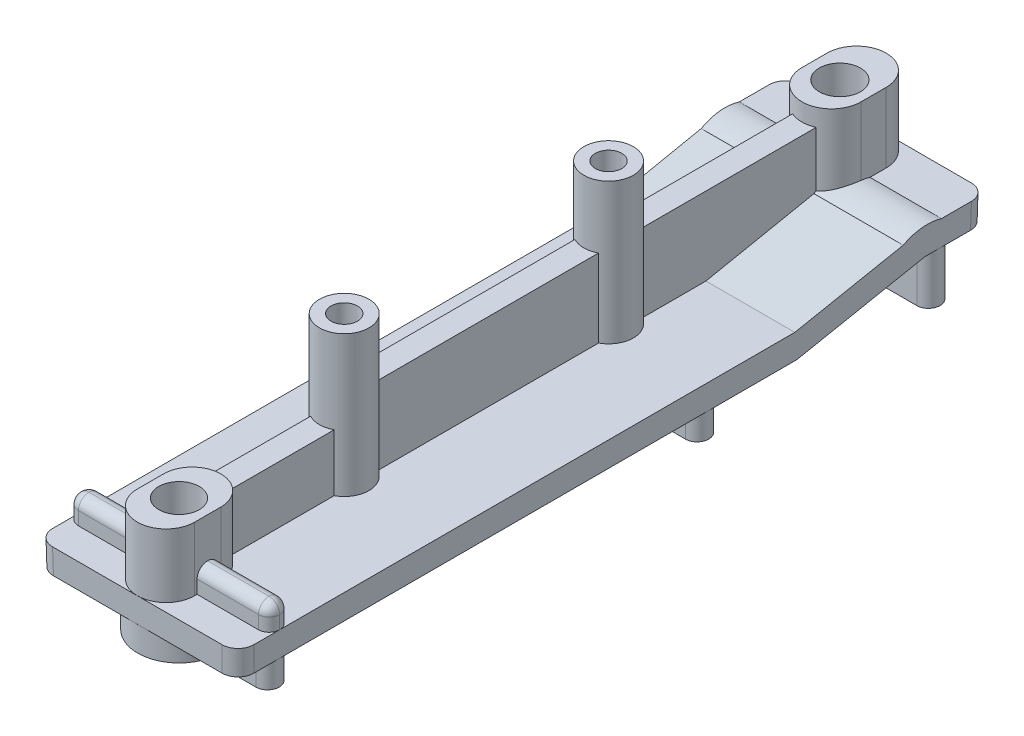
ISO-10303-21;
HEADER;
FILE_DESCRIPTION(('STEP AP214'),'2;1');
FILE_NAME('part.step','',(''),(''),'','','');
FILE_SCHEMA(('AUTOMOTIVE_DESIGN { 1 0 10303 214 1 1 1 1 }'));
ENDSEC;
DATA;
#1=APPLICATION_CONTEXT('core data for automotive mechanical design processes');
#2=APPLICATION_PROTOCOL_DEFINITION('international standard','automotive_design',2000,#1);
#3=PRODUCT_CONTEXT('',#1,'mechanical');
#4=PRODUCT('Part','Part','',(#3));
#5=PRODUCT_RELATED_PRODUCT_CATEGORY('part','',(#4));
#6=PRODUCT_DEFINITION_FORMATION('','',#4);
#7=PRODUCT_DEFINITION_CONTEXT('part definition',#1,'design');
#8=PRODUCT_DEFINITION('design','',#6,#7);
#9=PRODUCT_DEFINITION_SHAPE('','',#8);
#10=(LENGTH_UNIT() NAMED_UNIT(*) SI_UNIT(.MILLI.,.METRE.));
#11=(NAMED_UNIT(*) PLANE_ANGLE_UNIT() SI_UNIT($,.RADIAN.));
#12=(NAMED_UNIT(*) SI_UNIT($,.STERADIAN.) SOLID_ANGLE_UNIT());
#13=UNCERTAINTY_MEASURE_WITH_UNIT(LENGTH_MEASURE(1.E-05),#10,'distance_accuracy_value','');
#14=(GEOMETRIC_REPRESENTATION_CONTEXT(3) GLOBAL_UNCERTAINTY_ASSIGNED_CONTEXT((#13)) GLOBAL_UNIT_ASSIGNED_CONTEXT((#10,
#11,#12)) REPRESENTATION_CONTEXT('',''));
#15=CARTESIAN_POINT('',(0.,0.,0.));
#16=DIRECTION('',(0.,0.,1.));
#17=DIRECTION('',(1.,0.,0.));
#18=AXIS2_PLACEMENT_3D('',#15,#16,#17);
#19=CARTESIAN_POINT('',(9.6266,0.,0.));
#20=DIRECTION('',(0.,-1.,0.));
#21=DIRECTION('',(0.,0.,-1.));
#22=AXIS2_PLACEMENT_3D('',#19,#20,#21);
#23=PLANE('',#22);
#24=DIRECTION('',(-1.,0.,0.));
#25=VECTOR('',#24,1.);
#26=CARTESIAN_POINT('',(-9.66871907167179,0.,-4.9784));
#27=LINE('',#26,#25);
#28=CARTESIAN_POINT('',(-2.7559,0.,-4.9784));
#29=VERTEX_POINT('',#28);
#30=CARTESIAN_POINT('',(-8.65271907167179,0.,-4.9784));
#31=VERTEX_POINT('',#30);
#32=EDGE_CURVE('E116',#29,#31,#27,.T.);
#33=ORIENTED_EDGE('',*,*,#32,.F.);
#34=DIRECTION('',(0.,0.,-1.));
#35=VECTOR('',#34,1.);
#36=CARTESIAN_POINT('',(-2.7559,0.,-5.22838092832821));
#37=LINE('',#36,#35);
#38=CARTESIAN_POINT('',(-2.7559,0.,-5.22838092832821));
#39=VERTEX_POINT('',#38);
#40=EDGE_CURVE('E705',#29,#39,#37,.T.);
#41=ORIENTED_EDGE('',*,*,#40,.T.);
#42=CARTESIAN_POINT('',(0.,0.,-5.22838092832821));
#43=DIRECTION('',(0.,-1.,0.));
#44=DIRECTION('',(0.,0.,-1.));
#45=AXIS2_PLACEMENT_3D('',#42,#43,#44);
#46=CIRCLE('',#45,2.7559);
#47=CARTESIAN_POINT('',(-1.1303,0.,-7.74182611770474));
#48=VERTEX_POINT('',#47);
#49=EDGE_CURVE('E706',#39,#48,#46,.T.);
#50=ORIENTED_EDGE('',*,*,#49,.T.);
#51=DIRECTION('',(0.,0.,-1.));
#52=VECTOR('',#51,1.);
#53=CARTESIAN_POINT('',(-1.1303,0.,-1.48188092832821));
#54=LINE('',#53,#52);
#55=CARTESIAN_POINT('',(-1.1303,0.,-17.7415055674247));
#56=VERTEX_POINT('',#55);
#57=EDGE_CURVE('E665',#48,#56,#54,.T.);
#58=ORIENTED_EDGE('',*,*,#57,.T.);
#59=CARTESIAN_POINT('',(0.,0.,-19.8374));
#60=DIRECTION('',(0.,-1.,0.));
#61=DIRECTION('',(0.,0.,-1.));
#62=AXIS2_PLACEMENT_3D('',#59,#60,#61);
#63=CIRCLE('',#62,2.38125);
#64=CARTESIAN_POINT('',(-1.13029999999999,0.,-21.9332944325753));
#65=VERTEX_POINT('',#64);
#66=EDGE_CURVE('E836',#56,#65,#63,.T.);
#67=ORIENTED_EDGE('',*,*,#66,.T.);
#68=DIRECTION('',(0.,0.,1.));
#69=VECTOR('',#68,1.);
#70=CARTESIAN_POINT('',(-1.1303,0.,-70.3923248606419));
#71=LINE('',#70,#69);
#72=CARTESIAN_POINT('',(-1.1303,0.,-43.1415055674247));
#73=VERTEX_POINT('',#72);
#74=EDGE_CURVE('E642',#73,#65,#71,.T.);
#75=ORIENTED_EDGE('',*,*,#74,.F.);
#76=CARTESIAN_POINT('',(0.,0.,-45.2374));
#77=DIRECTION('',(0.,-1.,0.));
#78=DIRECTION('',(0.,0.,-1.));
#79=AXIS2_PLACEMENT_3D('',#76,#77,#78);
#80=CIRCLE('',#79,2.38125);
#81=CARTESIAN_POINT('',(-1.1303,0.,-47.3332944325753));
#82=VERTEX_POINT('',#81);
#83=EDGE_CURVE('E210',#82,#73,#80,.F.);
#84=ORIENTED_EDGE('',*,*,#83,.F.);
#85=CARTESIAN_POINT('',(-1.1303,4.9737991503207E-11,-53.4670000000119));
#86=VERTEX_POINT('',#85);
#87=EDGE_CURVE('E638',#86,#82,#71,.T.);
#88=ORIENTED_EDGE('',*,*,#87,.F.);
#89=DIRECTION('',(-1.,0.,0.));
#90=VECTOR('',#89,1.);
#91=CARTESIAN_POINT('',(9.6266,0.,-53.467));
#92=LINE('',#91,#90);
#93=CARTESIAN_POINT('',(-9.66871907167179,0.,-53.467));
#94=VERTEX_POINT('',#93);
#95=EDGE_CURVE('E341',#86,#94,#92,.T.);
#96=ORIENTED_EDGE('',*,*,#95,.T.);
#97=DIRECTION('',(0.,0.,-1.));
#98=VECTOR('',#97,1.);
#99=CARTESIAN_POINT('',(-9.66871907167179,0.,0.));
#100=LINE('',#99,#98);
#101=CARTESIAN_POINT('',(-9.66871907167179,0.,-3.9624));
#102=VERTEX_POINT('',#101);
#103=EDGE_CURVE('E342',#94,#102,#100,.F.);
#104=ORIENTED_EDGE('',*,*,#103,.T.);
#105=CARTESIAN_POINT('',(-8.65271907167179,0.,-3.9624));
#106=DIRECTION('',(0.,-1.,0.));
#107=DIRECTION('',(0.,0.,-1.));
#108=AXIS2_PLACEMENT_3D('',#105,#106,#107);
#109=CIRCLE('',#108,1.016);
#110=EDGE_CURVE('E86',#102,#31,#109,.T.);
#111=ORIENTED_EDGE('',*,*,#110,.T.);
#112=EDGE_LOOP('',(#33,#41,#50,#58,#67,#75,#84,#88,#96,#104,#111));
#113=FACE_BOUND('',#112,.T.);
#114=ADVANCED_FACE('F35',(#113),#23,.F.);
#115=DIRECTION('',(1.,0.,0.));
#116=VECTOR('',#115,1.);
#117=CARTESIAN_POINT('',(-9.66871907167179,0.,-2.9464));
#118=LINE('',#117,#116);
#119=CARTESIAN_POINT('',(-8.65271907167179,0.,-2.9464));
#120=VERTEX_POINT('',#119);
#121=CARTESIAN_POINT('',(-2.7559,0.,-2.9464));
#122=VERTEX_POINT('',#121);
#123=EDGE_CURVE('E869',#120,#122,#118,.T.);
#124=ORIENTED_EDGE('',*,*,#123,.F.);
#125=CARTESIAN_POINT('',(-8.65271907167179,0.,-3.9624));
#126=DIRECTION('',(0.,-1.,0.));
#127=DIRECTION('',(0.,0.,-1.));
#128=AXIS2_PLACEMENT_3D('',#125,#126,#127);
#129=CIRCLE('',#128,1.016);
#130=EDGE_CURVE('E137',#120,#102,#129,.T.);
#131=ORIENTED_EDGE('',*,*,#130,.T.);
#132=CARTESIAN_POINT('',(-9.66871907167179,0.,-1.48164881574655));
#133=VERTEX_POINT('',#132);
#134=EDGE_CURVE('E345',#102,#133,#100,.F.);
#135=ORIENTED_EDGE('',*,*,#134,.T.);
#136=CARTESIAN_POINT('',(-8.14448692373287,0.,-1.48211307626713));
#137=DIRECTION('',(0.,-1.,0.));
#138=DIRECTION('',(0.707106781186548,0.,-0.707106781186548));
#139=AXIS2_PLACEMENT_3D('',#136,#137,#138);
#140=ELLIPSE('',#139,1.52446426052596,1.524);
#141=CARTESIAN_POINT('',(-8.14495118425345,0.,0.0421190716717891));
#142=VERTEX_POINT('',#141);
#143=EDGE_CURVE('E228',#133,#142,#140,.F.);
#144=ORIENTED_EDGE('',*,*,#143,.T.);
#145=DIRECTION('',(1.,0.,0.));
#146=VECTOR('',#145,1.);
#147=CARTESIAN_POINT('',(9.6266,0.,0.0421190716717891));
#148=LINE('',#147,#146);
#149=CARTESIAN_POINT('',(0.,0.,0.0421190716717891));
#150=VERTEX_POINT('',#149);
#151=EDGE_CURVE('E337',#150,#142,#148,.F.);
#152=ORIENTED_EDGE('',*,*,#151,.F.);
#153=CARTESIAN_POINT('',(0.,0.,-2.71378092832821));
#154=DIRECTION('',(0.,-1.,0.));
#155=DIRECTION('',(0.,0.,-1.));
#156=AXIS2_PLACEMENT_3D('',#153,#154,#155);
#157=CIRCLE('',#156,2.7559);
#158=CARTESIAN_POINT('',(-2.7559,0.,-2.71378092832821));
#159=VERTEX_POINT('',#158);
#160=EDGE_CURVE('E713',#150,#159,#157,.T.);
#161=ORIENTED_EDGE('',*,*,#160,.T.);
#162=EDGE_CURVE('E701',#159,#122,#37,.T.);
#163=ORIENTED_EDGE('',*,*,#162,.T.);
#164=EDGE_LOOP('',(#124,#131,#135,#144,#152,#161,#163));
#165=FACE_BOUND('',#164,.T.);
#166=ADVANCED_FACE('F973',(#165),#23,.F.);
#167=CARTESIAN_POINT('',(8.65271907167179,0.,-4.9784));
#168=VERTEX_POINT('',#167);
#169=CARTESIAN_POINT('',(2.7559,0.,-4.9784));
#170=VERTEX_POINT('',#169);
#171=EDGE_CURVE('E875',#168,#170,#27,.T.);
#172=ORIENTED_EDGE('',*,*,#171,.F.);
#173=CARTESIAN_POINT('',(8.65271907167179,0.,-3.9624));
#174=DIRECTION('',(0.,-1.,0.));
#175=DIRECTION('',(0.,0.,-1.));
#176=AXIS2_PLACEMENT_3D('',#173,#174,#175);
#177=CIRCLE('',#176,1.016);
#178=CARTESIAN_POINT('',(9.66871907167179,0.,-3.9624));
#179=VERTEX_POINT('',#178);
#180=EDGE_CURVE('E45',#168,#179,#177,.T.);
#181=ORIENTED_EDGE('',*,*,#180,.T.);
#182=DIRECTION('',(0.,0.,1.));
#183=VECTOR('',#182,1.);
#184=CARTESIAN_POINT('',(9.66871907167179,0.,0.));
#185=LINE('',#184,#183);
#186=CARTESIAN_POINT('',(9.66871907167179,0.,-53.467));
#187=VERTEX_POINT('',#186);
#188=EDGE_CURVE('E335',#187,#179,#185,.T.);
#189=ORIENTED_EDGE('',*,*,#188,.F.);
#190=CARTESIAN_POINT('',(1.1303,4.9737991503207E-11,-53.4670000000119));
#191=VERTEX_POINT('',#190);
#192=EDGE_CURVE('E364',#187,#191,#92,.T.);
#193=ORIENTED_EDGE('',*,*,#192,.T.);
#194=DIRECTION('',(0.,0.,1.));
#195=VECTOR('',#194,1.);
#196=CARTESIAN_POINT('',(1.1303,0.,-70.3923248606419));
#197=LINE('',#196,#195);
#198=CARTESIAN_POINT('',(1.1303,0.,-47.3332944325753));
#199=VERTEX_POINT('',#198);
#200=EDGE_CURVE('E650',#191,#199,#197,.T.);
#201=ORIENTED_EDGE('',*,*,#200,.T.);
#202=CARTESIAN_POINT('',(0.,0.,-45.2374));
#203=DIRECTION('',(0.,-1.,0.));
#204=DIRECTION('',(0.,0.,-1.));
#205=AXIS2_PLACEMENT_3D('',#202,#203,#204);
#206=CIRCLE('',#205,2.38125);
#207=CARTESIAN_POINT('',(1.1303,0.,-43.1415055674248));
#208=VERTEX_POINT('',#207);
#209=EDGE_CURVE('E812',#199,#208,#206,.T.);
#210=ORIENTED_EDGE('',*,*,#209,.T.);
#211=CARTESIAN_POINT('',(1.13030000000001,0.,-21.9332944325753));
#212=VERTEX_POINT('',#211);
#213=EDGE_CURVE('E641',#208,#212,#197,.T.);
#214=ORIENTED_EDGE('',*,*,#213,.T.);
#215=CARTESIAN_POINT('',(1.1303,0.,-17.7415055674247));
#216=VERTEX_POINT('',#215);
#217=EDGE_CURVE('E833',#212,#216,#63,.T.);
#218=ORIENTED_EDGE('',*,*,#217,.T.);
#219=DIRECTION('',(0.,0.,-1.));
#220=VECTOR('',#219,1.);
#221=CARTESIAN_POINT('',(1.1303,0.,-1.48188092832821));
#222=LINE('',#221,#220);
#223=CARTESIAN_POINT('',(1.1303,0.,-7.74182611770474));
#224=VERTEX_POINT('',#223);
#225=EDGE_CURVE('E668',#224,#216,#222,.T.);
#226=ORIENTED_EDGE('',*,*,#225,.F.);
#227=CARTESIAN_POINT('',(2.7559,0.,-5.22838092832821));
#228=VERTEX_POINT('',#227);
#229=EDGE_CURVE('E704',#224,#228,#46,.T.);
#230=ORIENTED_EDGE('',*,*,#229,.T.);
#231=DIRECTION('',(0.,0.,1.));
#232=VECTOR('',#231,1.);
#233=CARTESIAN_POINT('',(2.7559,0.,-5.22838092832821));
#234=LINE('',#233,#232);
#235=EDGE_CURVE('E710',#228,#170,#234,.T.);
#236=ORIENTED_EDGE('',*,*,#235,.T.);
#237=EDGE_LOOP('',(#172,#181,#189,#193,#201,#210,#214,#218,#226,#230,#236));
#238=FACE_BOUND('',#237,.T.);
#239=ADVANCED_FACE('F1001',(#238),#23,.F.);
#240=CARTESIAN_POINT('',(2.7559,0.,-2.9464));
#241=VERTEX_POINT('',#240);
#242=CARTESIAN_POINT('',(8.65271907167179,0.,-2.9464));
#243=VERTEX_POINT('',#242);
#244=EDGE_CURVE('E874',#241,#243,#118,.T.);
#245=ORIENTED_EDGE('',*,*,#244,.F.);
#246=CARTESIAN_POINT('',(2.7559,0.,-2.71378092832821));
#247=VERTEX_POINT('',#246);
#248=EDGE_CURVE('E709',#241,#247,#234,.T.);
#249=ORIENTED_EDGE('',*,*,#248,.T.);
#250=EDGE_CURVE('E683',#247,#150,#157,.T.);
#251=ORIENTED_EDGE('',*,*,#250,.T.);
#252=CARTESIAN_POINT('',(8.14495118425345,0.,0.0421190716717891));
#253=VERTEX_POINT('',#252);
#254=EDGE_CURVE('E338',#253,#150,#148,.F.);
#255=ORIENTED_EDGE('',*,*,#254,.F.);
#256=CARTESIAN_POINT('',(8.14448692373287,0.,-1.48211307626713));
#257=DIRECTION('',(0.,-1.,0.));
#258=DIRECTION('',(-0.707106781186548,0.,-0.707106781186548));
#259=AXIS2_PLACEMENT_3D('',#256,#257,#258);
#260=ELLIPSE('',#259,1.52446426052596,1.524);
#261=CARTESIAN_POINT('',(9.66871907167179,0.,-1.48164881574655));
#262=VERTEX_POINT('',#261);
#263=EDGE_CURVE('E248',#253,#262,#260,.F.);
#264=ORIENTED_EDGE('',*,*,#263,.T.);
#265=EDGE_CURVE('E53',#179,#262,#185,.T.);
#266=ORIENTED_EDGE('',*,*,#265,.F.);
#267=CARTESIAN_POINT('',(8.65271907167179,0.,-3.9624));
#268=DIRECTION('',(0.,-1.,0.));
#269=DIRECTION('',(0.,0.,-1.));
#270=AXIS2_PLACEMENT_3D('',#267,#268,#269);
#271=CIRCLE('',#270,1.016);
#272=EDGE_CURVE('E11',#179,#243,#271,.T.);
#273=ORIENTED_EDGE('',*,*,#272,.T.);
#274=EDGE_LOOP('',(#245,#249,#251,#255,#264,#266,#273));
#275=FACE_BOUND('',#274,.T.);
#276=ADVANCED_FACE('F997',(#275),#23,.F.);
#277=CARTESIAN_POINT('',(2.7559,-9.73668507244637,-5.22838092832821));
#278=DIRECTION('',(-1.,0.,0.));
#279=DIRECTION('',(0.,0.,1.));
#280=AXIS2_PLACEMENT_3D('',#277,#278,#279);
#281=PLANE('',#280);
#282=DIRECTION('',(0.,1.,0.));
#283=VECTOR('',#282,1.);
#284=CARTESIAN_POINT('',(2.7559,-9.73668507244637,-4.9784));
#285=LINE('',#284,#283);
#286=CARTESIAN_POINT('',(2.7559,1.27,-4.9784));
#287=VERTEX_POINT('',#286);
#288=EDGE_CURVE('E854',#170,#287,#285,.T.);
#289=ORIENTED_EDGE('',*,*,#288,.F.);
#290=ORIENTED_EDGE('',*,*,#235,.F.);
#291=DIRECTION('',(0.,1.,0.));
#292=VECTOR('',#291,1.);
#293=CARTESIAN_POINT('',(2.7559,-9.73668507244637,-5.22838092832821));
#294=LINE('',#293,#292);
#295=CARTESIAN_POINT('',(2.7559,6.12775,-5.22838092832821));
#296=VERTEX_POINT('',#295);
#297=EDGE_CURVE('E698',#228,#296,#294,.T.);
#298=ORIENTED_EDGE('',*,*,#297,.T.);
#299=DIRECTION('',(0.,0.,1.));
#300=VECTOR('',#299,1.);
#301=CARTESIAN_POINT('',(2.7559,6.12775,-5.22838092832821));
#302=LINE('',#301,#300);
#303=CARTESIAN_POINT('',(2.7559,6.12775,-2.71378092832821));
#304=VERTEX_POINT('',#303);
#305=EDGE_CURVE('E697',#296,#304,#302,.T.);
#306=ORIENTED_EDGE('',*,*,#305,.T.);
#307=DIRECTION('',(0.,1.,0.));
#308=VECTOR('',#307,1.);
#309=CARTESIAN_POINT('',(2.7559,-9.73668507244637,-2.71378092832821));
#310=LINE('',#309,#308);
#311=EDGE_CURVE('E694',#247,#304,#310,.T.);
#312=ORIENTED_EDGE('',*,*,#311,.F.);
#313=ORIENTED_EDGE('',*,*,#248,.F.);
#314=DIRECTION('',(0.,-1.,0.));
#315=VECTOR('',#314,1.);
#316=CARTESIAN_POINT('',(2.7559,-9.73668507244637,-2.9464));
#317=LINE('',#316,#315);
#318=CARTESIAN_POINT('',(2.7559,1.27,-2.9464));
#319=VERTEX_POINT('',#318);
#320=EDGE_CURVE('E862',#319,#241,#317,.T.);
#321=ORIENTED_EDGE('',*,*,#320,.F.);
#322=CARTESIAN_POINT('',(2.7559,1.27,-3.9624));
#323=DIRECTION('',(-1.,0.,0.));
#324=DIRECTION('',(0.,0.,1.));
#325=AXIS2_PLACEMENT_3D('',#322,#323,#324);
#326=CIRCLE('',#325,1.016);
#327=CARTESIAN_POINT('',(2.7559,2.286,-3.9624));
#328=VERTEX_POINT('',#327);
#329=EDGE_CURVE('E149',#319,#328,#326,.T.);
#330=ORIENTED_EDGE('',*,*,#329,.T.);
#331=CARTESIAN_POINT('',(2.7559,1.27,-3.9624));
#332=DIRECTION('',(-1.,0.,0.));
#333=DIRECTION('',(0.,0.,1.));
#334=AXIS2_PLACEMENT_3D('',#331,#332,#333);
#335=CIRCLE('',#334,1.016);
#336=EDGE_CURVE('E146',#328,#287,#335,.T.);
#337=ORIENTED_EDGE('',*,*,#336,.T.);
#338=EDGE_LOOP('',(#289,#290,#298,#306,#312,#313,#321,#330,#337));
#339=FACE_BOUND('',#338,.T.);
#340=ADVANCED_FACE('F1005',(#339),#281,.F.);
#341=CARTESIAN_POINT('',(-2.7559,-9.73668507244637,-5.22838092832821));
#342=DIRECTION('',(1.,0.,0.));
#343=DIRECTION('',(0.,0.,-1.));
#344=AXIS2_PLACEMENT_3D('',#341,#342,#343);
#345=PLANE('',#344);
#346=DIRECTION('',(0.,-1.,0.));
#347=VECTOR('',#346,1.);
#348=CARTESIAN_POINT('',(-2.7559,-9.73668507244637,-4.9784));
#349=LINE('',#348,#347);
#350=CARTESIAN_POINT('',(-2.7559,1.27,-4.9784));
#351=VERTEX_POINT('',#350);
#352=EDGE_CURVE('E859',#351,#29,#349,.T.);
#353=ORIENTED_EDGE('',*,*,#352,.F.);
#354=CARTESIAN_POINT('',(-2.7559,1.27,-3.9624));
#355=DIRECTION('',(1.,0.,0.));
#356=DIRECTION('',(0.,0.,-1.));
#357=AXIS2_PLACEMENT_3D('',#354,#355,#356);
#358=CIRCLE('',#357,1.016);
#359=CARTESIAN_POINT('',(-2.7559,2.286,-3.9624));
#360=VERTEX_POINT('',#359);
#361=EDGE_CURVE('E141',#351,#360,#358,.T.);
#362=ORIENTED_EDGE('',*,*,#361,.T.);
#363=CARTESIAN_POINT('',(-2.7559,1.27,-3.9624));
#364=DIRECTION('',(1.,0.,0.));
#365=DIRECTION('',(0.,0.,-1.));
#366=AXIS2_PLACEMENT_3D('',#363,#364,#365);
#367=CIRCLE('',#366,1.016);
#368=CARTESIAN_POINT('',(-2.7559,1.27,-2.9464));
#369=VERTEX_POINT('',#368);
#370=EDGE_CURVE('E143',#360,#369,#367,.T.);
#371=ORIENTED_EDGE('',*,*,#370,.T.);
#372=DIRECTION('',(0.,1.,0.));
#373=VECTOR('',#372,1.);
#374=CARTESIAN_POINT('',(-2.7559,-9.73668507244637,-2.9464));
#375=LINE('',#374,#373);
#376=EDGE_CURVE('E865',#122,#369,#375,.T.);
#377=ORIENTED_EDGE('',*,*,#376,.F.);
#378=ORIENTED_EDGE('',*,*,#162,.F.);
#379=DIRECTION('',(0.,1.,0.));
#380=VECTOR('',#379,1.);
#381=CARTESIAN_POINT('',(-2.7559,-9.73668507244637,-2.71378092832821));
#382=LINE('',#381,#380);
#383=CARTESIAN_POINT('',(-2.7559,6.12775,-2.71378092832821));
#384=VERTEX_POINT('',#383);
#385=EDGE_CURVE('E689',#159,#384,#382,.T.);
#386=ORIENTED_EDGE('',*,*,#385,.T.);
#387=DIRECTION('',(0.,0.,-1.));
#388=VECTOR('',#387,1.);
#389=CARTESIAN_POINT('',(-2.7559,6.12775,-5.22838092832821));
#390=LINE('',#389,#388);
#391=CARTESIAN_POINT('',(-2.7559,6.12775,-5.22838092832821));
#392=VERTEX_POINT('',#391);
#393=EDGE_CURVE('E692',#384,#392,#390,.T.);
#394=ORIENTED_EDGE('',*,*,#393,.T.);
#395=DIRECTION('',(0.,1.,0.));
#396=VECTOR('',#395,1.);
#397=CARTESIAN_POINT('',(-2.7559,-9.73668507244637,-5.22838092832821));
#398=LINE('',#397,#396);
#399=EDGE_CURVE('E684',#39,#392,#398,.T.);
#400=ORIENTED_EDGE('',*,*,#399,.F.);
#401=ORIENTED_EDGE('',*,*,#40,.F.);
#402=EDGE_LOOP('',(#353,#362,#371,#377,#378,#386,#394,#400,#401));
#403=FACE_BOUND('',#402,.T.);
#404=ADVANCED_FACE('F982',(#403),#345,.F.);
#405=CARTESIAN_POINT('',(0.,13.54455,-3.9624));
#406=DIRECTION('',(0.,-1.,0.));
#407=DIRECTION('',(0.,0.,-1.));
#408=AXIS2_PLACEMENT_3D('',#405,#406,#407);
#409=CYLINDRICAL_SURFACE('',#408,1.9431);
#410=CARTESIAN_POINT('',(0.,2.286,-3.9624));
#411=DIRECTION('',(0.,-1.,0.));
#412=DIRECTION('',(0.,0.,-1.));
#413=AXIS2_PLACEMENT_3D('',#410,#411,#412);
#414=CIRCLE('',#413,1.9431);
#415=CARTESIAN_POINT('',(1.65631567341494,2.286,-2.9464));
#416=VERTEX_POINT('',#415);
#417=CARTESIAN_POINT('',(1.65631567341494,2.286,-4.9784));
#418=VERTEX_POINT('',#417);
#419=EDGE_CURVE('E181',#416,#418,#414,.F.);
#420=ORIENTED_EDGE('',*,*,#419,.F.);
#421=DIRECTION('',(0.,-1.,0.));
#422=VECTOR('',#421,1.);
#423=CARTESIAN_POINT('',(1.65631567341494,13.54455,-2.9464));
#424=LINE('',#423,#422);
#425=CARTESIAN_POINT('',(1.65631567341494,0.,-2.9464));
#426=VERTEX_POINT('',#425);
#427=EDGE_CURVE('E187',#426,#416,#424,.F.);
#428=ORIENTED_EDGE('',*,*,#427,.F.);
#429=CARTESIAN_POINT('',(0.,0.,-3.9624));
#430=DIRECTION('',(0.,-1.,0.));
#431=DIRECTION('',(0.,0.,-1.));
#432=AXIS2_PLACEMENT_3D('',#429,#430,#431);
#433=CIRCLE('',#432,1.9431);
#434=CARTESIAN_POINT('',(1.65631567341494,0.,-4.9784));
#435=VERTEX_POINT('',#434);
#436=EDGE_CURVE('E190',#426,#435,#433,.F.);
#437=ORIENTED_EDGE('',*,*,#436,.T.);
#438=DIRECTION('',(0.,-1.,0.));
#439=VECTOR('',#438,1.);
#440=CARTESIAN_POINT('',(1.65631567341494,13.54455,-4.9784));
#441=LINE('',#440,#439);
#442=EDGE_CURVE('E184',#418,#435,#441,.T.);
#443=ORIENTED_EDGE('',*,*,#442,.F.);
#444=EDGE_LOOP('',(#420,#428,#437,#443));
#445=FACE_BOUND('',#444,.T.);
#446=CARTESIAN_POINT('',(0.,-4.79425,-3.9624));
#447=DIRECTION('',(0.,-1.,0.));
#448=DIRECTION('',(0.,0.,-1.));
#449=AXIS2_PLACEMENT_3D('',#446,#447,#448);
#450=CIRCLE('',#449,1.9431);
#451=CARTESIAN_POINT('',(0.,-4.79425,-5.9055));
#452=VERTEX_POINT('',#451);
#453=EDGE_CURVE('E202',#452,#452,#450,.T.);
#454=ORIENTED_EDGE('',*,*,#453,.T.);
#455=EDGE_LOOP('',(#454));
#456=FACE_BOUND('',#455,.T.);
#457=CARTESIAN_POINT('',(0.,6.12775,-3.9624));
#458=DIRECTION('',(0.,-1.,0.));
#459=DIRECTION('',(0.,0.,-1.));
#460=AXIS2_PLACEMENT_3D('',#457,#458,#459);
#461=CIRCLE('',#460,1.9431);
#462=CARTESIAN_POINT('',(0.,6.12775,-5.9055));
#463=VERTEX_POINT('',#462);
#464=EDGE_CURVE('E204',#463,#463,#461,.T.);
#465=ORIENTED_EDGE('',*,*,#464,.F.);
#466=EDGE_LOOP('',(#465));
#467=FACE_BOUND('',#466,.T.);
#468=CARTESIAN_POINT('',(-1.65631567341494,2.286,-4.9784));
#469=VERTEX_POINT('',#468);
#470=CARTESIAN_POINT('',(-1.65631567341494,2.286,-2.9464));
#471=VERTEX_POINT('',#470);
#472=EDGE_CURVE('E173',#469,#471,#414,.F.);
#473=ORIENTED_EDGE('',*,*,#472,.F.);
#474=DIRECTION('',(0.,-1.,0.));
#475=VECTOR('',#474,1.);
#476=CARTESIAN_POINT('',(-1.65631567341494,13.54455,-4.9784));
#477=LINE('',#476,#475);
#478=CARTESIAN_POINT('',(-1.65631567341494,0.,-4.9784));
#479=VERTEX_POINT('',#478);
#480=EDGE_CURVE('E174',#479,#469,#477,.F.);
#481=ORIENTED_EDGE('',*,*,#480,.F.);
#482=CARTESIAN_POINT('',(-1.65631567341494,0.,-2.9464));
#483=VERTEX_POINT('',#482);
#484=EDGE_CURVE('E180',#479,#483,#433,.F.);
#485=ORIENTED_EDGE('',*,*,#484,.T.);
#486=DIRECTION('',(0.,-1.,0.));
#487=VECTOR('',#486,1.);
#488=CARTESIAN_POINT('',(-1.65631567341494,13.54455,-2.9464));
#489=LINE('',#488,#487);
#490=EDGE_CURVE('E177',#471,#483,#489,.T.);
#491=ORIENTED_EDGE('',*,*,#490,.F.);
#492=EDGE_LOOP('',(#473,#481,#485,#491));
#493=FACE_BOUND('',#492,.T.);
#494=ADVANCED_FACE('F898',(#445,#456,#467,#493),#409,.F.);
#495=CARTESIAN_POINT('',(1.1303,-500000.,-70.3923248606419));
#496=DIRECTION('',(-1.,0.,0.));
#497=DIRECTION('',(0.,0.,1.));
#498=AXIS2_PLACEMENT_3D('',#495,#496,#497);
#499=PLANE('',#498);
#500=DIRECTION('',(0.,1.,0.));
#501=VECTOR('',#500,1.);
#502=CARTESIAN_POINT('',(1.13030000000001,-6.73519209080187,-21.9332944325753));
#503=LINE('',#502,#501);
#504=CARTESIAN_POINT('',(1.13030000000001,7.493,-21.9332944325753));
#505=VERTEX_POINT('',#504);
#506=EDGE_CURVE('E818',#212,#505,#503,.T.);
#507=ORIENTED_EDGE('',*,*,#506,.F.);
#508=ORIENTED_EDGE('',*,*,#213,.F.);
#509=DIRECTION('',(0.,1.,0.));
#510=VECTOR('',#509,1.);
#511=CARTESIAN_POINT('',(1.1303,-6.73519209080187,-43.1415055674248));
#512=LINE('',#511,#510);
#513=CARTESIAN_POINT('',(1.1303,7.493,-43.1415055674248));
#514=VERTEX_POINT('',#513);
#515=EDGE_CURVE('E728',#514,#208,#512,.F.);
#516=ORIENTED_EDGE('',*,*,#515,.F.);
#517=DIRECTION('',(0.,0.,1.));
#518=VECTOR('',#517,1.);
#519=CARTESIAN_POINT('',(1.1303,7.493,-70.3923248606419));
#520=LINE('',#519,#518);
#521=EDGE_CURVE('E661',#514,#505,#520,.T.);
#522=ORIENTED_EDGE('',*,*,#521,.T.);
#523=EDGE_LOOP('',(#507,#508,#516,#522));
#524=FACE_BOUND('',#523,.T.);
#525=ADVANCED_FACE('F1366',(#524),#499,.F.);
#526=CARTESIAN_POINT('',(0.,7.493,0.));
#527=DIRECTION('',(0.,-1.,0.));
#528=DIRECTION('',(-1.,0.,0.));
#529=AXIS2_PLACEMENT_3D('',#526,#527,#528);
#530=PLANE('',#529);
#531=CARTESIAN_POINT('',(0.,7.493,-19.8374));
#532=DIRECTION('',(0.,-1.,0.));
#533=DIRECTION('',(0.,0.,-1.));
#534=AXIS2_PLACEMENT_3D('',#531,#532,#533);
#535=CIRCLE('',#534,2.38125);
#536=CARTESIAN_POINT('',(-1.13029999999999,7.493,-21.9332944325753));
#537=VERTEX_POINT('',#536);
#538=EDGE_CURVE('E821',#505,#537,#535,.F.);
#539=ORIENTED_EDGE('',*,*,#538,.F.);
#540=ORIENTED_EDGE('',*,*,#521,.F.);
#541=CARTESIAN_POINT('',(0.,7.493,-45.2374));
#542=DIRECTION('',(0.,-1.,0.));
#543=DIRECTION('',(0.,0.,-1.));
#544=AXIS2_PLACEMENT_3D('',#541,#542,#543);
#545=CIRCLE('',#544,2.38125);
#546=CARTESIAN_POINT('',(-1.1303,7.493,-43.1415055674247));
#547=VERTEX_POINT('',#546);
#548=EDGE_CURVE('E799',#547,#514,#545,.F.);
#549=ORIENTED_EDGE('',*,*,#548,.F.);
#550=DIRECTION('',(0.,0.,1.));
#551=VECTOR('',#550,1.);
#552=CARTESIAN_POINT('',(-1.1303,7.493,-70.3923248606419));
#553=LINE('',#552,#551);
#554=EDGE_CURVE('E662',#547,#537,#553,.T.);
#555=ORIENTED_EDGE('',*,*,#554,.T.);
#556=EDGE_LOOP('',(#539,#540,#549,#555));
#557=FACE_BOUND('',#556,.T.);
#558=ADVANCED_FACE('F1360',(#557),#530,.F.);
#559=CARTESIAN_POINT('',(-1.1303,-500000.,-70.3923248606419));
#560=DIRECTION('',(-1.,0.,0.));
#561=DIRECTION('',(0.,0.,1.));
#562=AXIS2_PLACEMENT_3D('',#559,#560,#561);
#563=PLANE('',#562);
#564=ORIENTED_EDGE('',*,*,#74,.T.);
#565=DIRECTION('',(0.,1.,0.));
#566=VECTOR('',#565,1.);
#567=CARTESIAN_POINT('',(-1.13029999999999,-6.73519209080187,-21.9332944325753));
#568=LINE('',#567,#566);
#569=EDGE_CURVE('E824',#65,#537,#568,.T.);
#570=ORIENTED_EDGE('',*,*,#569,.T.);
#571=ORIENTED_EDGE('',*,*,#554,.F.);
#572=DIRECTION('',(0.,1.,0.));
#573=VECTOR('',#572,1.);
#574=CARTESIAN_POINT('',(-1.1303,-6.73519209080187,-43.1415055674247));
#575=LINE('',#574,#573);
#576=EDGE_CURVE('E800',#547,#73,#575,.F.);
#577=ORIENTED_EDGE('',*,*,#576,.T.);
#578=EDGE_LOOP('',(#564,#570,#571,#577));
#579=FACE_BOUND('',#578,.T.);
#580=ADVANCED_FACE('F1694',(#579),#563,.T.);
#581=CARTESIAN_POINT('',(1.1303,-500000.,-1.48188092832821));
#582=DIRECTION('',(1.,0.,0.));
#583=DIRECTION('',(0.,0.,-1.));
#584=AXIS2_PLACEMENT_3D('',#581,#582,#583);
#585=PLANE('',#584);
#586=ORIENTED_EDGE('',*,*,#225,.T.);
#587=DIRECTION('',(0.,1.,0.));
#588=VECTOR('',#587,1.);
#589=CARTESIAN_POINT('',(1.1303,-6.73519209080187,-17.7415055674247));
#590=LINE('',#589,#588);
#591=CARTESIAN_POINT('',(1.1303,5.4864,-17.7415055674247));
#592=VERTEX_POINT('',#591);
#593=EDGE_CURVE('E827',#216,#592,#590,.T.);
#594=ORIENTED_EDGE('',*,*,#593,.T.);
#595=DIRECTION('',(0.,0.,-1.));
#596=VECTOR('',#595,1.);
#597=CARTESIAN_POINT('',(1.1303,5.4864,-1.48188092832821));
#598=LINE('',#597,#596);
#599=CARTESIAN_POINT('',(1.1303,5.4864,-7.74182611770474));
#600=VERTEX_POINT('',#599);
#601=EDGE_CURVE('E673',#600,#592,#598,.T.);
#602=ORIENTED_EDGE('',*,*,#601,.F.);
#603=DIRECTION('',(0.,1.,0.));
#604=VECTOR('',#603,1.);
#605=CARTESIAN_POINT('',(1.1303,-9.73668507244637,-7.74182611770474));
#606=LINE('',#605,#604);
#607=EDGE_CURVE('E669',#600,#224,#606,.F.);
#608=ORIENTED_EDGE('',*,*,#607,.T.);
#609=EDGE_LOOP('',(#586,#594,#602,#608));
#610=FACE_BOUND('',#609,.T.);
#611=ADVANCED_FACE('F1376',(#610),#585,.T.);
#612=CARTESIAN_POINT('',(-1.1303,-500000.,-1.48188092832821));
#613=DIRECTION('',(1.,0.,0.));
#614=DIRECTION('',(0.,0.,-1.));
#615=AXIS2_PLACEMENT_3D('',#612,#613,#614);
#616=PLANE('',#615);
#617=DIRECTION('',(0.,1.,0.));
#618=VECTOR('',#617,1.);
#619=CARTESIAN_POINT('',(-1.1303,-6.73519209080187,-17.7415055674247));
#620=LINE('',#619,#618);
#621=CARTESIAN_POINT('',(-1.1303,5.4864,-17.7415055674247));
#622=VERTEX_POINT('',#621);
#623=EDGE_CURVE('E830',#56,#622,#620,.T.);
#624=ORIENTED_EDGE('',*,*,#623,.F.);
#625=ORIENTED_EDGE('',*,*,#57,.F.);
#626=DIRECTION('',(0.,1.,0.));
#627=VECTOR('',#626,1.);
#628=CARTESIAN_POINT('',(-1.1303,-9.73668507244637,-7.74182611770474));
#629=LINE('',#628,#627);
#630=CARTESIAN_POINT('',(-1.1303,5.4864,-7.74182611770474));
#631=VERTEX_POINT('',#630);
#632=EDGE_CURVE('E680',#631,#48,#629,.F.);
#633=ORIENTED_EDGE('',*,*,#632,.F.);
#634=DIRECTION('',(0.,0.,-1.));
#635=VECTOR('',#634,1.);
#636=CARTESIAN_POINT('',(-1.1303,5.4864,-1.48188092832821));
#637=LINE('',#636,#635);
#638=EDGE_CURVE('E670',#631,#622,#637,.T.);
#639=ORIENTED_EDGE('',*,*,#638,.T.);
#640=EDGE_LOOP('',(#624,#625,#633,#639));
#641=FACE_BOUND('',#640,.T.);
#642=ADVANCED_FACE('F1712',(#641),#616,.F.);
#643=CARTESIAN_POINT('',(0.,5.4864,0.));
#644=DIRECTION('',(0.,-1.,0.));
#645=DIRECTION('',(-1.,0.,0.));
#646=AXIS2_PLACEMENT_3D('',#643,#644,#645);
#647=PLANE('',#646);
#648=CARTESIAN_POINT('',(0.,5.4864,-19.8374));
#649=DIRECTION('',(0.,-1.,0.));
#650=DIRECTION('',(0.,0.,-1.));
#651=AXIS2_PLACEMENT_3D('',#648,#649,#650);
#652=CIRCLE('',#651,2.38125);
#653=EDGE_CURVE('E193',#622,#592,#652,.F.);
#654=ORIENTED_EDGE('',*,*,#653,.F.);
#655=ORIENTED_EDGE('',*,*,#638,.F.);
#656=CARTESIAN_POINT('',(0.,5.4864,-5.22838092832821));
#657=DIRECTION('',(0.,-1.,0.));
#658=DIRECTION('',(0.,0.,-1.));
#659=AXIS2_PLACEMENT_3D('',#656,#657,#658);
#660=CIRCLE('',#659,2.7559);
#661=EDGE_CURVE('E213',#600,#631,#660,.F.);
#662=ORIENTED_EDGE('',*,*,#661,.F.);
#663=ORIENTED_EDGE('',*,*,#601,.T.);
#664=EDGE_LOOP('',(#654,#655,#662,#663));
#665=FACE_BOUND('',#664,.T.);
#666=ADVANCED_FACE('F1720',(#665),#647,.F.);
#667=DIRECTION('',(0.,1.,0.));
#668=VECTOR('',#667,1.);
#669=CARTESIAN_POINT('',(1.1303,-6.73519209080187,-47.3332944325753));
#670=LINE('',#669,#668);
#671=CARTESIAN_POINT('',(1.1303,7.493,-47.3332944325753));
#672=VERTEX_POINT('',#671);
#673=EDGE_CURVE('E803',#199,#672,#670,.T.);
#674=ORIENTED_EDGE('',*,*,#673,.F.);
#675=ORIENTED_EDGE('',*,*,#200,.F.);
#676=DIRECTION('',(0.,-0.196896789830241,0.980424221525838));
#677=VECTOR('',#676,1.);
#678=CARTESIAN_POINT('',(1.13030000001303,-19380.9056177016,96451.4547871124));
#679=LINE('',#678,#677);
#680=CARTESIAN_POINT('',(1.1303,2.08366312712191,-63.8423535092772));
#681=VERTEX_POINT('',#680);
#682=EDGE_CURVE('E653',#681,#191,#679,.T.);
#683=ORIENTED_EDGE('',*,*,#682,.F.);
#684=CARTESIAN_POINT('',(1.1303,-2.09402898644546,-66.1289));
#685=DIRECTION('',(-1.,0.,0.));
#686=DIRECTION('',(0.,0.,1.));
#687=AXIS2_PLACEMENT_3D('',#684,#685,#686);
#688=CIRCLE('',#687,4.7625);
#689=CARTESIAN_POINT('',(1.1303,2.1897646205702,-64.0479101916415));
#690=VERTEX_POINT('',#689);
#691=EDGE_CURVE('E637',#690,#681,#688,.F.);
#692=ORIENTED_EDGE('',*,*,#691,.F.);
#693=DIRECTION('',(0.,1.,0.));
#694=VECTOR('',#693,1.);
#695=CARTESIAN_POINT('',(1.1303,-500000.,-64.0479101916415));
#696=LINE('',#695,#694);
#697=CARTESIAN_POINT('',(1.1303,7.49300000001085,-64.0479101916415));
#698=VERTEX_POINT('',#697);
#699=EDGE_CURVE('E741',#690,#698,#696,.T.);
#700=ORIENTED_EDGE('',*,*,#699,.T.);
#701=EDGE_CURVE('E649',#698,#672,#520,.T.);
#702=ORIENTED_EDGE('',*,*,#701,.T.);
#703=EDGE_LOOP('',(#674,#675,#683,#692,#700,#702));
#704=FACE_BOUND('',#703,.T.);
#705=ADVANCED_FACE('F1686',(#704),#499,.F.);
#706=CARTESIAN_POINT('',(-1.1303,7.493,-47.3332944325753));
#707=VERTEX_POINT('',#706);
#708=EDGE_CURVE('E806',#672,#707,#545,.F.);
#709=ORIENTED_EDGE('',*,*,#708,.F.);
#710=ORIENTED_EDGE('',*,*,#701,.F.);
#711=CARTESIAN_POINT('',(0.,7.49300000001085,-66.6585248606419));
#712=DIRECTION('',(0.,-1.,0.));
#713=DIRECTION('',(0.,0.,-1.));
#714=AXIS2_PLACEMENT_3D('',#711,#712,#713);
#715=CIRCLE('',#714,2.8448);
#716=CARTESIAN_POINT('',(-1.1303,7.49300000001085,-64.0479101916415));
#717=VERTEX_POINT('',#716);
#718=EDGE_CURVE('E752',#698,#717,#715,.T.);
#719=ORIENTED_EDGE('',*,*,#718,.T.);
#720=EDGE_CURVE('E658',#717,#707,#553,.T.);
#721=ORIENTED_EDGE('',*,*,#720,.T.);
#722=EDGE_LOOP('',(#709,#710,#719,#721));
#723=FACE_BOUND('',#722,.T.);
#724=ADVANCED_FACE('F1696',(#723),#530,.F.);
#725=ORIENTED_EDGE('',*,*,#87,.T.);
#726=DIRECTION('',(0.,1.,0.));
#727=VECTOR('',#726,1.);
#728=CARTESIAN_POINT('',(-1.1303,-6.73519209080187,-47.3332944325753));
#729=LINE('',#728,#727);
#730=EDGE_CURVE('E809',#82,#707,#729,.T.);
#731=ORIENTED_EDGE('',*,*,#730,.T.);
#732=ORIENTED_EDGE('',*,*,#720,.F.);
#733=DIRECTION('',(0.,1.,0.));
#734=VECTOR('',#733,1.);
#735=CARTESIAN_POINT('',(-1.1303,-500000.,-64.0479101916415));
#736=LINE('',#735,#734);
#737=CARTESIAN_POINT('',(-1.1303,2.18976462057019,-64.0479101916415));
#738=VERTEX_POINT('',#737);
#739=EDGE_CURVE('E771',#738,#717,#736,.T.);
#740=ORIENTED_EDGE('',*,*,#739,.F.);
#741=CARTESIAN_POINT('',(-1.1303,-2.09402898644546,-66.1289));
#742=DIRECTION('',(-1.,0.,0.));
#743=DIRECTION('',(0.,0.,1.));
#744=AXIS2_PLACEMENT_3D('',#741,#742,#743);
#745=CIRCLE('',#744,4.7625);
#746=CARTESIAN_POINT('',(-1.1303,2.08366312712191,-63.8423535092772));
#747=VERTEX_POINT('',#746);
#748=EDGE_CURVE('E646',#738,#747,#745,.F.);
#749=ORIENTED_EDGE('',*,*,#748,.T.);
#750=DIRECTION('',(0.,-0.196896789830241,0.980424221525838));
#751=VECTOR('',#750,1.);
#752=CARTESIAN_POINT('',(-1.13029999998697,-19380.9056177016,96451.4547871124));
#753=LINE('',#752,#751);
#754=EDGE_CURVE('E643',#747,#86,#753,.T.);
#755=ORIENTED_EDGE('',*,*,#754,.T.);
#756=EDGE_LOOP('',(#725,#731,#732,#740,#749,#755));
#757=FACE_BOUND('',#756,.T.);
#758=ADVANCED_FACE('F1705',(#757),#563,.T.);
#759=CARTESIAN_POINT('',(9.6266,2.4638,-65.7352));
#760=DIRECTION('',(0.,-1.,0.));
#761=DIRECTION('',(0.,0.,-1.));
#762=AXIS2_PLACEMENT_3D('',#759,#760,#761);
#763=PLANE('',#762);
#764=DIRECTION('',(0.,0.,-1.));
#765=VECTOR('',#764,1.);
#766=CARTESIAN_POINT('',(-2.8448,2.4637999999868,-66.6585248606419));
#767=LINE('',#766,#765);
#768=CARTESIAN_POINT('',(-2.8448,2.4637999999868,-67.5100593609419));
#769=VERTEX_POINT('',#768);
#770=CARTESIAN_POINT('',(-2.8448,2.4637999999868,-69.0715248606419));
#771=VERTEX_POINT('',#770);
#772=EDGE_CURVE('E735',#769,#771,#767,.T.);
#773=ORIENTED_EDGE('',*,*,#772,.T.);
#774=CARTESIAN_POINT('',(0.,2.4637999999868,-69.0715248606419));
#775=DIRECTION('',(0.,-1.,0.));
#776=DIRECTION('',(0.,0.,-1.));
#777=AXIS2_PLACEMENT_3D('',#774,#775,#776);
#778=CIRCLE('',#777,2.8448);
#779=CARTESIAN_POINT('',(0.,2.4637999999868,-71.9163248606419));
#780=VERTEX_POINT('',#779);
#781=EDGE_CURVE('E731',#771,#780,#778,.T.);
#782=ORIENTED_EDGE('',*,*,#781,.T.);
#783=DIRECTION('',(1.,0.,0.));
#784=VECTOR('',#783,1.);
#785=CARTESIAN_POINT('',(9.6266,2.4638,-71.9163248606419));
#786=LINE('',#785,#784);
#787=CARTESIAN_POINT('',(-8.18795697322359,2.4638,-71.9163248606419));
#788=VERTEX_POINT('',#787);
#789=EDGE_CURVE('E356',#780,#788,#786,.F.);
#790=ORIENTED_EDGE('',*,*,#789,.T.);
#791=CARTESIAN_POINT('',(-8.18749271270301,2.4638,-70.392092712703));
#792=DIRECTION('',(0.,-1.,0.));
#793=DIRECTION('',(-0.707106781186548,0.,-0.707106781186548));
#794=AXIS2_PLACEMENT_3D('',#791,#792,#793);
#795=ELLIPSE('',#794,1.52446426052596,1.524);
#796=CARTESIAN_POINT('',(-9.71172486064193,2.4638,-70.3925569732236));
#797=VERTEX_POINT('',#796);
#798=EDGE_CURVE('E280',#788,#797,#795,.F.);
#799=ORIENTED_EDGE('',*,*,#798,.T.);
#800=DIRECTION('',(0.,0.,-1.));
#801=VECTOR('',#800,1.);
#802=CARTESIAN_POINT('',(-9.71172486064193,2.4638,-65.7352));
#803=LINE('',#802,#801);
#804=CARTESIAN_POINT('',(-9.71172486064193,2.4638,-67.5100593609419));
#805=VERTEX_POINT('',#804);
#806=EDGE_CURVE('E296',#797,#805,#803,.F.);
#807=ORIENTED_EDGE('',*,*,#806,.T.);
#808=DIRECTION('',(-1.,0.,0.));
#809=VECTOR('',#808,1.);
#810=CARTESIAN_POINT('',(9.6266,2.4638,-67.5100593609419));
#811=LINE('',#810,#809);
#812=EDGE_CURVE('E370',#769,#805,#811,.T.);
#813=ORIENTED_EDGE('',*,*,#812,.F.);
#814=EDGE_LOOP('',(#773,#782,#790,#799,#807,#813));
#815=FACE_BOUND('',#814,.T.);
#816=ADVANCED_FACE('F1750',(#815),#763,.F.);
#817=CARTESIAN_POINT('',(2.8448,2.4637999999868,-69.0715248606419));
#818=VERTEX_POINT('',#817);
#819=EDGE_CURVE('E734',#780,#818,#778,.T.);
#820=ORIENTED_EDGE('',*,*,#819,.T.);
#821=DIRECTION('',(0.,0.,1.));
#822=VECTOR('',#821,1.);
#823=CARTESIAN_POINT('',(2.8448,2.4637999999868,-66.6585248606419));
#824=LINE('',#823,#822);
#825=CARTESIAN_POINT('',(2.8448,2.4637999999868,-67.5100593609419));
#826=VERTEX_POINT('',#825);
#827=EDGE_CURVE('E724',#818,#826,#824,.T.);
#828=ORIENTED_EDGE('',*,*,#827,.T.);
#829=CARTESIAN_POINT('',(9.71172486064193,2.4638,-67.5100593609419));
#830=VERTEX_POINT('',#829);
#831=EDGE_CURVE('E367',#830,#826,#811,.T.);
#832=ORIENTED_EDGE('',*,*,#831,.F.);
#833=DIRECTION('',(0.,0.,1.));
#834=VECTOR('',#833,1.);
#835=CARTESIAN_POINT('',(9.71172486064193,2.4638,-65.7352));
#836=LINE('',#835,#834);
#837=CARTESIAN_POINT('',(9.71172486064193,2.4638,-70.3925569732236));
#838=VERTEX_POINT('',#837);
#839=EDGE_CURVE('E319',#838,#830,#836,.T.);
#840=ORIENTED_EDGE('',*,*,#839,.F.);
#841=CARTESIAN_POINT('',(8.18749271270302,2.4638,-70.392092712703));
#842=DIRECTION('',(0.,-1.,0.));
#843=DIRECTION('',(0.707106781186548,0.,-0.707106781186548));
#844=AXIS2_PLACEMENT_3D('',#841,#842,#843);
#845=ELLIPSE('',#844,1.52446426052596,1.524);
#846=CARTESIAN_POINT('',(8.18795697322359,2.4638,-71.9163248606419));
#847=VERTEX_POINT('',#846);
#848=EDGE_CURVE('E283',#838,#847,#845,.F.);
#849=ORIENTED_EDGE('',*,*,#848,.T.);
#850=EDGE_CURVE('E324',#847,#780,#786,.F.);
#851=ORIENTED_EDGE('',*,*,#850,.T.);
#852=EDGE_LOOP('',(#820,#828,#832,#840,#849,#851));
#853=FACE_BOUND('',#852,.T.);
#854=ADVANCED_FACE('F1796',(#853),#763,.F.);
#855=CARTESIAN_POINT('',(9.6266,-2.09402898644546,-66.1289));
#856=DIRECTION('',(-1.,0.,0.));
#857=DIRECTION('',(0.,0.,1.));
#858=AXIS2_PLACEMENT_3D('',#855,#856,#857);
#859=CYLINDRICAL_SURFACE('',#858,4.7625);
#860=CARTESIAN_POINT('',(2.8448,2.63893031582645,-66.6585248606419));
#861=CARTESIAN_POINT('',(2.84481268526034,2.64688841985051,-66.5875305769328));
#862=CARTESIAN_POINT('',(2.84214264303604,2.65322201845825,-66.5163569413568));
#863=CARTESIAN_POINT('',(2.83145117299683,2.66267822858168,-66.3742172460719));
#864=CARTESIAN_POINT('',(2.82343115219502,2.66580168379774,-66.3032511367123));
#865=CARTESIAN_POINT('',(2.80210402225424,2.6688725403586,-66.1623866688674));
#866=CARTESIAN_POINT('',(2.78882193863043,2.6688347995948,-66.0924848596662));
#867=CARTESIAN_POINT('',(2.75708560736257,2.66576182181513,-65.9539517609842));
#868=CARTESIAN_POINT('',(2.73863129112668,2.66272654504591,-65.8853204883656));
#869=CARTESIAN_POINT('',(2.67574605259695,2.64940463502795,-65.6821506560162));
#870=CARTESIAN_POINT('',(2.62376133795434,2.63490536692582,-65.5501300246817));
#871=CARTESIAN_POINT('',(2.50142836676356,2.59689070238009,-65.2962965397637));
#872=CARTESIAN_POINT('',(2.43106091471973,2.57336586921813,-65.1744945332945));
#873=CARTESIAN_POINT('',(2.27016011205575,2.51880742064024,-64.9378532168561));
#874=CARTESIAN_POINT('',(2.17881252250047,2.48746429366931,-64.8236405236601));
#875=CARTESIAN_POINT('',(1.98033840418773,2.42148057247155,-64.6110115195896));
#876=CARTESIAN_POINT('',(1.87321134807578,2.38683986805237,-64.5125957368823));
#877=CARTESIAN_POINT('',(1.66328491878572,2.32346288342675,-64.3474065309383));
#878=CARTESIAN_POINT('',(1.56249592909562,2.29466186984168,-64.2780901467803));
#879=CARTESIAN_POINT('',(1.35246472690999,2.2396874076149,-64.1528002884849));
#880=CARTESIAN_POINT('',(1.24323284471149,2.21351083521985,-64.0968108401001));
#881=CARTESIAN_POINT('',(1.1303,2.1897646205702,-64.0479101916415));
#882=B_SPLINE_CURVE_WITH_KNOTS('',3,(#860,#861,#862,#863,#864,#865,#866,#867,#868,#869,#870,
#871,#872,#873,#874,#875,#876,#877,#878,#879,#880,#881),.UNSPECIFIED.,.F.,.F.,(4,2,2,2,2,2,2,2,
2,2,4),(0.,0.214243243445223,0.428430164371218,0.641610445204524,0.854793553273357,
1.28054242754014,1.7067376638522,2.15365818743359,2.60059365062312,2.9766137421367,
3.35218082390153),.UNSPECIFIED.);
#883=CARTESIAN_POINT('',(2.8448,2.63893031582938,-66.6585248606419));
#884=VERTEX_POINT('',#883);
#885=EDGE_CURVE('E744',#884,#690,#882,.T.);
#886=ORIENTED_EDGE('',*,*,#885,.T.);
#887=ORIENTED_EDGE('',*,*,#691,.T.);
#888=DIRECTION('',(-1.,0.,0.));
#889=VECTOR('',#888,1.);
#890=CARTESIAN_POINT('',(9.6266,2.08366312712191,-63.8423535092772));
#891=LINE('',#890,#889);
#892=CARTESIAN_POINT('',(9.70508954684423,2.08366312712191,-63.8423535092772));
#893=VERTEX_POINT('',#892);
#894=EDGE_CURVE('E371',#893,#681,#891,.T.);
#895=ORIENTED_EDGE('',*,*,#894,.F.);
#896=CARTESIAN_POINT('',(9.63216765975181,-2.09402898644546,-66.1289));
#897=DIRECTION('',(0.999847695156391,-0.0174524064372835,0.));
#898=DIRECTION('',(-0.0174524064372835,-0.999847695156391,0.));
#899=AXIS2_PLACEMENT_3D('',#896,#897,#898);
#900=ELLIPSE('',#899,4.76322546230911,4.7625);
#901=EDGE_CURVE('E328',#830,#893,#900,.T.);
#902=ORIENTED_EDGE('',*,*,#901,.F.);
#903=ORIENTED_EDGE('',*,*,#831,.T.);
#904=CARTESIAN_POINT('',(2.8448,-2.09402898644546,-66.1289));
#905=DIRECTION('',(-1.,0.,0.));
#906=DIRECTION('',(0.,0.,1.));
#907=AXIS2_PLACEMENT_3D('',#904,#905,#906);
#908=CIRCLE('',#907,4.7625);
#909=EDGE_CURVE('E727',#826,#884,#908,.F.);
#910=ORIENTED_EDGE('',*,*,#909,.T.);
#911=EDGE_LOOP('',(#886,#887,#895,#902,#903,#910));
#912=FACE_BOUND('',#911,.T.);
#913=ADVANCED_FACE('F1806',(#912),#859,.T.);
#914=CARTESIAN_POINT('',(-2.8448,-2.09402898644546,-66.1289));
#915=DIRECTION('',(1.,0.,0.));
#916=DIRECTION('',(0.,0.,-1.));
#917=AXIS2_PLACEMENT_3D('',#914,#915,#916);
#918=CIRCLE('',#917,4.7625);
#919=CARTESIAN_POINT('',(-2.8448,2.63893031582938,-66.6585248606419));
#920=VERTEX_POINT('',#919);
#921=EDGE_CURVE('E738',#920,#769,#918,.F.);
#922=ORIENTED_EDGE('',*,*,#921,.T.);
#923=ORIENTED_EDGE('',*,*,#812,.T.);
#924=CARTESIAN_POINT('',(-9.63216765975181,-2.09402898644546,-66.1289));
#925=DIRECTION('',(-0.999847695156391,-0.0174524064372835,0.));
#926=DIRECTION('',(-0.0174524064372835,0.999847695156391,0.));
#927=AXIS2_PLACEMENT_3D('',#924,#925,#926);
#928=ELLIPSE('',#927,4.76322546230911,4.7625);
#929=CARTESIAN_POINT('',(-9.70508954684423,2.08366312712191,-63.8423535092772));
#930=VERTEX_POINT('',#929);
#931=EDGE_CURVE('E332',#805,#930,#928,.F.);
#932=ORIENTED_EDGE('',*,*,#931,.T.);
#933=EDGE_CURVE('E331',#747,#930,#891,.T.);
#934=ORIENTED_EDGE('',*,*,#933,.F.);
#935=ORIENTED_EDGE('',*,*,#748,.F.);
#936=CARTESIAN_POINT('',(-1.1303,2.1897646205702,-64.0479101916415));
#937=CARTESIAN_POINT('',(-1.28048121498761,2.22135252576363,-64.1129351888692));
#938=CARTESIAN_POINT('',(-1.42411522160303,2.25722250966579,-64.1905039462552));
#939=CARTESIAN_POINT('',(-1.69582532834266,2.33228657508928,-64.3686555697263));
#940=CARTESIAN_POINT('',(-1.82386901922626,2.37148730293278,-64.4692851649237));
#941=CARTESIAN_POINT('',(-2.06126879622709,2.44779058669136,-64.6911731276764));
#942=CARTESIAN_POINT('',(-2.17062953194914,2.48489366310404,-64.8124263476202));
#943=CARTESIAN_POINT('',(-2.36776217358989,2.5519331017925,-65.0732170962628));
#944=CARTESIAN_POINT('',(-2.45555121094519,2.58187515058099,-65.2127399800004));
#945=CARTESIAN_POINT('',(-2.56748328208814,2.6175830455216,-65.4307738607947));
#946=CARTESIAN_POINT('',(-2.6011513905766,2.62786601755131,-65.5037976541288));
#947=CARTESIAN_POINT('',(-2.66228713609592,2.64520022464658,-65.6527514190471));
#948=CARTESIAN_POINT('',(-2.68975809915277,2.65225319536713,-65.7286798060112));
#949=CARTESIAN_POINT('',(-2.7381621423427,2.66273024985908,-65.8827234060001));
#950=CARTESIAN_POINT('',(-2.75910385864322,2.66615914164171,-65.9608355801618));
#951=CARTESIAN_POINT('',(-2.79425990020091,2.66911264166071,-66.1185958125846));
#952=CARTESIAN_POINT('',(-2.80847815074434,2.6686395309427,-66.1982429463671));
#953=CARTESIAN_POINT('',(-2.82779519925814,2.66414476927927,-66.3414652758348));
#954=CARTESIAN_POINT('',(-2.83418355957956,2.66089096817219,-66.4048948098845));
#955=CARTESIAN_POINT('',(-2.84268668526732,2.65182823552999,-66.5317704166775));
#956=CARTESIAN_POINT('',(-2.84480725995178,2.64602279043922,-66.595216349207));
#957=CARTESIAN_POINT('',(-2.8448,2.63893031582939,-66.658524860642));
#958=B_SPLINE_CURVE_WITH_KNOTS('',3,(#936,#937,#938,#939,#940,#941,#942,#943,#944,#945,#946,
#947,#948,#949,#950,#951,#952,#953,#954,#955,#956,#957),.UNSPECIFIED.,.F.,.F.,(4,2,2,2,2,2,2,2,
2,2,4),(0.,0.499140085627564,0.999300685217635,1.49933662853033,1.99897416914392,
2.24188336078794,2.48466187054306,2.72711788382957,2.9694321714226,3.16074457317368,
3.35179638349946),.UNSPECIFIED.);
#959=EDGE_CURVE('E765',#738,#920,#958,.T.);
#960=ORIENTED_EDGE('',*,*,#959,.T.);
#961=EDGE_LOOP('',(#922,#923,#932,#934,#935,#960));
#962=FACE_BOUND('',#961,.T.);
#963=ADVANCED_FACE('F1814',(#962),#859,.T.);
#964=CARTESIAN_POINT('',(9.6266,0.,-53.467));
#965=DIRECTION('',(0.,-0.980424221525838,-0.196896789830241));
#966=DIRECTION('',(0.,0.196896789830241,-0.980424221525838));
#967=AXIS2_PLACEMENT_3D('',#964,#965,#966);
#968=PLANE('',#967);
#969=ORIENTED_EDGE('',*,*,#682,.T.);
#970=ORIENTED_EDGE('',*,*,#192,.F.);
#971=DIRECTION('',(-0.0034368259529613,-0.19689562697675,0.980418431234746));
#972=VECTOR('',#971,1.);
#973=CARTESIAN_POINT('',(9.66871857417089,-2.85018073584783E-05,-53.4668580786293));
#974=LINE('',#973,#972);
#975=EDGE_CURVE('E327',#893,#187,#974,.T.);
#976=ORIENTED_EDGE('',*,*,#975,.F.);
#977=ORIENTED_EDGE('',*,*,#894,.T.);
#978=EDGE_LOOP('',(#969,#970,#976,#977));
#979=FACE_BOUND('',#978,.T.);
#980=ADVANCED_FACE('F1822',(#979),#968,.F.);
#981=CARTESIAN_POINT('',(9.6266,-2.413,0.));
#982=DIRECTION('',(0.,1.,0.));
#983=DIRECTION('',(0.,0.,1.));
#984=AXIS2_PLACEMENT_3D('',#981,#982,#983);
#985=PLANE('',#984);
#986=DIRECTION('',(-1.,0.,0.));
#987=VECTOR('',#986,1.);
#988=CARTESIAN_POINT('',(-8.509,-2.413,-44.1198));
#989=LINE('',#988,#987);
#990=CARTESIAN_POINT('',(-3.808142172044,-2.413,-44.1198));
#991=VERTEX_POINT('',#990);
#992=CARTESIAN_POINT('',(-8.509,-2.413,-44.1198));
#993=VERTEX_POINT('',#992);
#994=EDGE_CURVE('E542',#991,#993,#989,.T.);
#995=ORIENTED_EDGE('',*,*,#994,.F.);
#996=CARTESIAN_POINT('',(0.,-2.413,-45.2374));
#997=DIRECTION('',(0.,1.,0.));
#998=DIRECTION('',(0.,0.,1.));
#999=AXIS2_PLACEMENT_3D('',#996,#997,#998);
#1000=CIRCLE('',#999,3.96875);
#1001=CARTESIAN_POINT('',(-1.1303,-2.41299999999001,-41.4330080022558));
#1002=VERTEX_POINT('',#1001);
#1003=EDGE_CURVE('E537',#1002,#991,#1000,.F.);
#1004=ORIENTED_EDGE('',*,*,#1003,.F.);
#1005=DIRECTION('',(0.,0.,-1.));
#1006=VECTOR('',#1005,1.);
#1007=CARTESIAN_POINT('',(-1.1303,-2.41299999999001,-1.524));
#1008=LINE('',#1007,#1006);
#1009=CARTESIAN_POINT('',(-1.1303,-2.41299999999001,-7.76679199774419));
#1010=VERTEX_POINT('',#1009);
#1011=EDGE_CURVE('E238',#1010,#1002,#1008,.T.);
#1012=ORIENTED_EDGE('',*,*,#1011,.F.);
#1013=CARTESIAN_POINT('',(0.,-2.413,-3.9624));
#1014=DIRECTION('',(0.,1.,0.));
#1015=DIRECTION('',(0.,0.,1.));
#1016=AXIS2_PLACEMENT_3D('',#1013,#1014,#1015);
#1017=CIRCLE('',#1016,3.96875);
#1018=CARTESIAN_POINT('',(-3.808142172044,-2.413,-5.08));
#1019=VERTEX_POINT('',#1018);
#1020=EDGE_CURVE('E418',#1019,#1010,#1017,.F.);
#1021=ORIENTED_EDGE('',*,*,#1020,.F.);
#1022=DIRECTION('',(1.,0.,0.));
#1023=VECTOR('',#1022,1.);
#1024=CARTESIAN_POINT('',(-8.509,-2.413,-5.08));
#1025=LINE('',#1024,#1023);
#1026=CARTESIAN_POINT('',(-8.509,-2.413,-5.08));
#1027=VERTEX_POINT('',#1026);
#1028=EDGE_CURVE('E408',#1027,#1019,#1025,.T.);
#1029=ORIENTED_EDGE('',*,*,#1028,.F.);
#1030=CARTESIAN_POINT('',(-8.509,-2.413,-3.9624));
#1031=DIRECTION('',(0.,1.,0.));
#1032=DIRECTION('',(0.,0.,1.));
#1033=AXIS2_PLACEMENT_3D('',#1030,#1031,#1032);
#1034=CIRCLE('',#1033,1.1176);
#1035=CARTESIAN_POINT('',(-9.6266,-2.41299999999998,-3.9624));
#1036=VERTEX_POINT('',#1035);
#1037=EDGE_CURVE('E404',#1036,#1027,#1034,.F.);
#1038=ORIENTED_EDGE('',*,*,#1037,.F.);
#1039=DIRECTION('',(0.,0.,1.));
#1040=VECTOR('',#1039,1.);
#1041=CARTESIAN_POINT('',(-9.6266,-2.413,0.));
#1042=LINE('',#1041,#1040);
#1043=CARTESIAN_POINT('',(-9.6266,-2.41299999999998,-45.2374));
#1044=VERTEX_POINT('',#1043);
#1045=EDGE_CURVE('E303',#1036,#1044,#1042,.F.);
#1046=ORIENTED_EDGE('',*,*,#1045,.T.);
#1047=CARTESIAN_POINT('',(-8.509,-2.413,-45.2374));
#1048=DIRECTION('',(0.,1.,0.));
#1049=DIRECTION('',(0.,0.,1.));
#1050=AXIS2_PLACEMENT_3D('',#1047,#1048,#1049);
#1051=CIRCLE('',#1050,1.1176);
#1052=EDGE_CURVE('E552',#993,#1044,#1051,.F.);
#1053=ORIENTED_EDGE('',*,*,#1052,.F.);
#1054=EDGE_LOOP('',(#995,#1004,#1012,#1021,#1029,#1038,#1046,#1053));
#1055=FACE_BOUND('',#1054,.T.);
#1056=ADVANCED_FACE('F1853',(#1055),#985,.F.);
#1057=DIRECTION('',(0.,0.,-1.));
#1058=VECTOR('',#1057,1.);
#1059=CARTESIAN_POINT('',(1.1303,-2.41299999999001,-1.524));
#1060=LINE('',#1059,#1058);
#1061=CARTESIAN_POINT('',(1.1303,-2.41299999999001,-7.76679199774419));
#1062=VERTEX_POINT('',#1061);
#1063=CARTESIAN_POINT('',(1.1303,-2.41299999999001,-41.4330080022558));
#1064=VERTEX_POINT('',#1063);
#1065=EDGE_CURVE('E351',#1062,#1064,#1060,.T.);
#1066=ORIENTED_EDGE('',*,*,#1065,.T.);
#1067=CARTESIAN_POINT('',(3.808142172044,-2.413,-44.1198));
#1068=VERTEX_POINT('',#1067);
#1069=EDGE_CURVE('E543',#1068,#1064,#1000,.F.);
#1070=ORIENTED_EDGE('',*,*,#1069,.F.);
#1071=DIRECTION('',(-1.,0.,0.));
#1072=VECTOR('',#1071,1.);
#1073=CARTESIAN_POINT('',(8.509,-2.413,-44.1198));
#1074=LINE('',#1073,#1072);
#1075=CARTESIAN_POINT('',(8.509,-2.413,-44.1198));
#1076=VERTEX_POINT('',#1075);
#1077=EDGE_CURVE('E538',#1076,#1068,#1074,.T.);
#1078=ORIENTED_EDGE('',*,*,#1077,.F.);
#1079=CARTESIAN_POINT('',(8.509,-2.413,-45.2374));
#1080=DIRECTION('',(0.,1.,0.));
#1081=DIRECTION('',(0.,0.,1.));
#1082=AXIS2_PLACEMENT_3D('',#1079,#1080,#1081);
#1083=CIRCLE('',#1082,1.1176);
#1084=CARTESIAN_POINT('',(9.6266,-2.41299999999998,-45.2374));
#1085=VERTEX_POINT('',#1084);
#1086=EDGE_CURVE('E565',#1085,#1076,#1083,.F.);
#1087=ORIENTED_EDGE('',*,*,#1086,.F.);
#1088=DIRECTION('',(0.,0.,-1.));
#1089=VECTOR('',#1088,1.);
#1090=CARTESIAN_POINT('',(9.6266,-2.413,0.));
#1091=LINE('',#1090,#1089);
#1092=CARTESIAN_POINT('',(9.6266,-2.41299999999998,-3.9624));
#1093=VERTEX_POINT('',#1092);
#1094=EDGE_CURVE('E312',#1093,#1085,#1091,.T.);
#1095=ORIENTED_EDGE('',*,*,#1094,.F.);
#1096=CARTESIAN_POINT('',(8.509,-2.413,-3.9624));
#1097=DIRECTION('',(0.,1.,0.));
#1098=DIRECTION('',(0.,0.,1.));
#1099=AXIS2_PLACEMENT_3D('',#1096,#1097,#1098);
#1100=CIRCLE('',#1099,1.1176);
#1101=CARTESIAN_POINT('',(8.509,-2.413,-5.08));
#1102=VERTEX_POINT('',#1101);
#1103=EDGE_CURVE('E390',#1102,#1093,#1100,.F.);
#1104=ORIENTED_EDGE('',*,*,#1103,.F.);
#1105=DIRECTION('',(1.,0.,0.));
#1106=VECTOR('',#1105,1.);
#1107=CARTESIAN_POINT('',(8.509,-2.413,-5.08));
#1108=LINE('',#1107,#1106);
#1109=CARTESIAN_POINT('',(3.808142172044,-2.413,-5.08));
#1110=VERTEX_POINT('',#1109);
#1111=EDGE_CURVE('E417',#1110,#1102,#1108,.T.);
#1112=ORIENTED_EDGE('',*,*,#1111,.F.);
#1113=EDGE_CURVE('E413',#1062,#1110,#1017,.F.);
#1114=ORIENTED_EDGE('',*,*,#1113,.F.);
#1115=EDGE_LOOP('',(#1066,#1070,#1078,#1087,#1095,#1104,#1112,#1114));
#1116=FACE_BOUND('',#1115,.T.);
#1117=ADVANCED_FACE('F2108',(#1116),#985,.F.);
#1118=CARTESIAN_POINT('',(1.1303,-2.41299999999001,-1.524));
#1119=DIRECTION('',(0.999847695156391,-0.0174524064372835,0.));
#1120=DIRECTION('',(0.0174524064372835,0.999847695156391,0.));
#1121=AXIS2_PLACEMENT_3D('',#1118,#1119,#1120);
#1122=PLANE('',#1121);
#1123=DIRECTION('',(0.,0.,1.));
#1124=VECTOR('',#1123,1.);
#1125=CARTESIAN_POINT('',(1.10680199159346,-3.7592,-1.524));
#1126=LINE('',#1125,#1124);
#1127=CARTESIAN_POINT('',(1.10680199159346,-3.7592,-7.77369451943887));
#1128=VERTEX_POINT('',#1127);
#1129=CARTESIAN_POINT('',(1.10680199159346,-3.7592,-41.4261054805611));
#1130=VERTEX_POINT('',#1129);
#1131=EDGE_CURVE('E242',#1128,#1130,#1126,.F.);
#1132=ORIENTED_EDGE('',*,*,#1131,.T.);
#1133=CARTESIAN_POINT('',(0.,-67.1678436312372,-45.2374));
#1134=DIRECTION('',(0.999847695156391,-0.0174524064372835,0.));
#1135=DIRECTION('',(-0.0174524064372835,-0.999847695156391,0.));
#1136=AXIS2_PLACEMENT_3D('',#1133,#1134,#1135);
#1137=ELLIPSE('',#1136,227.404169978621,3.96875);
#1138=EDGE_CURVE('E499',#1130,#1064,#1137,.F.);
#1139=ORIENTED_EDGE('',*,*,#1138,.T.);
#1140=ORIENTED_EDGE('',*,*,#1065,.F.);
#1141=CARTESIAN_POINT('',(0.,-67.1678436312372,-3.9624));
#1142=DIRECTION('',(0.999847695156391,-0.0174524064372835,0.));
#1143=DIRECTION('',(-0.0174524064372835,-0.999847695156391,0.));
#1144=AXIS2_PLACEMENT_3D('',#1141,#1142,#1143);
#1145=ELLIPSE('',#1144,227.404169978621,3.96875);
#1146=EDGE_CURVE('E378',#1062,#1128,#1145,.F.);
#1147=ORIENTED_EDGE('',*,*,#1146,.T.);
#1148=EDGE_LOOP('',(#1132,#1139,#1140,#1147));
#1149=FACE_BOUND('',#1148,.T.);
#1150=ADVANCED_FACE('F2099',(#1149),#1122,.T.);
#1151=CARTESIAN_POINT('',(0.,-3.7592,0.));
#1152=DIRECTION('',(0.,1.,0.));
#1153=DIRECTION('',(1.,0.,0.));
#1154=AXIS2_PLACEMENT_3D('',#1151,#1152,#1153);
#1155=PLANE('',#1154);
#1156=DIRECTION('',(0.,0.,-1.));
#1157=VECTOR('',#1156,1.);
#1158=CARTESIAN_POINT('',(-1.10680199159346,-3.7592,-1.524));
#1159=LINE('',#1158,#1157);
#1160=CARTESIAN_POINT('',(-1.10680199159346,-3.7592,-7.77369451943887));
#1161=VERTEX_POINT('',#1160);
#1162=CARTESIAN_POINT('',(-1.10680199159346,-3.7592,-41.4261054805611));
#1163=VERTEX_POINT('',#1162);
#1164=EDGE_CURVE('E229',#1161,#1163,#1159,.T.);
#1165=ORIENTED_EDGE('',*,*,#1164,.T.);
#1166=CARTESIAN_POINT('',(0.,-3.7592,-45.2374));
#1167=DIRECTION('',(0.,1.,0.));
#1168=DIRECTION('',(0.,0.,1.));
#1169=AXIS2_PLACEMENT_3D('',#1166,#1167,#1168);
#1170=CIRCLE('',#1169,3.96875);
#1171=EDGE_CURVE('E521',#1163,#1130,#1170,.T.);
#1172=ORIENTED_EDGE('',*,*,#1171,.T.);
#1173=ORIENTED_EDGE('',*,*,#1131,.F.);
#1174=CARTESIAN_POINT('',(0.,-3.7592,-3.9624));
#1175=DIRECTION('',(0.,1.,0.));
#1176=DIRECTION('',(0.,0.,1.));
#1177=AXIS2_PLACEMENT_3D('',#1174,#1175,#1176);
#1178=CIRCLE('',#1177,3.96875);
#1179=EDGE_CURVE('E381',#1128,#1161,#1178,.T.);
#1180=ORIENTED_EDGE('',*,*,#1179,.T.);
#1181=EDGE_LOOP('',(#1165,#1172,#1173,#1180));
#1182=FACE_BOUND('',#1181,.T.);
#1183=ADVANCED_FACE('F2049',(#1182),#1155,.F.);
#1184=CARTESIAN_POINT('',(-1.1303,-2.41299999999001,-1.524));
#1185=DIRECTION('',(-0.999847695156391,-0.0174524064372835,0.));
#1186=DIRECTION('',(0.0174524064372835,-0.999847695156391,0.));
#1187=AXIS2_PLACEMENT_3D('',#1184,#1185,#1186);
#1188=PLANE('',#1187);
#1189=CARTESIAN_POINT('',(0.,-67.1678436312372,-45.2374));
#1190=DIRECTION('',(-0.999847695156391,-0.0174524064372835,0.));
#1191=DIRECTION('',(0.0174524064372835,-0.999847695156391,0.));
#1192=AXIS2_PLACEMENT_3D('',#1189,#1190,#1191);
#1193=ELLIPSE('',#1192,227.404169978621,3.96875);
#1194=EDGE_CURVE('E216',#1163,#1002,#1193,.T.);
#1195=ORIENTED_EDGE('',*,*,#1194,.F.);
#1196=ORIENTED_EDGE('',*,*,#1164,.F.);
#1197=CARTESIAN_POINT('',(0.,-67.1678436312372,-3.9624));
#1198=DIRECTION('',(-0.999847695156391,-0.0174524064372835,0.));
#1199=DIRECTION('',(0.0174524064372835,-0.999847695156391,0.));
#1200=AXIS2_PLACEMENT_3D('',#1197,#1198,#1199);
#1201=ELLIPSE('',#1200,227.404169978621,3.96875);
#1202=EDGE_CURVE('E225',#1010,#1161,#1201,.T.);
#1203=ORIENTED_EDGE('',*,*,#1202,.F.);
#1204=ORIENTED_EDGE('',*,*,#1011,.T.);
#1205=EDGE_LOOP('',(#1195,#1196,#1203,#1204));
#1206=FACE_BOUND('',#1205,.T.);
#1207=ADVANCED_FACE('F2085',(#1206),#1188,.T.);
#1208=DIRECTION('',(-1.,0.,0.));
#1209=VECTOR('',#1208,1.);
#1210=CARTESIAN_POINT('',(-8.509,-2.413,-2.8448));
#1211=LINE('',#1210,#1209);
#1212=CARTESIAN_POINT('',(-3.808142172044,-2.413,-2.8448));
#1213=VERTEX_POINT('',#1212);
#1214=CARTESIAN_POINT('',(-8.509,-2.413,-2.8448));
#1215=VERTEX_POINT('',#1214);
#1216=EDGE_CURVE('E399',#1213,#1215,#1211,.T.);
#1217=ORIENTED_EDGE('',*,*,#1216,.F.);
#1218=CARTESIAN_POINT('',(0.,-2.413,-3.9624));
#1219=DIRECTION('',(0.,1.,0.));
#1220=DIRECTION('',(0.,0.,1.));
#1221=AXIS2_PLACEMENT_3D('',#1218,#1219,#1220);
#1222=CIRCLE('',#1221,3.96875);
#1223=CARTESIAN_POINT('',(-0.224416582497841,-2.413,0.));
#1224=VERTEX_POINT('',#1223);
#1225=EDGE_CURVE('E394',#1224,#1213,#1222,.F.);
#1226=ORIENTED_EDGE('',*,*,#1225,.F.);
#1227=DIRECTION('',(1.,0.,0.));
#1228=VECTOR('',#1227,1.);
#1229=CARTESIAN_POINT('',(9.6266,-2.413,0.));
#1230=LINE('',#1229,#1228);
#1231=CARTESIAN_POINT('',(-8.10283211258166,-2.413,0.));
#1232=VERTEX_POINT('',#1231);
#1233=EDGE_CURVE('E307',#1224,#1232,#1230,.F.);
#1234=ORIENTED_EDGE('',*,*,#1233,.T.);
#1235=CARTESIAN_POINT('',(-8.10236785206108,-2.413,-1.52423214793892));
#1236=DIRECTION('',(0.,1.,0.));
#1237=DIRECTION('',(0.707106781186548,0.,-0.707106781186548));
#1238=AXIS2_PLACEMENT_3D('',#1235,#1236,#1237);
#1239=ELLIPSE('',#1238,1.52446426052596,1.524);
#1240=CARTESIAN_POINT('',(-9.6266,-2.413,-1.52376788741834));
#1241=VERTEX_POINT('',#1240);
#1242=EDGE_CURVE('E250',#1232,#1241,#1239,.F.);
#1243=ORIENTED_EDGE('',*,*,#1242,.T.);
#1244=EDGE_CURVE('E300',#1241,#1036,#1042,.F.);
#1245=ORIENTED_EDGE('',*,*,#1244,.T.);
#1246=EDGE_CURVE('E409',#1215,#1036,#1034,.F.);
#1247=ORIENTED_EDGE('',*,*,#1246,.F.);
#1248=EDGE_LOOP('',(#1217,#1226,#1234,#1243,#1245,#1247));
#1249=FACE_BOUND('',#1248,.T.);
#1250=ADVANCED_FACE('F2077',(#1249),#985,.F.);
#1251=DIRECTION('',(1.,0.,0.));
#1252=VECTOR('',#1251,1.);
#1253=CARTESIAN_POINT('',(-8.509,-2.413,-46.355));
#1254=LINE('',#1253,#1252);
#1255=CARTESIAN_POINT('',(-8.509,-2.413,-46.355));
#1256=VERTEX_POINT('',#1255);
#1257=CARTESIAN_POINT('',(-3.808142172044,-2.413,-46.355));
#1258=VERTEX_POINT('',#1257);
#1259=EDGE_CURVE('E551',#1256,#1258,#1254,.T.);
#1260=ORIENTED_EDGE('',*,*,#1259,.F.);
#1261=EDGE_CURVE('E547',#1044,#1256,#1051,.F.);
#1262=ORIENTED_EDGE('',*,*,#1261,.F.);
#1263=CARTESIAN_POINT('',(-9.6266,-2.413,-53.7069041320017));
#1264=VERTEX_POINT('',#1263);
#1265=EDGE_CURVE('E304',#1044,#1264,#1042,.F.);
#1266=ORIENTED_EDGE('',*,*,#1265,.T.);
#1267=DIRECTION('',(-1.,0.,0.));
#1268=VECTOR('',#1267,1.);
#1269=CARTESIAN_POINT('',(9.6266,-2.413,-53.7069041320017));
#1270=LINE('',#1269,#1268);
#1271=CARTESIAN_POINT('',(-1.1303,-2.41299999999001,-53.7069041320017));
#1272=VERTEX_POINT('',#1271);
#1273=EDGE_CURVE('E360',#1272,#1264,#1270,.T.);
#1274=ORIENTED_EDGE('',*,*,#1273,.F.);
#1275=CARTESIAN_POINT('',(-1.1303,-2.41299999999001,-49.0417919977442));
#1276=VERTEX_POINT('',#1275);
#1277=EDGE_CURVE('E245',#1276,#1272,#1008,.T.);
#1278=ORIENTED_EDGE('',*,*,#1277,.F.);
#1279=CARTESIAN_POINT('',(0.,-2.413,-45.2374));
#1280=DIRECTION('',(0.,1.,0.));
#1281=DIRECTION('',(0.,0.,1.));
#1282=AXIS2_PLACEMENT_3D('',#1279,#1280,#1281);
#1283=CIRCLE('',#1282,3.96875);
#1284=EDGE_CURVE('E561',#1258,#1276,#1283,.F.);
#1285=ORIENTED_EDGE('',*,*,#1284,.F.);
#1286=EDGE_LOOP('',(#1260,#1262,#1266,#1274,#1278,#1285));
#1287=FACE_BOUND('',#1286,.T.);
#1288=ADVANCED_FACE('F2072',(#1287),#985,.F.);
#1289=CARTESIAN_POINT('',(8.10283211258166,-2.413,0.));
#1290=VERTEX_POINT('',#1289);
#1291=CARTESIAN_POINT('',(0.224416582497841,-2.413,0.));
#1292=VERTEX_POINT('',#1291);
#1293=EDGE_CURVE('E292',#1290,#1292,#1230,.F.);
#1294=ORIENTED_EDGE('',*,*,#1293,.T.);
#1295=CARTESIAN_POINT('',(3.808142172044,-2.413,-2.8448));
#1296=VERTEX_POINT('',#1295);
#1297=EDGE_CURVE('E400',#1296,#1292,#1222,.F.);
#1298=ORIENTED_EDGE('',*,*,#1297,.F.);
#1299=DIRECTION('',(-1.,0.,0.));
#1300=VECTOR('',#1299,1.);
#1301=CARTESIAN_POINT('',(8.509,-2.413,-2.8448));
#1302=LINE('',#1301,#1300);
#1303=CARTESIAN_POINT('',(8.509,-2.413,-2.8448));
#1304=VERTEX_POINT('',#1303);
#1305=EDGE_CURVE('E395',#1304,#1296,#1302,.T.);
#1306=ORIENTED_EDGE('',*,*,#1305,.F.);
#1307=EDGE_CURVE('E422',#1093,#1304,#1100,.F.);
#1308=ORIENTED_EDGE('',*,*,#1307,.F.);
#1309=CARTESIAN_POINT('',(9.6266,-2.413,-1.52376788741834));
#1310=VERTEX_POINT('',#1309);
#1311=EDGE_CURVE('E308',#1310,#1093,#1091,.T.);
#1312=ORIENTED_EDGE('',*,*,#1311,.F.);
#1313=CARTESIAN_POINT('',(8.10236785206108,-2.413,-1.52423214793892));
#1314=DIRECTION('',(0.,1.,0.));
#1315=DIRECTION('',(-0.707106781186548,0.,-0.707106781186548));
#1316=AXIS2_PLACEMENT_3D('',#1313,#1314,#1315);
#1317=ELLIPSE('',#1316,1.52446426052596,1.524);
#1318=EDGE_CURVE('E253',#1310,#1290,#1317,.F.);
#1319=ORIENTED_EDGE('',*,*,#1318,.T.);
#1320=EDGE_LOOP('',(#1294,#1298,#1306,#1308,#1312,#1319));
#1321=FACE_BOUND('',#1320,.T.);
#1322=ADVANCED_FACE('F2063',(#1321),#985,.F.);
#1323=DIRECTION('',(1.,0.,0.));
#1324=VECTOR('',#1323,1.);
#1325=CARTESIAN_POINT('',(8.509,-2.413,-46.355));
#1326=LINE('',#1325,#1324);
#1327=CARTESIAN_POINT('',(3.808142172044,-2.413,-46.355));
#1328=VERTEX_POINT('',#1327);
#1329=CARTESIAN_POINT('',(8.509,-2.413,-46.355));
#1330=VERTEX_POINT('',#1329);
#1331=EDGE_CURVE('E560',#1328,#1330,#1326,.T.);
#1332=ORIENTED_EDGE('',*,*,#1331,.F.);
#1333=CARTESIAN_POINT('',(1.1303,-2.41299999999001,-49.0417919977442));
#1334=VERTEX_POINT('',#1333);
#1335=EDGE_CURVE('E556',#1334,#1328,#1283,.F.);
#1336=ORIENTED_EDGE('',*,*,#1335,.F.);
#1337=CARTESIAN_POINT('',(1.1303,-2.41299999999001,-53.7069041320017));
#1338=VERTEX_POINT('',#1337);
#1339=EDGE_CURVE('E241',#1334,#1338,#1060,.T.);
#1340=ORIENTED_EDGE('',*,*,#1339,.T.);
#1341=CARTESIAN_POINT('',(9.6266,-2.413,-53.7069041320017));
#1342=VERTEX_POINT('',#1341);
#1343=EDGE_CURVE('E357',#1342,#1338,#1270,.T.);
#1344=ORIENTED_EDGE('',*,*,#1343,.F.);
#1345=EDGE_CURVE('E313',#1085,#1342,#1091,.T.);
#1346=ORIENTED_EDGE('',*,*,#1345,.F.);
#1347=EDGE_CURVE('E533',#1330,#1085,#1083,.F.);
#1348=ORIENTED_EDGE('',*,*,#1347,.F.);
#1349=EDGE_LOOP('',(#1332,#1336,#1340,#1344,#1346,#1348));
#1350=FACE_BOUND('',#1349,.T.);
#1351=ADVANCED_FACE('F2057',(#1350),#985,.F.);
#1352=CARTESIAN_POINT('',(9.6266,-2.413,-53.7069041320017));
#1353=DIRECTION('',(0.,0.980424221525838,0.196896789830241));
#1354=DIRECTION('',(0.,-0.196896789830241,0.980424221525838));
#1355=AXIS2_PLACEMENT_3D('',#1352,#1353,#1354);
#1356=PLANE('',#1355);
#1357=DIRECTION('',(-0.00343682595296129,-0.19689562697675,0.980418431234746));
#1358=VECTOR('',#1357,1.);
#1359=CARTESIAN_POINT('',(0.954468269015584,-12.4863931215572,-3.54763735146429));
#1360=LINE('',#1359,#1358);
#1361=CARTESIAN_POINT('',(1.16522026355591,-0.412419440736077,-63.6685578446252));
#1362=VERTEX_POINT('',#1361);
#1363=EDGE_CURVE('E237',#1338,#1362,#1360,.F.);
#1364=ORIENTED_EDGE('',*,*,#1363,.T.);
#1365=CARTESIAN_POINT('',(0.,0.349490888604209,-67.4624));
#1366=DIRECTION('',(0.,0.980424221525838,0.196896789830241));
#1367=DIRECTION('',(0.,-0.196896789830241,0.980424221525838));
#1368=AXIS2_PLACEMENT_3D('',#1365,#1366,#1367);
#1369=ELLIPSE('',#1368,4.04799260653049,3.96875);
#1370=CARTESIAN_POINT('',(3.6795281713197,0.0508000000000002,-65.9751041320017));
#1371=VERTEX_POINT('',#1370);
#1372=EDGE_CURVE('E587',#1362,#1371,#1369,.T.);
#1373=ORIENTED_EDGE('',*,*,#1372,.T.);
#1374=DIRECTION('',(-1.,0.,0.));
#1375=VECTOR('',#1374,1.);
#1376=CARTESIAN_POINT('',(9.6266,0.0507999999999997,-65.9751041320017));
#1377=LINE('',#1376,#1375);
#1378=CARTESIAN_POINT('',(9.66960578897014,0.0507999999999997,-65.9751041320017));
#1379=VERTEX_POINT('',#1378);
#1380=EDGE_CURVE('E361',#1379,#1371,#1377,.T.);
#1381=ORIENTED_EDGE('',*,*,#1380,.F.);
#1382=DIRECTION('',(0.00343682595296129,0.19689562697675,-0.980418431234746));
#1383=VECTOR('',#1382,1.);
#1384=CARTESIAN_POINT('',(9.6266,-2.413,-53.7069041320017));
#1385=LINE('',#1384,#1383);
#1386=EDGE_CURVE('E311',#1342,#1379,#1385,.T.);
#1387=ORIENTED_EDGE('',*,*,#1386,.F.);
#1388=ORIENTED_EDGE('',*,*,#1343,.T.);
#1389=EDGE_LOOP('',(#1364,#1373,#1381,#1387,#1388));
#1390=FACE_BOUND('',#1389,.T.);
#1391=ADVANCED_FACE('F2062',(#1390),#1356,.F.);
#1392=CARTESIAN_POINT('',(9.6266,0.0507999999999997,-65.9751041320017));
#1393=DIRECTION('',(0.,1.,0.));
#1394=DIRECTION('',(0.,0.,1.));
#1395=AXIS2_PLACEMENT_3D('',#1392,#1393,#1394);
#1396=PLANE('',#1395);
#1397=ORIENTED_EDGE('',*,*,#1380,.T.);
#1398=CARTESIAN_POINT('',(0.,0.0508000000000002,-67.4624));
#1399=DIRECTION('',(0.,1.,0.));
#1400=DIRECTION('',(0.,0.,1.));
#1401=AXIS2_PLACEMENT_3D('',#1398,#1399,#1400);
#1402=CIRCLE('',#1401,3.96875);
#1403=CARTESIAN_POINT('',(3.808142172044,0.0508000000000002,-66.3448));
#1404=VERTEX_POINT('',#1403);
#1405=EDGE_CURVE('E613',#1404,#1371,#1402,.F.);
#1406=ORIENTED_EDGE('',*,*,#1405,.F.);
#1407=DIRECTION('',(-1.,0.,0.));
#1408=VECTOR('',#1407,1.);
#1409=CARTESIAN_POINT('',(8.509,0.0508000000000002,-66.3448));
#1410=LINE('',#1409,#1408);
#1411=CARTESIAN_POINT('',(8.509,0.0508000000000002,-66.3448));
#1412=VERTEX_POINT('',#1411);
#1413=EDGE_CURVE('E634',#1412,#1404,#1410,.T.);
#1414=ORIENTED_EDGE('',*,*,#1413,.F.);
#1415=CARTESIAN_POINT('',(8.509,0.0508000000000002,-67.4624));
#1416=DIRECTION('',(0.,1.,0.));
#1417=DIRECTION('',(0.,0.,1.));
#1418=AXIS2_PLACEMENT_3D('',#1415,#1416,#1417);
#1419=CIRCLE('',#1418,1.1176);
#1420=CARTESIAN_POINT('',(8.509,0.0508000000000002,-68.58));
#1421=VERTEX_POINT('',#1420);
#1422=EDGE_CURVE('E612',#1421,#1412,#1419,.F.);
#1423=ORIENTED_EDGE('',*,*,#1422,.F.);
#1424=DIRECTION('',(1.,0.,0.));
#1425=VECTOR('',#1424,1.);
#1426=CARTESIAN_POINT('',(3.808142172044,0.0508000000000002,-68.58));
#1427=LINE('',#1426,#1425);
#1428=CARTESIAN_POINT('',(3.808142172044,0.0508000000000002,-68.58));
#1429=VERTEX_POINT('',#1428);
#1430=EDGE_CURVE('E629',#1429,#1421,#1427,.T.);
#1431=ORIENTED_EDGE('',*,*,#1430,.F.);
#1432=CARTESIAN_POINT('',(0.,0.0508000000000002,-67.4624));
#1433=DIRECTION('',(0.,1.,0.));
#1434=DIRECTION('',(0.,0.,1.));
#1435=AXIS2_PLACEMENT_3D('',#1432,#1433,#1434);
#1436=CIRCLE('',#1435,3.96875);
#1437=CARTESIAN_POINT('',(-3.808142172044,0.0508000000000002,-68.58));
#1438=VERTEX_POINT('',#1437);
#1439=EDGE_CURVE('E626',#1438,#1429,#1436,.F.);
#1440=ORIENTED_EDGE('',*,*,#1439,.F.);
#1441=DIRECTION('',(1.,0.,0.));
#1442=VECTOR('',#1441,1.);
#1443=CARTESIAN_POINT('',(-8.509,0.0508000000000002,-68.58));
#1444=LINE('',#1443,#1442);
#1445=CARTESIAN_POINT('',(-8.509,0.0508000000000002,-68.58));
#1446=VERTEX_POINT('',#1445);
#1447=EDGE_CURVE('E623',#1446,#1438,#1444,.T.);
#1448=ORIENTED_EDGE('',*,*,#1447,.F.);
#1449=CARTESIAN_POINT('',(-8.509,0.0508000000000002,-67.4624));
#1450=DIRECTION('',(0.,1.,0.));
#1451=DIRECTION('',(0.,0.,1.));
#1452=AXIS2_PLACEMENT_3D('',#1449,#1450,#1451);
#1453=CIRCLE('',#1452,1.1176);
#1454=CARTESIAN_POINT('',(-8.509,0.0508000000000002,-66.3448));
#1455=VERTEX_POINT('',#1454);
#1456=EDGE_CURVE('E620',#1455,#1446,#1453,.F.);
#1457=ORIENTED_EDGE('',*,*,#1456,.F.);
#1458=DIRECTION('',(-1.,0.,0.));
#1459=VECTOR('',#1458,1.);
#1460=CARTESIAN_POINT('',(-3.808142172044,0.0508000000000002,-66.3448));
#1461=LINE('',#1460,#1459);
#1462=CARTESIAN_POINT('',(-3.808142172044,0.0508000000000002,-66.3448));
#1463=VERTEX_POINT('',#1462);
#1464=EDGE_CURVE('E616',#1463,#1455,#1461,.T.);
#1465=ORIENTED_EDGE('',*,*,#1464,.F.);
#1466=CARTESIAN_POINT('',(-3.6795281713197,0.0508000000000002,-65.9751041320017));
#1467=VERTEX_POINT('',#1466);
#1468=EDGE_CURVE('E617',#1467,#1463,#1402,.F.);
#1469=ORIENTED_EDGE('',*,*,#1468,.F.);
#1470=CARTESIAN_POINT('',(-9.66960578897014,0.0507999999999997,-65.9751041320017));
#1471=VERTEX_POINT('',#1470);
#1472=EDGE_CURVE('E323',#1467,#1471,#1377,.T.);
#1473=ORIENTED_EDGE('',*,*,#1472,.T.);
#1474=DIRECTION('',(0.,0.,1.));
#1475=VECTOR('',#1474,1.);
#1476=CARTESIAN_POINT('',(-9.66960578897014,0.0507999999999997,-65.9751041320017));
#1477=LINE('',#1476,#1475);
#1478=CARTESIAN_POINT('',(-9.66960578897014,0.0507999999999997,-70.3504379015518));
#1479=VERTEX_POINT('',#1478);
#1480=EDGE_CURVE('E293',#1471,#1479,#1477,.F.);
#1481=ORIENTED_EDGE('',*,*,#1480,.T.);
#1482=CARTESIAN_POINT('',(-8.14537364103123,0.0507999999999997,-70.3499736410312));
#1483=DIRECTION('',(0.,1.,0.));
#1484=DIRECTION('',(-0.707106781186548,0.,-0.707106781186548));
#1485=AXIS2_PLACEMENT_3D('',#1482,#1483,#1484);
#1486=ELLIPSE('',#1485,1.52446426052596,1.524);
#1487=CARTESIAN_POINT('',(-8.1458379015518,0.0507999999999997,-71.8742057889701));
#1488=VERTEX_POINT('',#1487);
#1489=EDGE_CURVE('E268',#1479,#1488,#1486,.F.);
#1490=ORIENTED_EDGE('',*,*,#1489,.T.);
#1491=DIRECTION('',(1.,0.,0.));
#1492=VECTOR('',#1491,1.);
#1493=CARTESIAN_POINT('',(9.6266,0.0507999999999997,-71.8742057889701));
#1494=LINE('',#1493,#1492);
#1495=CARTESIAN_POINT('',(8.1458379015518,0.0507999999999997,-71.8742057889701));
#1496=VERTEX_POINT('',#1495);
#1497=EDGE_CURVE('E320',#1496,#1488,#1494,.F.);
#1498=ORIENTED_EDGE('',*,*,#1497,.F.);
#1499=CARTESIAN_POINT('',(8.14537364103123,0.0507999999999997,-70.3499736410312));
#1500=DIRECTION('',(0.,1.,0.));
#1501=DIRECTION('',(0.707106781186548,0.,-0.707106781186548));
#1502=AXIS2_PLACEMENT_3D('',#1499,#1500,#1501);
#1503=ELLIPSE('',#1502,1.52446426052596,1.524);
#1504=CARTESIAN_POINT('',(9.66960578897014,0.0507999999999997,-70.3504379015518));
#1505=VERTEX_POINT('',#1504);
#1506=EDGE_CURVE('E271',#1496,#1505,#1503,.F.);
#1507=ORIENTED_EDGE('',*,*,#1506,.T.);
#1508=DIRECTION('',(0.,0.,-1.));
#1509=VECTOR('',#1508,1.);
#1510=CARTESIAN_POINT('',(9.66960578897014,0.0507999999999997,-65.9751041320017));
#1511=LINE('',#1510,#1509);
#1512=EDGE_CURVE('E316',#1379,#1505,#1511,.T.);
#1513=ORIENTED_EDGE('',*,*,#1512,.F.);
#1514=EDGE_LOOP('',(#1397,#1406,#1414,#1423,#1431,#1440,#1448,#1457,#1465,#1469,#1473,#1481,
#1490,#1498,#1507,#1513));
#1515=FACE_BOUND('',#1514,.T.);
#1516=ADVANCED_FACE('F2311',(#1515),#1396,.F.);
#1517=ORIENTED_EDGE('',*,*,#95,.F.);
#1518=ORIENTED_EDGE('',*,*,#754,.F.);
#1519=ORIENTED_EDGE('',*,*,#933,.T.);
#1520=DIRECTION('',(-0.0034368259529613,0.19689562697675,-0.980418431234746));
#1521=VECTOR('',#1520,1.);
#1522=CARTESIAN_POINT('',(-9.66849115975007,-0.013057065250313,-53.4019838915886));
#1523=LINE('',#1522,#1521);
#1524=EDGE_CURVE('E346',#930,#94,#1523,.F.);
#1525=ORIENTED_EDGE('',*,*,#1524,.T.);
#1526=EDGE_LOOP('',(#1517,#1518,#1519,#1525));
#1527=FACE_BOUND('',#1526,.T.);
#1528=ADVANCED_FACE('F1855',(#1527),#968,.F.);
#1529=CARTESIAN_POINT('',(9.6266,-2.413,0.));
#1530=DIRECTION('',(0.,-0.0174524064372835,0.999847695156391));
#1531=DIRECTION('',(0.,-0.999847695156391,-0.0174524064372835));
#1532=AXIS2_PLACEMENT_3D('',#1529,#1530,#1531);
#1533=PLANE('',#1532);
#1534=ORIENTED_EDGE('',*,*,#254,.T.);
#1535=ORIENTED_EDGE('',*,*,#151,.T.);
#1536=DIRECTION('',(-0.0174497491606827,0.999695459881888,0.0174497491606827));
#1537=VECTOR('',#1536,1.);
#1538=CARTESIAN_POINT('',(-8.09743361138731,-2.72227992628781,-0.00539850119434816));
#1539=LINE('',#1538,#1537);
#1540=EDGE_CURVE('E256',#142,#1232,#1539,.F.);
#1541=ORIENTED_EDGE('',*,*,#1540,.T.);
#1542=ORIENTED_EDGE('',*,*,#1233,.F.);
#1543=DIRECTION('',(-1.,0.,0.));
#1544=VECTOR('',#1543,1.);
#1545=CARTESIAN_POINT('',(9.6266,-2.413,0.));
#1546=LINE('',#1545,#1544);
#1547=EDGE_CURVE('E384',#1224,#1292,#1546,.F.);
#1548=ORIENTED_EDGE('',*,*,#1547,.T.);
#1549=ORIENTED_EDGE('',*,*,#1293,.F.);
#1550=DIRECTION('',(-0.0174497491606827,-0.999695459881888,-0.0174497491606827));
#1551=VECTOR('',#1550,1.);
#1552=CARTESIAN_POINT('',(8.14541516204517,0.0265812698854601,0.0425830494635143));
#1553=LINE('',#1552,#1551);
#1554=EDGE_CURVE('E259',#1290,#253,#1553,.F.);
#1555=ORIENTED_EDGE('',*,*,#1554,.T.);
#1556=EDGE_LOOP('',(#1534,#1535,#1541,#1542,#1548,#1549,#1555));
#1557=FACE_BOUND('',#1556,.T.);
#1558=ADVANCED_FACE('F2296',(#1557),#1533,.T.);
#1559=ORIENTED_EDGE('',*,*,#1472,.F.);
#1560=CARTESIAN_POINT('',(0.,0.349490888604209,-67.4624));
#1561=DIRECTION('',(0.,0.980424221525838,0.196896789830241));
#1562=DIRECTION('',(0.,-0.196896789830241,0.980424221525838));
#1563=AXIS2_PLACEMENT_3D('',#1560,#1561,#1562);
#1564=ELLIPSE('',#1563,4.04799260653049,3.96875);
#1565=CARTESIAN_POINT('',(-1.16522026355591,-0.412419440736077,-63.6685578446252));
#1566=VERTEX_POINT('',#1565);
#1567=EDGE_CURVE('E609',#1467,#1566,#1564,.T.);
#1568=ORIENTED_EDGE('',*,*,#1567,.T.);
#1569=DIRECTION('',(-0.00343682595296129,0.19689562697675,-0.980418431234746));
#1570=VECTOR('',#1569,1.);
#1571=CARTESIAN_POINT('',(-0.954468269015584,-12.4863931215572,-3.54763735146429));
#1572=LINE('',#1571,#1570);
#1573=EDGE_CURVE('E234',#1272,#1566,#1572,.T.);
#1574=ORIENTED_EDGE('',*,*,#1573,.F.);
#1575=ORIENTED_EDGE('',*,*,#1273,.T.);
#1576=DIRECTION('',(0.00343682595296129,-0.19689562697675,0.980418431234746));
#1577=VECTOR('',#1576,1.);
#1578=CARTESIAN_POINT('',(-9.62637258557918,-2.42602856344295,-53.642029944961));
#1579=LINE('',#1578,#1577);
#1580=EDGE_CURVE('E297',#1264,#1471,#1579,.F.);
#1581=ORIENTED_EDGE('',*,*,#1580,.T.);
#1582=EDGE_LOOP('',(#1559,#1568,#1574,#1575,#1581));
#1583=FACE_BOUND('',#1582,.T.);
#1584=ADVANCED_FACE('F2288',(#1583),#1356,.F.);
#1585=CARTESIAN_POINT('',(9.6266,-2.413,-71.8312));
#1586=DIRECTION('',(0.,-0.0174524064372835,-0.999847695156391));
#1587=DIRECTION('',(0.,0.999847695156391,-0.0174524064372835));
#1588=AXIS2_PLACEMENT_3D('',#1585,#1586,#1587);
#1589=PLANE('',#1588);
#1590=ORIENTED_EDGE('',*,*,#1497,.T.);
#1591=DIRECTION('',(0.0174497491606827,-0.999695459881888,0.0174497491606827));
#1592=VECTOR('',#1591,1.);
#1593=CARTESIAN_POINT('',(-8.09743361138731,-2.72227992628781,-71.8258014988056));
#1594=LINE('',#1593,#1592);
#1595=EDGE_CURVE('E286',#1488,#788,#1594,.F.);
#1596=ORIENTED_EDGE('',*,*,#1595,.T.);
#1597=ORIENTED_EDGE('',*,*,#789,.F.);
#1598=ORIENTED_EDGE('',*,*,#850,.F.);
#1599=DIRECTION('',(0.0174497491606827,0.999695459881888,-0.0174497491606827));
#1600=VECTOR('',#1599,1.);
#1601=CARTESIAN_POINT('',(8.14630187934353,0.0773812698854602,-71.8746697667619));
#1602=LINE('',#1601,#1600);
#1603=EDGE_CURVE('E289',#847,#1496,#1602,.F.);
#1604=ORIENTED_EDGE('',*,*,#1603,.T.);
#1605=EDGE_LOOP('',(#1590,#1596,#1597,#1598,#1604));
#1606=FACE_BOUND('',#1605,.T.);
#1607=ADVANCED_FACE('F2281',(#1606),#1589,.T.);
#1608=CARTESIAN_POINT('',(9.6266,-2.413,0.));
#1609=DIRECTION('',(0.999847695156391,-0.0174524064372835,0.));
#1610=DIRECTION('',(0.0174524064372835,0.999847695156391,0.));
#1611=AXIS2_PLACEMENT_3D('',#1608,#1609,#1610);
#1612=PLANE('',#1611);
#1613=ORIENTED_EDGE('',*,*,#1512,.T.);
#1614=DIRECTION('',(-0.0174497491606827,-0.999695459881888,0.0174497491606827));
#1615=VECTOR('',#1614,1.);
#1616=CARTESIAN_POINT('',(9.71218883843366,2.49038126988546,-70.3930209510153));
#1617=LINE('',#1616,#1615);
#1618=EDGE_CURVE('E262',#1505,#838,#1617,.F.);
#1619=ORIENTED_EDGE('',*,*,#1618,.T.);
#1620=ORIENTED_EDGE('',*,*,#839,.T.);
#1621=ORIENTED_EDGE('',*,*,#901,.T.);
#1622=ORIENTED_EDGE('',*,*,#975,.T.);
#1623=ORIENTED_EDGE('',*,*,#188,.T.);
#1624=ORIENTED_EDGE('',*,*,#265,.T.);
#1625=DIRECTION('',(0.0174497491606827,0.999695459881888,0.0174497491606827));
#1626=VECTOR('',#1625,1.);
#1627=CARTESIAN_POINT('',(9.62706397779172,-2.38641873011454,-1.52330390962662));
#1628=LINE('',#1627,#1626);
#1629=EDGE_CURVE('E265',#262,#1310,#1628,.F.);
#1630=ORIENTED_EDGE('',*,*,#1629,.T.);
#1631=ORIENTED_EDGE('',*,*,#1311,.T.);
#1632=ORIENTED_EDGE('',*,*,#1094,.T.);
#1633=ORIENTED_EDGE('',*,*,#1345,.T.);
#1634=ORIENTED_EDGE('',*,*,#1386,.T.);
#1635=EDGE_LOOP('',(#1613,#1619,#1620,#1621,#1622,#1623,#1624,#1630,#1631,#1632,#1633,#1634));
#1636=FACE_BOUND('',#1635,.T.);
#1637=ADVANCED_FACE('F2276',(#1636),#1612,.T.);
#1638=CARTESIAN_POINT('',(-9.6266,-2.413,0.));
#1639=DIRECTION('',(-0.999847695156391,-0.0174524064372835,0.));
#1640=DIRECTION('',(0.0174524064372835,-0.999847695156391,0.));
#1641=AXIS2_PLACEMENT_3D('',#1638,#1639,#1640);
#1642=PLANE('',#1641);
#1643=ORIENTED_EDGE('',*,*,#806,.F.);
#1644=DIRECTION('',(0.0174497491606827,-0.999695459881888,0.0174497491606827));
#1645=VECTOR('',#1644,1.);
#1646=CARTESIAN_POINT('',(-9.60519182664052,-3.6394734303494,-70.2860239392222));
#1647=LINE('',#1646,#1645);
#1648=EDGE_CURVE('E274',#797,#1479,#1647,.T.);
#1649=ORIENTED_EDGE('',*,*,#1648,.T.);
#1650=ORIENTED_EDGE('',*,*,#1480,.F.);
#1651=ORIENTED_EDGE('',*,*,#1580,.F.);
#1652=ORIENTED_EDGE('',*,*,#1265,.F.);
#1653=ORIENTED_EDGE('',*,*,#1045,.F.);
#1654=ORIENTED_EDGE('',*,*,#1244,.F.);
#1655=DIRECTION('',(-0.0174497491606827,0.999695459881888,0.0174497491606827));
#1656=VECTOR('',#1655,1.);
#1657=CARTESIAN_POINT('',(-9.62706397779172,-2.38641873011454,-1.52330390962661));
#1658=LINE('',#1657,#1656);
#1659=EDGE_CURVE('E277',#1241,#133,#1658,.T.);
#1660=ORIENTED_EDGE('',*,*,#1659,.T.);
#1661=ORIENTED_EDGE('',*,*,#134,.F.);
#1662=ORIENTED_EDGE('',*,*,#103,.F.);
#1663=ORIENTED_EDGE('',*,*,#1524,.F.);
#1664=ORIENTED_EDGE('',*,*,#931,.F.);
#1665=EDGE_LOOP('',(#1643,#1649,#1650,#1651,#1652,#1653,#1654,#1660,#1661,#1662,#1663,#1664));
#1666=FACE_BOUND('',#1665,.T.);
#1667=ADVANCED_FACE('F958',(#1666),#1642,.T.);
#1668=CARTESIAN_POINT('',(-8.09743361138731,-2.69568245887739,-70.3020336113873));
#1669=DIRECTION('',(-0.0174497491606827,0.999695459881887,-0.0174497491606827));
#1670=DIRECTION('',(0.,0.0174524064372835,0.999847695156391));
#1671=AXIS2_PLACEMENT_3D('',#1668,#1669,#1670);
#1672=CYLINDRICAL_SURFACE('',#1671,1.524);
#1673=ORIENTED_EDGE('',*,*,#1489,.F.);
#1674=ORIENTED_EDGE('',*,*,#1648,.F.);
#1675=ORIENTED_EDGE('',*,*,#798,.F.);
#1676=ORIENTED_EDGE('',*,*,#1595,.F.);
#1677=EDGE_LOOP('',(#1673,#1674,#1675,#1676));
#1678=FACE_BOUND('',#1677,.T.);
#1679=ADVANCED_FACE('F2258',(#1678),#1672,.T.);
#1680=CARTESIAN_POINT('',(8.08142393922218,-3.61287596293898,-70.2860239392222));
#1681=DIRECTION('',(0.0174497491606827,0.999695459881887,-0.0174497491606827));
#1682=DIRECTION('',(0.,0.0174524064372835,0.999847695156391));
#1683=AXIS2_PLACEMENT_3D('',#1680,#1681,#1682);
#1684=CYLINDRICAL_SURFACE('',#1683,1.524);
#1685=ORIENTED_EDGE('',*,*,#1506,.F.);
#1686=ORIENTED_EDGE('',*,*,#1603,.F.);
#1687=ORIENTED_EDGE('',*,*,#848,.F.);
#1688=ORIENTED_EDGE('',*,*,#1618,.F.);
#1689=EDGE_LOOP('',(#1685,#1686,#1687,#1688));
#1690=FACE_BOUND('',#1689,.T.);
#1691=ADVANCED_FACE('F2248',(#1690),#1684,.T.);
#1692=CARTESIAN_POINT('',(-8.09743361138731,-2.69568245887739,-1.52916638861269));
#1693=DIRECTION('',(0.0174497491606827,-0.999695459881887,-0.0174497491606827));
#1694=DIRECTION('',(0.,0.0174524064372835,-0.999847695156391));
#1695=AXIS2_PLACEMENT_3D('',#1692,#1693,#1694);
#1696=CYLINDRICAL_SURFACE('',#1695,1.524);
#1697=ORIENTED_EDGE('',*,*,#143,.F.);
#1698=ORIENTED_EDGE('',*,*,#1659,.F.);
#1699=ORIENTED_EDGE('',*,*,#1242,.F.);
#1700=ORIENTED_EDGE('',*,*,#1540,.F.);
#1701=EDGE_LOOP('',(#1697,#1698,#1699,#1700));
#1702=FACE_BOUND('',#1701,.T.);
#1703=ADVANCED_FACE('F2237',(#1702),#1696,.T.);
#1704=CARTESIAN_POINT('',(8.10329609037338,-2.35982126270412,-1.52330390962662));
#1705=DIRECTION('',(-0.0174497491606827,-0.999695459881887,-0.0174497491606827));
#1706=DIRECTION('',(0.,0.0174524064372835,-0.999847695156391));
#1707=AXIS2_PLACEMENT_3D('',#1704,#1705,#1706);
#1708=CYLINDRICAL_SURFACE('',#1707,1.524);
#1709=ORIENTED_EDGE('',*,*,#263,.F.);
#1710=ORIENTED_EDGE('',*,*,#1554,.F.);
#1711=ORIENTED_EDGE('',*,*,#1318,.F.);
#1712=ORIENTED_EDGE('',*,*,#1629,.F.);
#1713=EDGE_LOOP('',(#1709,#1710,#1711,#1712));
#1714=FACE_BOUND('',#1713,.T.);
#1715=ADVANCED_FACE('F2232',(#1714),#1708,.T.);
#1716=CARTESIAN_POINT('',(0.,-67.1678436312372,-67.4624));
#1717=DIRECTION('',(0.999847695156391,-0.0174524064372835,0.));
#1718=DIRECTION('',(-0.0174524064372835,-0.999847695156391,0.));
#1719=AXIS2_PLACEMENT_3D('',#1716,#1717,#1718);
#1720=ELLIPSE('',#1719,227.404169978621,3.96875);
#1721=CARTESIAN_POINT('',(1.10680199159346,-3.7592,-63.6511054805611));
#1722=VERTEX_POINT('',#1721);
#1723=EDGE_CURVE('E445',#1722,#1362,#1720,.F.);
#1724=ORIENTED_EDGE('',*,*,#1723,.T.);
#1725=ORIENTED_EDGE('',*,*,#1363,.F.);
#1726=ORIENTED_EDGE('',*,*,#1339,.F.);
#1727=CARTESIAN_POINT('',(0.,-67.1678436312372,-45.2374));
#1728=DIRECTION('',(0.999847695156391,-0.0174524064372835,0.));
#1729=DIRECTION('',(-0.0174524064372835,-0.999847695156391,0.));
#1730=AXIS2_PLACEMENT_3D('',#1727,#1728,#1729);
#1731=ELLIPSE('',#1730,227.404169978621,3.96875);
#1732=CARTESIAN_POINT('',(1.10680199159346,-3.7592,-49.0486945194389));
#1733=VERTEX_POINT('',#1732);
#1734=EDGE_CURVE('E524',#1334,#1733,#1731,.F.);
#1735=ORIENTED_EDGE('',*,*,#1734,.T.);
#1736=EDGE_CURVE('E232',#1733,#1722,#1126,.F.);
#1737=ORIENTED_EDGE('',*,*,#1736,.T.);
#1738=EDGE_LOOP('',(#1724,#1725,#1726,#1735,#1737));
#1739=FACE_BOUND('',#1738,.T.);
#1740=ADVANCED_FACE('F2046',(#1739),#1122,.T.);
#1741=ORIENTED_EDGE('',*,*,#1736,.F.);
#1742=CARTESIAN_POINT('',(0.,-3.7592,-45.2374));
#1743=DIRECTION('',(0.,1.,0.));
#1744=DIRECTION('',(0.,0.,1.));
#1745=AXIS2_PLACEMENT_3D('',#1742,#1743,#1744);
#1746=CIRCLE('',#1745,3.96875);
#1747=CARTESIAN_POINT('',(-1.10680199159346,-3.7592,-49.0486945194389));
#1748=VERTEX_POINT('',#1747);
#1749=EDGE_CURVE('E527',#1733,#1748,#1746,.T.);
#1750=ORIENTED_EDGE('',*,*,#1749,.T.);
#1751=CARTESIAN_POINT('',(-1.10680199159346,-3.7592,-63.6511054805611));
#1752=VERTEX_POINT('',#1751);
#1753=EDGE_CURVE('E233',#1748,#1752,#1159,.T.);
#1754=ORIENTED_EDGE('',*,*,#1753,.T.);
#1755=CARTESIAN_POINT('',(0.,-3.7592,-67.4624));
#1756=DIRECTION('',(0.,1.,0.));
#1757=DIRECTION('',(0.,0.,1.));
#1758=AXIS2_PLACEMENT_3D('',#1755,#1756,#1757);
#1759=CIRCLE('',#1758,3.96875);
#1760=EDGE_CURVE('E467',#1752,#1722,#1759,.T.);
#1761=ORIENTED_EDGE('',*,*,#1760,.T.);
#1762=EDGE_LOOP('',(#1741,#1750,#1754,#1761));
#1763=FACE_BOUND('',#1762,.T.);
#1764=ADVANCED_FACE('F2040',(#1763),#1155,.F.);
#1765=ORIENTED_EDGE('',*,*,#1573,.T.);
#1766=CARTESIAN_POINT('',(0.,-67.1678436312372,-67.4624));
#1767=DIRECTION('',(-0.999847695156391,-0.0174524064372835,0.));
#1768=DIRECTION('',(0.0174524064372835,-0.999847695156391,0.));
#1769=AXIS2_PLACEMENT_3D('',#1766,#1767,#1768);
#1770=ELLIPSE('',#1769,227.404169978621,3.96875);
#1771=EDGE_CURVE('E222',#1752,#1566,#1770,.T.);
#1772=ORIENTED_EDGE('',*,*,#1771,.F.);
#1773=ORIENTED_EDGE('',*,*,#1753,.F.);
#1774=CARTESIAN_POINT('',(0.,-67.1678436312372,-45.2374));
#1775=DIRECTION('',(-0.999847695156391,-0.0174524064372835,0.));
#1776=DIRECTION('',(0.0174524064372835,-0.999847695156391,0.));
#1777=AXIS2_PLACEMENT_3D('',#1774,#1775,#1776);
#1778=ELLIPSE('',#1777,227.404169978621,3.96875);
#1779=EDGE_CURVE('E219',#1276,#1748,#1778,.T.);
#1780=ORIENTED_EDGE('',*,*,#1779,.F.);
#1781=ORIENTED_EDGE('',*,*,#1277,.T.);
#1782=EDGE_LOOP('',(#1765,#1772,#1773,#1780,#1781));
#1783=FACE_BOUND('',#1782,.T.);
#1784=ADVANCED_FACE('F2045',(#1783),#1188,.T.);
#1785=CARTESIAN_POINT('',(0.,18.4122158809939,-3.9624));
#1786=DIRECTION('',(0.,-1.,0.));
#1787=DIRECTION('',(0.,0.,-1.));
#1788=AXIS2_PLACEMENT_3D('',#1785,#1786,#1787);
#1789=CYLINDRICAL_SURFACE('',#1788,3.96875);
#1790=ORIENTED_EDGE('',*,*,#1146,.F.);
#1791=ORIENTED_EDGE('',*,*,#1113,.T.);
#1792=DIRECTION('',(0.,-1.,0.));
#1793=VECTOR('',#1792,1.);
#1794=CARTESIAN_POINT('',(3.808142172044,18.4122158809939,-5.08));
#1795=LINE('',#1794,#1793);
#1796=CARTESIAN_POINT('',(3.808142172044,-4.79425,-5.08));
#1797=VERTEX_POINT('',#1796);
#1798=EDGE_CURVE('E414',#1110,#1797,#1795,.T.);
#1799=ORIENTED_EDGE('',*,*,#1798,.T.);
#1800=CARTESIAN_POINT('',(0.,-4.79425,-3.9624));
#1801=DIRECTION('',(0.,-1.,0.));
#1802=DIRECTION('',(0.,0.,-1.));
#1803=AXIS2_PLACEMENT_3D('',#1800,#1801,#1802);
#1804=CIRCLE('',#1803,3.96875);
#1805=CARTESIAN_POINT('',(-3.808142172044,-4.79425,-5.08));
#1806=VERTEX_POINT('',#1805);
#1807=EDGE_CURVE('E460',#1806,#1797,#1804,.T.);
#1808=ORIENTED_EDGE('',*,*,#1807,.F.);
#1809=DIRECTION('',(0.,-1.,0.));
#1810=VECTOR('',#1809,1.);
#1811=CARTESIAN_POINT('',(-3.808142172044,18.4122158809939,-5.08));
#1812=LINE('',#1811,#1810);
#1813=EDGE_CURVE('E410',#1019,#1806,#1812,.T.);
#1814=ORIENTED_EDGE('',*,*,#1813,.F.);
#1815=ORIENTED_EDGE('',*,*,#1020,.T.);
#1816=ORIENTED_EDGE('',*,*,#1202,.T.);
#1817=ORIENTED_EDGE('',*,*,#1179,.F.);
#1818=EDGE_LOOP('',(#1790,#1791,#1799,#1808,#1814,#1815,#1816,#1817));
#1819=FACE_BOUND('',#1818,.T.);
#1820=ADVANCED_FACE('F2205',(#1819),#1789,.T.);
#1821=CARTESIAN_POINT('',(9.6266,-2.413,0.));
#1822=DIRECTION('',(0.,1.,0.));
#1823=DIRECTION('',(0.,0.,1.));
#1824=AXIS2_PLACEMENT_3D('',#1821,#1822,#1823);
#1825=PLANE('',#1824);
#1826=ORIENTED_EDGE('',*,*,#1547,.F.);
#1827=EDGE_CURVE('E425',#1292,#1224,#1222,.F.);
#1828=ORIENTED_EDGE('',*,*,#1827,.F.);
#1829=EDGE_LOOP('',(#1826,#1828));
#1830=FACE_BOUND('',#1829,.T.);
#1831=ADVANCED_FACE('F2200',(#1830),#1825,.T.);
#1832=CARTESIAN_POINT('',(8.509,-4.79425,-3.9624));
#1833=DIRECTION('',(0.,1.,0.));
#1834=DIRECTION('',(0.,0.,1.));
#1835=AXIS2_PLACEMENT_3D('',#1832,#1833,#1834);
#1836=PLANE('',#1835);
#1837=ORIENTED_EDGE('',*,*,#453,.F.);
#1838=EDGE_LOOP('',(#1837));
#1839=FACE_BOUND('',#1838,.T.);
#1840=CARTESIAN_POINT('',(8.509,-4.79425,-3.9624));
#1841=DIRECTION('',(0.,-1.,0.));
#1842=DIRECTION('',(0.,0.,1.));
#1843=AXIS2_PLACEMENT_3D('',#1840,#1841,#1842);
#1844=CIRCLE('',#1843,1.1176);
#1845=CARTESIAN_POINT('',(8.509,-4.79425,-5.08));
#1846=VERTEX_POINT('',#1845);
#1847=CARTESIAN_POINT('',(8.509,-4.79425,-2.8448));
#1848=VERTEX_POINT('',#1847);
#1849=EDGE_CURVE('E441',#1846,#1848,#1844,.T.);
#1850=ORIENTED_EDGE('',*,*,#1849,.T.);
#1851=DIRECTION('',(-1.,0.,0.));
#1852=VECTOR('',#1851,1.);
#1853=CARTESIAN_POINT('',(8.509,-4.79425,-2.8448));
#1854=LINE('',#1853,#1852);
#1855=CARTESIAN_POINT('',(3.808142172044,-4.79425,-2.8448));
#1856=VERTEX_POINT('',#1855);
#1857=EDGE_CURVE('E444',#1848,#1856,#1854,.T.);
#1858=ORIENTED_EDGE('',*,*,#1857,.T.);
#1859=CARTESIAN_POINT('',(0.,-4.79425,-3.9624));
#1860=DIRECTION('',(0.,-1.,0.));
#1861=DIRECTION('',(0.,0.,-1.));
#1862=AXIS2_PLACEMENT_3D('',#1859,#1860,#1861);
#1863=CIRCLE('',#1862,3.96875);
#1864=CARTESIAN_POINT('',(-3.808142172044,-4.79425,-2.8448));
#1865=VERTEX_POINT('',#1864);
#1866=EDGE_CURVE('E448',#1856,#1865,#1863,.T.);
#1867=ORIENTED_EDGE('',*,*,#1866,.T.);
#1868=DIRECTION('',(-1.,0.,0.));
#1869=VECTOR('',#1868,1.);
#1870=CARTESIAN_POINT('',(-8.509,-4.79425,-2.8448));
#1871=LINE('',#1870,#1869);
#1872=CARTESIAN_POINT('',(-8.509,-4.79425,-2.8448));
#1873=VERTEX_POINT('',#1872);
#1874=EDGE_CURVE('E451',#1865,#1873,#1871,.T.);
#1875=ORIENTED_EDGE('',*,*,#1874,.T.);
#1876=CARTESIAN_POINT('',(-8.509,-4.79425,-3.9624));
#1877=DIRECTION('',(0.,-1.,0.));
#1878=DIRECTION('',(0.,0.,-1.));
#1879=AXIS2_PLACEMENT_3D('',#1876,#1877,#1878);
#1880=CIRCLE('',#1879,1.1176);
#1881=CARTESIAN_POINT('',(-8.509,-4.79425,-5.08));
#1882=VERTEX_POINT('',#1881);
#1883=EDGE_CURVE('E454',#1873,#1882,#1880,.T.);
#1884=ORIENTED_EDGE('',*,*,#1883,.T.);
#1885=DIRECTION('',(1.,0.,0.));
#1886=VECTOR('',#1885,1.);
#1887=CARTESIAN_POINT('',(-8.509,-4.79425,-5.08));
#1888=LINE('',#1887,#1886);
#1889=EDGE_CURVE('E457',#1882,#1806,#1888,.T.);
#1890=ORIENTED_EDGE('',*,*,#1889,.T.);
#1891=ORIENTED_EDGE('',*,*,#1807,.T.);
#1892=DIRECTION('',(1.,0.,0.));
#1893=VECTOR('',#1892,1.);
#1894=CARTESIAN_POINT('',(8.509,-4.79425,-5.08));
#1895=LINE('',#1894,#1893);
#1896=EDGE_CURVE('E440',#1797,#1846,#1895,.T.);
#1897=ORIENTED_EDGE('',*,*,#1896,.T.);
#1898=EDGE_LOOP('',(#1850,#1858,#1867,#1875,#1884,#1890,#1891,#1897));
#1899=FACE_BOUND('',#1898,.T.);
#1900=ADVANCED_FACE('F2192',(#1839,#1899),#1836,.F.);
#1901=CARTESIAN_POINT('',(8.509,18.4122158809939,-2.8448));
#1902=DIRECTION('',(0.,0.,1.));
#1903=DIRECTION('',(1.,0.,0.));
#1904=AXIS2_PLACEMENT_3D('',#1901,#1902,#1903);
#1905=PLANE('',#1904);
#1906=DIRECTION('',(0.,-1.,0.));
#1907=VECTOR('',#1906,1.);
#1908=CARTESIAN_POINT('',(8.509,18.4122158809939,-2.8448));
#1909=LINE('',#1908,#1907);
#1910=EDGE_CURVE('E387',#1304,#1848,#1909,.T.);
#1911=ORIENTED_EDGE('',*,*,#1910,.F.);
#1912=ORIENTED_EDGE('',*,*,#1305,.T.);
#1913=DIRECTION('',(0.,-1.,0.));
#1914=VECTOR('',#1913,1.);
#1915=CARTESIAN_POINT('',(3.808142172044,18.4122158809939,-2.8448));
#1916=LINE('',#1915,#1914);
#1917=EDGE_CURVE('E391',#1296,#1856,#1916,.T.);
#1918=ORIENTED_EDGE('',*,*,#1917,.T.);
#1919=ORIENTED_EDGE('',*,*,#1857,.F.);
#1920=EDGE_LOOP('',(#1911,#1912,#1918,#1919));
#1921=FACE_BOUND('',#1920,.T.);
#1922=ADVANCED_FACE('F2182',(#1921),#1905,.T.);
#1923=CARTESIAN_POINT('',(0.,18.4122158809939,-3.9624));
#1924=DIRECTION('',(0.,-1.,0.));
#1925=DIRECTION('',(0.,0.,-1.));
#1926=AXIS2_PLACEMENT_3D('',#1923,#1924,#1925);
#1927=CYLINDRICAL_SURFACE('',#1926,3.96875);
#1928=ORIENTED_EDGE('',*,*,#1917,.F.);
#1929=ORIENTED_EDGE('',*,*,#1297,.T.);
#1930=ORIENTED_EDGE('',*,*,#1827,.T.);
#1931=ORIENTED_EDGE('',*,*,#1225,.T.);
#1932=DIRECTION('',(0.,-1.,0.));
#1933=VECTOR('',#1932,1.);
#1934=CARTESIAN_POINT('',(-3.808142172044,18.4122158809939,-2.8448));
#1935=LINE('',#1934,#1933);
#1936=EDGE_CURVE('E396',#1213,#1865,#1935,.T.);
#1937=ORIENTED_EDGE('',*,*,#1936,.T.);
#1938=ORIENTED_EDGE('',*,*,#1866,.F.);
#1939=EDGE_LOOP('',(#1928,#1929,#1930,#1931,#1937,#1938));
#1940=FACE_BOUND('',#1939,.T.);
#1941=ADVANCED_FACE('F2172',(#1940),#1927,.T.);
#1942=CARTESIAN_POINT('',(-8.509,18.4122158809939,-2.8448));
#1943=DIRECTION('',(0.,0.,1.));
#1944=DIRECTION('',(1.,0.,0.));
#1945=AXIS2_PLACEMENT_3D('',#1942,#1943,#1944);
#1946=PLANE('',#1945);
#1947=ORIENTED_EDGE('',*,*,#1936,.F.);
#1948=ORIENTED_EDGE('',*,*,#1216,.T.);
#1949=DIRECTION('',(0.,-1.,0.));
#1950=VECTOR('',#1949,1.);
#1951=CARTESIAN_POINT('',(-8.509,18.4122158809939,-2.8448));
#1952=LINE('',#1951,#1950);
#1953=EDGE_CURVE('E401',#1215,#1873,#1952,.T.);
#1954=ORIENTED_EDGE('',*,*,#1953,.T.);
#1955=ORIENTED_EDGE('',*,*,#1874,.F.);
#1956=EDGE_LOOP('',(#1947,#1948,#1954,#1955));
#1957=FACE_BOUND('',#1956,.T.);
#1958=ADVANCED_FACE('F2162',(#1957),#1946,.T.);
#1959=CARTESIAN_POINT('',(-8.509,18.4122158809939,-3.9624));
#1960=DIRECTION('',(0.,-1.,0.));
#1961=DIRECTION('',(0.,0.,-1.));
#1962=AXIS2_PLACEMENT_3D('',#1959,#1960,#1961);
#1963=CYLINDRICAL_SURFACE('',#1962,1.1176);
#1964=ORIENTED_EDGE('',*,*,#1953,.F.);
#1965=ORIENTED_EDGE('',*,*,#1246,.T.);
#1966=ORIENTED_EDGE('',*,*,#1037,.T.);
#1967=DIRECTION('',(0.,-1.,0.));
#1968=VECTOR('',#1967,1.);
#1969=CARTESIAN_POINT('',(-8.509,18.4122158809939,-5.08));
#1970=LINE('',#1969,#1968);
#1971=EDGE_CURVE('E405',#1027,#1882,#1970,.T.);
#1972=ORIENTED_EDGE('',*,*,#1971,.T.);
#1973=ORIENTED_EDGE('',*,*,#1883,.F.);
#1974=EDGE_LOOP('',(#1964,#1965,#1966,#1972,#1973));
#1975=FACE_BOUND('',#1974,.T.);
#1976=ADVANCED_FACE('F2152',(#1975),#1963,.T.);
#1977=CARTESIAN_POINT('',(-8.509,18.4122158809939,-5.08));
#1978=DIRECTION('',(0.,0.,-1.));
#1979=DIRECTION('',(-1.,0.,0.));
#1980=AXIS2_PLACEMENT_3D('',#1977,#1978,#1979);
#1981=PLANE('',#1980);
#1982=ORIENTED_EDGE('',*,*,#1971,.F.);
#1983=ORIENTED_EDGE('',*,*,#1028,.T.);
#1984=ORIENTED_EDGE('',*,*,#1813,.T.);
#1985=ORIENTED_EDGE('',*,*,#1889,.F.);
#1986=EDGE_LOOP('',(#1982,#1983,#1984,#1985));
#1987=FACE_BOUND('',#1986,.T.);
#1988=ADVANCED_FACE('F2142',(#1987),#1981,.T.);
#1989=CARTESIAN_POINT('',(8.509,18.4122158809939,-5.08));
#1990=DIRECTION('',(0.,0.,-1.));
#1991=DIRECTION('',(-1.,0.,0.));
#1992=AXIS2_PLACEMENT_3D('',#1989,#1990,#1991);
#1993=PLANE('',#1992);
#1994=ORIENTED_EDGE('',*,*,#1798,.F.);
#1995=ORIENTED_EDGE('',*,*,#1111,.T.);
#1996=DIRECTION('',(0.,-1.,0.));
#1997=VECTOR('',#1996,1.);
#1998=CARTESIAN_POINT('',(8.509,18.4122158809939,-5.08));
#1999=LINE('',#1998,#1997);
#2000=EDGE_CURVE('E419',#1102,#1846,#1999,.T.);
#2001=ORIENTED_EDGE('',*,*,#2000,.T.);
#2002=ORIENTED_EDGE('',*,*,#1896,.F.);
#2003=EDGE_LOOP('',(#1994,#1995,#2001,#2002));
#2004=FACE_BOUND('',#2003,.T.);
#2005=ADVANCED_FACE('F2132',(#2004),#1993,.T.);
#2006=CARTESIAN_POINT('',(8.509,18.4122158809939,-3.9624));
#2007=DIRECTION('',(0.,-1.,0.));
#2008=DIRECTION('',(0.,0.,-1.));
#2009=AXIS2_PLACEMENT_3D('',#2006,#2007,#2008);
#2010=CYLINDRICAL_SURFACE('',#2009,1.1176);
#2011=ORIENTED_EDGE('',*,*,#2000,.F.);
#2012=ORIENTED_EDGE('',*,*,#1103,.T.);
#2013=ORIENTED_EDGE('',*,*,#1307,.T.);
#2014=ORIENTED_EDGE('',*,*,#1910,.T.);
#2015=ORIENTED_EDGE('',*,*,#1849,.F.);
#2016=EDGE_LOOP('',(#2011,#2012,#2013,#2014,#2015));
#2017=FACE_BOUND('',#2016,.T.);
#2018=ADVANCED_FACE('F1953',(#2017),#2010,.T.);
#2019=CARTESIAN_POINT('',(0.,18.4122158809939,-67.4624));
#2020=DIRECTION('',(0.,-1.,0.));
#2021=DIRECTION('',(0.,0.,-1.));
#2022=AXIS2_PLACEMENT_3D('',#2019,#2020,#2021);
#2023=CYLINDRICAL_SURFACE('',#2022,3.96875);
#2024=ORIENTED_EDGE('',*,*,#1723,.F.);
#2025=ORIENTED_EDGE('',*,*,#1760,.F.);
#2026=ORIENTED_EDGE('',*,*,#1771,.T.);
#2027=ORIENTED_EDGE('',*,*,#1567,.F.);
#2028=ORIENTED_EDGE('',*,*,#1468,.T.);
#2029=DIRECTION('',(0.,-1.,0.));
#2030=VECTOR('',#2029,1.);
#2031=CARTESIAN_POINT('',(-3.808142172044,18.4122158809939,-66.3448));
#2032=LINE('',#2031,#2030);
#2033=CARTESIAN_POINT('',(-3.808142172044,-4.79425000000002,-66.3448));
#2034=VERTEX_POINT('',#2033);
#2035=EDGE_CURVE('E477',#1463,#2034,#2032,.T.);
#2036=ORIENTED_EDGE('',*,*,#2035,.T.);
#2037=CARTESIAN_POINT('',(0.,-4.79425000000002,-67.4624));
#2038=DIRECTION('',(0.,-1.,0.));
#2039=DIRECTION('',(0.,0.,-1.));
#2040=AXIS2_PLACEMENT_3D('',#2037,#2038,#2039);
#2041=CIRCLE('',#2040,3.96875);
#2042=CARTESIAN_POINT('',(3.808142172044,-4.79425000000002,-66.3448));
#2043=VERTEX_POINT('',#2042);
#2044=EDGE_CURVE('E502',#2043,#2034,#2041,.T.);
#2045=ORIENTED_EDGE('',*,*,#2044,.F.);
#2046=DIRECTION('',(0.,-1.,0.));
#2047=VECTOR('',#2046,1.);
#2048=CARTESIAN_POINT('',(3.808142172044,18.4122158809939,-66.3448));
#2049=LINE('',#2048,#2047);
#2050=EDGE_CURVE('E474',#1404,#2043,#2049,.T.);
#2051=ORIENTED_EDGE('',*,*,#2050,.F.);
#2052=ORIENTED_EDGE('',*,*,#1405,.T.);
#2053=ORIENTED_EDGE('',*,*,#1372,.F.);
#2054=EDGE_LOOP('',(#2024,#2025,#2026,#2027,#2028,#2036,#2045,#2051,#2052,#2053));
#2055=FACE_BOUND('',#2054,.T.);
#2056=ADVANCED_FACE('F1947',(#2055),#2023,.T.);
#2057=CARTESIAN_POINT('',(8.509,-4.79425000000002,-67.4624));
#2058=DIRECTION('',(0.,1.,0.));
#2059=DIRECTION('',(0.,0.,1.));
#2060=AXIS2_PLACEMENT_3D('',#2057,#2058,#2059);
#2061=PLANE('',#2060);
#2062=CARTESIAN_POINT('',(0.,-4.79425000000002,-67.4624));
#2063=DIRECTION('',(0.,-1.,0.));
#2064=DIRECTION('',(0.,0.,-1.));
#2065=AXIS2_PLACEMENT_3D('',#2062,#2063,#2064);
#2066=CIRCLE('',#2065,1.9812);
#2067=CARTESIAN_POINT('',(0.,-4.79425000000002,-69.4436));
#2068=VERTEX_POINT('',#2067);
#2069=EDGE_CURVE('E203',#2068,#2068,#2066,.T.);
#2070=ORIENTED_EDGE('',*,*,#2069,.F.);
#2071=EDGE_LOOP('',(#2070));
#2072=FACE_BOUND('',#2071,.T.);
#2073=CARTESIAN_POINT('',(8.509,-4.79425000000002,-67.4624));
#2074=DIRECTION('',(0.,-1.,0.));
#2075=DIRECTION('',(0.,0.,1.));
#2076=AXIS2_PLACEMENT_3D('',#2073,#2074,#2075);
#2077=CIRCLE('',#2076,1.1176);
#2078=CARTESIAN_POINT('',(8.509,-4.79425000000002,-68.58));
#2079=VERTEX_POINT('',#2078);
#2080=CARTESIAN_POINT('',(8.509,-4.79425000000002,-66.3448));
#2081=VERTEX_POINT('',#2080);
#2082=EDGE_CURVE('E495',#2079,#2081,#2077,.T.);
#2083=ORIENTED_EDGE('',*,*,#2082,.T.);
#2084=DIRECTION('',(-1.,0.,0.));
#2085=VECTOR('',#2084,1.);
#2086=CARTESIAN_POINT('',(8.509,-4.79425000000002,-66.3448));
#2087=LINE('',#2086,#2085);
#2088=EDGE_CURVE('E498',#2081,#2043,#2087,.T.);
#2089=ORIENTED_EDGE('',*,*,#2088,.T.);
#2090=ORIENTED_EDGE('',*,*,#2044,.T.);
#2091=DIRECTION('',(-1.,0.,0.));
#2092=VECTOR('',#2091,1.);
#2093=CARTESIAN_POINT('',(-8.509,-4.79425000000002,-66.3448));
#2094=LINE('',#2093,#2092);
#2095=CARTESIAN_POINT('',(-8.509,-4.79425000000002,-66.3448));
#2096=VERTEX_POINT('',#2095);
#2097=EDGE_CURVE('E505',#2034,#2096,#2094,.T.);
#2098=ORIENTED_EDGE('',*,*,#2097,.T.);
#2099=CARTESIAN_POINT('',(-8.509,-4.79425000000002,-67.4624));
#2100=DIRECTION('',(0.,-1.,0.));
#2101=DIRECTION('',(0.,0.,-1.));
#2102=AXIS2_PLACEMENT_3D('',#2099,#2100,#2101);
#2103=CIRCLE('',#2102,1.1176);
#2104=CARTESIAN_POINT('',(-8.509,-4.79425000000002,-68.58));
#2105=VERTEX_POINT('',#2104);
#2106=EDGE_CURVE('E508',#2096,#2105,#2103,.T.);
#2107=ORIENTED_EDGE('',*,*,#2106,.T.);
#2108=DIRECTION('',(1.,0.,0.));
#2109=VECTOR('',#2108,1.);
#2110=CARTESIAN_POINT('',(-8.509,-4.79425000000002,-68.58));
#2111=LINE('',#2110,#2109);
#2112=CARTESIAN_POINT('',(-3.808142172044,-4.79425000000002,-68.58));
#2113=VERTEX_POINT('',#2112);
#2114=EDGE_CURVE('E511',#2105,#2113,#2111,.T.);
#2115=ORIENTED_EDGE('',*,*,#2114,.T.);
#2116=CARTESIAN_POINT('',(0.,-4.79425000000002,-67.4624));
#2117=DIRECTION('',(0.,-1.,0.));
#2118=DIRECTION('',(0.,0.,-1.));
#2119=AXIS2_PLACEMENT_3D('',#2116,#2117,#2118);
#2120=CIRCLE('',#2119,3.96875);
#2121=CARTESIAN_POINT('',(3.808142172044,-4.79425000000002,-68.58));
#2122=VERTEX_POINT('',#2121);
#2123=EDGE_CURVE('E514',#2113,#2122,#2120,.T.);
#2124=ORIENTED_EDGE('',*,*,#2123,.T.);
#2125=DIRECTION('',(1.,0.,0.));
#2126=VECTOR('',#2125,1.);
#2127=CARTESIAN_POINT('',(8.509,-4.79425000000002,-68.58));
#2128=LINE('',#2127,#2126);
#2129=EDGE_CURVE('E478',#2122,#2079,#2128,.T.);
#2130=ORIENTED_EDGE('',*,*,#2129,.T.);
#2131=EDGE_LOOP('',(#2083,#2089,#2090,#2098,#2107,#2115,#2124,#2130));
#2132=FACE_BOUND('',#2131,.T.);
#2133=ADVANCED_FACE('F1939',(#2072,#2132),#2061,.F.);
#2134=CARTESIAN_POINT('',(8.509,18.4122158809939,-66.3448));
#2135=DIRECTION('',(0.,0.,1.));
#2136=DIRECTION('',(1.,0.,0.));
#2137=AXIS2_PLACEMENT_3D('',#2134,#2135,#2136);
#2138=PLANE('',#2137);
#2139=DIRECTION('',(0.,-1.,0.));
#2140=VECTOR('',#2139,1.);
#2141=CARTESIAN_POINT('',(8.509,18.4122158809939,-66.3448));
#2142=LINE('',#2141,#2140);
#2143=EDGE_CURVE('E470',#1412,#2081,#2142,.T.);
#2144=ORIENTED_EDGE('',*,*,#2143,.F.);
#2145=ORIENTED_EDGE('',*,*,#1413,.T.);
#2146=ORIENTED_EDGE('',*,*,#2050,.T.);
#2147=ORIENTED_EDGE('',*,*,#2088,.F.);
#2148=EDGE_LOOP('',(#2144,#2145,#2146,#2147));
#2149=FACE_BOUND('',#2148,.T.);
#2150=ADVANCED_FACE('F1927',(#2149),#2138,.T.);
#2151=CARTESIAN_POINT('',(-8.509,18.4122158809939,-66.3448));
#2152=DIRECTION('',(0.,0.,1.));
#2153=DIRECTION('',(1.,0.,0.));
#2154=AXIS2_PLACEMENT_3D('',#2151,#2152,#2153);
#2155=PLANE('',#2154);
#2156=ORIENTED_EDGE('',*,*,#2035,.F.);
#2157=ORIENTED_EDGE('',*,*,#1464,.T.);
#2158=DIRECTION('',(0.,-1.,0.));
#2159=VECTOR('',#2158,1.);
#2160=CARTESIAN_POINT('',(-8.509,18.4122158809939,-66.3448));
#2161=LINE('',#2160,#2159);
#2162=EDGE_CURVE('E481',#1455,#2096,#2161,.T.);
#2163=ORIENTED_EDGE('',*,*,#2162,.T.);
#2164=ORIENTED_EDGE('',*,*,#2097,.F.);
#2165=EDGE_LOOP('',(#2156,#2157,#2163,#2164));
#2166=FACE_BOUND('',#2165,.T.);
#2167=ADVANCED_FACE('F1915',(#2166),#2155,.T.);
#2168=CARTESIAN_POINT('',(-8.509,18.4122158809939,-67.4624));
#2169=DIRECTION('',(0.,-1.,0.));
#2170=DIRECTION('',(0.,0.,-1.));
#2171=AXIS2_PLACEMENT_3D('',#2168,#2169,#2170);
#2172=CYLINDRICAL_SURFACE('',#2171,1.1176);
#2173=ORIENTED_EDGE('',*,*,#2162,.F.);
#2174=ORIENTED_EDGE('',*,*,#1456,.T.);
#2175=DIRECTION('',(0.,-1.,0.));
#2176=VECTOR('',#2175,1.);
#2177=CARTESIAN_POINT('',(-8.509,18.4122158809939,-68.58));
#2178=LINE('',#2177,#2176);
#2179=EDGE_CURVE('E484',#1446,#2105,#2178,.T.);
#2180=ORIENTED_EDGE('',*,*,#2179,.T.);
#2181=ORIENTED_EDGE('',*,*,#2106,.F.);
#2182=EDGE_LOOP('',(#2173,#2174,#2180,#2181));
#2183=FACE_BOUND('',#2182,.T.);
#2184=ADVANCED_FACE('F1903',(#2183),#2172,.T.);
#2185=CARTESIAN_POINT('',(-8.509,18.4122158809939,-68.58));
#2186=DIRECTION('',(0.,0.,-1.));
#2187=DIRECTION('',(-1.,0.,0.));
#2188=AXIS2_PLACEMENT_3D('',#2185,#2186,#2187);
#2189=PLANE('',#2188);
#2190=ORIENTED_EDGE('',*,*,#2179,.F.);
#2191=ORIENTED_EDGE('',*,*,#1447,.T.);
#2192=DIRECTION('',(0.,-1.,0.));
#2193=VECTOR('',#2192,1.);
#2194=CARTESIAN_POINT('',(-3.808142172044,18.4122158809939,-68.58));
#2195=LINE('',#2194,#2193);
#2196=EDGE_CURVE('E487',#1438,#2113,#2195,.T.);
#2197=ORIENTED_EDGE('',*,*,#2196,.T.);
#2198=ORIENTED_EDGE('',*,*,#2114,.F.);
#2199=EDGE_LOOP('',(#2190,#2191,#2197,#2198));
#2200=FACE_BOUND('',#2199,.T.);
#2201=ADVANCED_FACE('F1891',(#2200),#2189,.T.);
#2202=CARTESIAN_POINT('',(0.,18.4122158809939,-67.4624));
#2203=DIRECTION('',(0.,-1.,0.));
#2204=DIRECTION('',(0.,0.,-1.));
#2205=AXIS2_PLACEMENT_3D('',#2202,#2203,#2204);
#2206=CYLINDRICAL_SURFACE('',#2205,3.96875);
#2207=ORIENTED_EDGE('',*,*,#2196,.F.);
#2208=ORIENTED_EDGE('',*,*,#1439,.T.);
#2209=DIRECTION('',(0.,-1.,0.));
#2210=VECTOR('',#2209,1.);
#2211=CARTESIAN_POINT('',(3.808142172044,18.4122158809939,-68.58));
#2212=LINE('',#2211,#2210);
#2213=EDGE_CURVE('E490',#1429,#2122,#2212,.T.);
#2214=ORIENTED_EDGE('',*,*,#2213,.T.);
#2215=ORIENTED_EDGE('',*,*,#2123,.F.);
#2216=EDGE_LOOP('',(#2207,#2208,#2214,#2215));
#2217=FACE_BOUND('',#2216,.T.);
#2218=ADVANCED_FACE('F1879',(#2217),#2206,.T.);
#2219=CARTESIAN_POINT('',(8.509,18.4122158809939,-68.58));
#2220=DIRECTION('',(0.,0.,-1.));
#2221=DIRECTION('',(-1.,0.,0.));
#2222=AXIS2_PLACEMENT_3D('',#2219,#2220,#2221);
#2223=PLANE('',#2222);
#2224=ORIENTED_EDGE('',*,*,#2213,.F.);
#2225=ORIENTED_EDGE('',*,*,#1430,.T.);
#2226=DIRECTION('',(0.,-1.,0.));
#2227=VECTOR('',#2226,1.);
#2228=CARTESIAN_POINT('',(8.509,18.4122158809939,-68.58));
#2229=LINE('',#2228,#2227);
#2230=EDGE_CURVE('E473',#1421,#2079,#2229,.T.);
#2231=ORIENTED_EDGE('',*,*,#2230,.T.);
#2232=ORIENTED_EDGE('',*,*,#2129,.F.);
#2233=EDGE_LOOP('',(#2224,#2225,#2231,#2232));
#2234=FACE_BOUND('',#2233,.T.);
#2235=ADVANCED_FACE('F1866',(#2234),#2223,.T.);
#2236=CARTESIAN_POINT('',(8.509,18.4122158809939,-67.4624));
#2237=DIRECTION('',(0.,-1.,0.));
#2238=DIRECTION('',(0.,0.,-1.));
#2239=AXIS2_PLACEMENT_3D('',#2236,#2237,#2238);
#2240=CYLINDRICAL_SURFACE('',#2239,1.1176);
#2241=ORIENTED_EDGE('',*,*,#2230,.F.);
#2242=ORIENTED_EDGE('',*,*,#1422,.T.);
#2243=ORIENTED_EDGE('',*,*,#2143,.T.);
#2244=ORIENTED_EDGE('',*,*,#2082,.F.);
#2245=EDGE_LOOP('',(#2241,#2242,#2243,#2244));
#2246=FACE_BOUND('',#2245,.T.);
#2247=ADVANCED_FACE('F1859',(#2246),#2240,.T.);
#2248=CARTESIAN_POINT('',(0.,18.4122158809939,-45.2374));
#2249=DIRECTION('',(0.,-1.,0.));
#2250=DIRECTION('',(0.,0.,-1.));
#2251=AXIS2_PLACEMENT_3D('',#2248,#2249,#2250);
#2252=CYLINDRICAL_SURFACE('',#2251,3.96875);
#2253=ORIENTED_EDGE('',*,*,#1138,.F.);
#2254=ORIENTED_EDGE('',*,*,#1171,.F.);
#2255=ORIENTED_EDGE('',*,*,#1194,.T.);
#2256=ORIENTED_EDGE('',*,*,#1003,.T.);
#2257=DIRECTION('',(0.,-1.,0.));
#2258=VECTOR('',#2257,1.);
#2259=CARTESIAN_POINT('',(-3.808142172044,18.4122158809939,-44.1198));
#2260=LINE('',#2259,#2258);
#2261=CARTESIAN_POINT('',(-3.808142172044,-4.79425000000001,-44.1198));
#2262=VERTEX_POINT('',#2261);
#2263=EDGE_CURVE('E539',#991,#2262,#2260,.T.);
#2264=ORIENTED_EDGE('',*,*,#2263,.T.);
#2265=CARTESIAN_POINT('',(0.,-4.79425000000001,-45.2374));
#2266=DIRECTION('',(0.,-1.,0.));
#2267=DIRECTION('',(0.,0.,-1.));
#2268=AXIS2_PLACEMENT_3D('',#2265,#2266,#2267);
#2269=CIRCLE('',#2268,3.96875);
#2270=CARTESIAN_POINT('',(3.808142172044,-4.79425000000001,-44.1198));
#2271=VERTEX_POINT('',#2270);
#2272=EDGE_CURVE('E590',#2271,#2262,#2269,.T.);
#2273=ORIENTED_EDGE('',*,*,#2272,.F.);
#2274=DIRECTION('',(0.,-1.,0.));
#2275=VECTOR('',#2274,1.);
#2276=CARTESIAN_POINT('',(3.808142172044,18.4122158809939,-44.1198));
#2277=LINE('',#2276,#2275);
#2278=EDGE_CURVE('E534',#1068,#2271,#2277,.T.);
#2279=ORIENTED_EDGE('',*,*,#2278,.F.);
#2280=ORIENTED_EDGE('',*,*,#1069,.T.);
#2281=EDGE_LOOP('',(#2253,#2254,#2255,#2256,#2264,#2273,#2279,#2280));
#2282=FACE_BOUND('',#2281,.T.);
#2283=ADVANCED_FACE('F1865',(#2282),#2252,.T.);
#2284=CARTESIAN_POINT('',(0.,18.4122158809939,-45.2374));
#2285=DIRECTION('',(0.,-1.,0.));
#2286=DIRECTION('',(0.,0.,-1.));
#2287=AXIS2_PLACEMENT_3D('',#2284,#2285,#2286);
#2288=CYLINDRICAL_SURFACE('',#2287,3.96875);
#2289=ORIENTED_EDGE('',*,*,#1734,.F.);
#2290=ORIENTED_EDGE('',*,*,#1335,.T.);
#2291=DIRECTION('',(0.,-1.,0.));
#2292=VECTOR('',#2291,1.);
#2293=CARTESIAN_POINT('',(3.808142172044,18.4122158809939,-46.355));
#2294=LINE('',#2293,#2292);
#2295=CARTESIAN_POINT('',(3.808142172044,-4.79425000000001,-46.355));
#2296=VERTEX_POINT('',#2295);
#2297=EDGE_CURVE('E557',#1328,#2296,#2294,.T.);
#2298=ORIENTED_EDGE('',*,*,#2297,.T.);
#2299=CARTESIAN_POINT('',(0.,-4.79425000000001,-45.2374));
#2300=DIRECTION('',(0.,-1.,0.));
#2301=DIRECTION('',(0.,0.,-1.));
#2302=AXIS2_PLACEMENT_3D('',#2299,#2300,#2301);
#2303=CIRCLE('',#2302,3.96875);
#2304=CARTESIAN_POINT('',(-3.808142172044,-4.79425000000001,-46.355));
#2305=VERTEX_POINT('',#2304);
#2306=EDGE_CURVE('E602',#2305,#2296,#2303,.T.);
#2307=ORIENTED_EDGE('',*,*,#2306,.F.);
#2308=DIRECTION('',(0.,-1.,0.));
#2309=VECTOR('',#2308,1.);
#2310=CARTESIAN_POINT('',(-3.808142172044,18.4122158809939,-46.355));
#2311=LINE('',#2310,#2309);
#2312=EDGE_CURVE('E553',#1258,#2305,#2311,.T.);
#2313=ORIENTED_EDGE('',*,*,#2312,.F.);
#2314=ORIENTED_EDGE('',*,*,#1284,.T.);
#2315=ORIENTED_EDGE('',*,*,#1779,.T.);
#2316=ORIENTED_EDGE('',*,*,#1749,.F.);
#2317=EDGE_LOOP('',(#2289,#2290,#2298,#2307,#2313,#2314,#2315,#2316));
#2318=FACE_BOUND('',#2317,.T.);
#2319=ADVANCED_FACE('F2021',(#2318),#2288,.T.);
#2320=CARTESIAN_POINT('',(8.509,-4.79425000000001,-45.2374));
#2321=DIRECTION('',(0.,1.,0.));
#2322=DIRECTION('',(0.,0.,1.));
#2323=AXIS2_PLACEMENT_3D('',#2320,#2321,#2322);
#2324=PLANE('',#2323);
#2325=CARTESIAN_POINT('',(0.,-4.79425000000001,-45.2374));
#2326=DIRECTION('',(0.,-1.,0.));
#2327=DIRECTION('',(0.,0.,-1.));
#2328=AXIS2_PLACEMENT_3D('',#2325,#2326,#2327);
#2329=CIRCLE('',#2328,1.5875);
#2330=CARTESIAN_POINT('',(0.,-4.79425000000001,-46.8249));
#2331=VERTEX_POINT('',#2330);
#2332=EDGE_CURVE('E197',#2331,#2331,#2329,.T.);
#2333=ORIENTED_EDGE('',*,*,#2332,.F.);
#2334=EDGE_LOOP('',(#2333));
#2335=FACE_BOUND('',#2334,.T.);
#2336=CARTESIAN_POINT('',(8.509,-4.79425000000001,-45.2374));
#2337=DIRECTION('',(0.,-1.,0.));
#2338=DIRECTION('',(0.,0.,1.));
#2339=AXIS2_PLACEMENT_3D('',#2336,#2337,#2338);
#2340=CIRCLE('',#2339,1.1176);
#2341=CARTESIAN_POINT('',(8.509,-4.79425000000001,-46.355));
#2342=VERTEX_POINT('',#2341);
#2343=CARTESIAN_POINT('',(8.509,-4.79425000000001,-44.1198));
#2344=VERTEX_POINT('',#2343);
#2345=EDGE_CURVE('E583',#2342,#2344,#2340,.T.);
#2346=ORIENTED_EDGE('',*,*,#2345,.T.);
#2347=DIRECTION('',(-1.,0.,0.));
#2348=VECTOR('',#2347,1.);
#2349=CARTESIAN_POINT('',(8.509,-4.79425000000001,-44.1198));
#2350=LINE('',#2349,#2348);
#2351=EDGE_CURVE('E586',#2344,#2271,#2350,.T.);
#2352=ORIENTED_EDGE('',*,*,#2351,.T.);
#2353=ORIENTED_EDGE('',*,*,#2272,.T.);
#2354=DIRECTION('',(-1.,0.,0.));
#2355=VECTOR('',#2354,1.);
#2356=CARTESIAN_POINT('',(-8.509,-4.79425000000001,-44.1198));
#2357=LINE('',#2356,#2355);
#2358=CARTESIAN_POINT('',(-8.509,-4.79425000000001,-44.1198));
#2359=VERTEX_POINT('',#2358);
#2360=EDGE_CURVE('E593',#2262,#2359,#2357,.T.);
#2361=ORIENTED_EDGE('',*,*,#2360,.T.);
#2362=CARTESIAN_POINT('',(-8.509,-4.79425000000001,-45.2374));
#2363=DIRECTION('',(0.,-1.,0.));
#2364=DIRECTION('',(0.,0.,-1.));
#2365=AXIS2_PLACEMENT_3D('',#2362,#2363,#2364);
#2366=CIRCLE('',#2365,1.1176);
#2367=CARTESIAN_POINT('',(-8.509,-4.79425000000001,-46.355));
#2368=VERTEX_POINT('',#2367);
#2369=EDGE_CURVE('E596',#2359,#2368,#2366,.T.);
#2370=ORIENTED_EDGE('',*,*,#2369,.T.);
#2371=DIRECTION('',(1.,0.,0.));
#2372=VECTOR('',#2371,1.);
#2373=CARTESIAN_POINT('',(-8.509,-4.79425000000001,-46.355));
#2374=LINE('',#2373,#2372);
#2375=EDGE_CURVE('E599',#2368,#2305,#2374,.T.);
#2376=ORIENTED_EDGE('',*,*,#2375,.T.);
#2377=ORIENTED_EDGE('',*,*,#2306,.T.);
#2378=DIRECTION('',(1.,0.,0.));
#2379=VECTOR('',#2378,1.);
#2380=CARTESIAN_POINT('',(8.509,-4.79425000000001,-46.355));
#2381=LINE('',#2380,#2379);
#2382=EDGE_CURVE('E582',#2296,#2342,#2381,.T.);
#2383=ORIENTED_EDGE('',*,*,#2382,.T.);
#2384=EDGE_LOOP('',(#2346,#2352,#2353,#2361,#2370,#2376,#2377,#2383));
#2385=FACE_BOUND('',#2384,.T.);
#2386=ADVANCED_FACE('F2012',(#2335,#2385),#2324,.F.);
#2387=CARTESIAN_POINT('',(8.509,18.4122158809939,-44.1198));
#2388=DIRECTION('',(0.,0.,1.));
#2389=DIRECTION('',(1.,0.,0.));
#2390=AXIS2_PLACEMENT_3D('',#2387,#2388,#2389);
#2391=PLANE('',#2390);
#2392=DIRECTION('',(0.,-1.,0.));
#2393=VECTOR('',#2392,1.);
#2394=CARTESIAN_POINT('',(8.509,18.4122158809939,-44.1198));
#2395=LINE('',#2394,#2393);
#2396=EDGE_CURVE('E530',#1076,#2344,#2395,.T.);
#2397=ORIENTED_EDGE('',*,*,#2396,.F.);
#2398=ORIENTED_EDGE('',*,*,#1077,.T.);
#2399=ORIENTED_EDGE('',*,*,#2278,.T.);
#2400=ORIENTED_EDGE('',*,*,#2351,.F.);
#2401=EDGE_LOOP('',(#2397,#2398,#2399,#2400));
#2402=FACE_BOUND('',#2401,.T.);
#2403=ADVANCED_FACE('F2003',(#2402),#2391,.T.);
#2404=CARTESIAN_POINT('',(-8.509,18.4122158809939,-44.1198));
#2405=DIRECTION('',(0.,0.,1.));
#2406=DIRECTION('',(1.,0.,0.));
#2407=AXIS2_PLACEMENT_3D('',#2404,#2405,#2406);
#2408=PLANE('',#2407);
#2409=ORIENTED_EDGE('',*,*,#2263,.F.);
#2410=ORIENTED_EDGE('',*,*,#994,.T.);
#2411=DIRECTION('',(0.,-1.,0.));
#2412=VECTOR('',#2411,1.);
#2413=CARTESIAN_POINT('',(-8.509,18.4122158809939,-44.1198));
#2414=LINE('',#2413,#2412);
#2415=EDGE_CURVE('E544',#993,#2359,#2414,.T.);
#2416=ORIENTED_EDGE('',*,*,#2415,.T.);
#2417=ORIENTED_EDGE('',*,*,#2360,.F.);
#2418=EDGE_LOOP('',(#2409,#2410,#2416,#2417));
#2419=FACE_BOUND('',#2418,.T.);
#2420=ADVANCED_FACE('F1994',(#2419),#2408,.T.);
#2421=CARTESIAN_POINT('',(-8.509,18.4122158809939,-45.2374));
#2422=DIRECTION('',(0.,-1.,0.));
#2423=DIRECTION('',(0.,0.,-1.));
#2424=AXIS2_PLACEMENT_3D('',#2421,#2422,#2423);
#2425=CYLINDRICAL_SURFACE('',#2424,1.1176);
#2426=ORIENTED_EDGE('',*,*,#2415,.F.);
#2427=ORIENTED_EDGE('',*,*,#1052,.T.);
#2428=ORIENTED_EDGE('',*,*,#1261,.T.);
#2429=DIRECTION('',(0.,-1.,0.));
#2430=VECTOR('',#2429,1.);
#2431=CARTESIAN_POINT('',(-8.509,18.4122158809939,-46.355));
#2432=LINE('',#2431,#2430);
#2433=EDGE_CURVE('E548',#1256,#2368,#2432,.T.);
#2434=ORIENTED_EDGE('',*,*,#2433,.T.);
#2435=ORIENTED_EDGE('',*,*,#2369,.F.);
#2436=EDGE_LOOP('',(#2426,#2427,#2428,#2434,#2435));
#2437=FACE_BOUND('',#2436,.T.);
#2438=ADVANCED_FACE('F1985',(#2437),#2425,.T.);
#2439=CARTESIAN_POINT('',(-8.509,18.4122158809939,-46.355));
#2440=DIRECTION('',(0.,0.,-1.));
#2441=DIRECTION('',(-1.,0.,0.));
#2442=AXIS2_PLACEMENT_3D('',#2439,#2440,#2441);
#2443=PLANE('',#2442);
#2444=ORIENTED_EDGE('',*,*,#2433,.F.);
#2445=ORIENTED_EDGE('',*,*,#1259,.T.);
#2446=ORIENTED_EDGE('',*,*,#2312,.T.);
#2447=ORIENTED_EDGE('',*,*,#2375,.F.);
#2448=EDGE_LOOP('',(#2444,#2445,#2446,#2447));
#2449=FACE_BOUND('',#2448,.T.);
#2450=ADVANCED_FACE('F1976',(#2449),#2443,.T.);
#2451=CARTESIAN_POINT('',(8.509,18.4122158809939,-46.355));
#2452=DIRECTION('',(0.,0.,-1.));
#2453=DIRECTION('',(-1.,0.,0.));
#2454=AXIS2_PLACEMENT_3D('',#2451,#2452,#2453);
#2455=PLANE('',#2454);
#2456=ORIENTED_EDGE('',*,*,#2297,.F.);
#2457=ORIENTED_EDGE('',*,*,#1331,.T.);
#2458=DIRECTION('',(0.,-1.,0.));
#2459=VECTOR('',#2458,1.);
#2460=CARTESIAN_POINT('',(8.509,18.4122158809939,-46.355));
#2461=LINE('',#2460,#2459);
#2462=EDGE_CURVE('E562',#1330,#2342,#2461,.T.);
#2463=ORIENTED_EDGE('',*,*,#2462,.T.);
#2464=ORIENTED_EDGE('',*,*,#2382,.F.);
#2465=EDGE_LOOP('',(#2456,#2457,#2463,#2464));
#2466=FACE_BOUND('',#2465,.T.);
#2467=ADVANCED_FACE('F1966',(#2466),#2455,.T.);
#2468=CARTESIAN_POINT('',(8.509,18.4122158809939,-45.2374));
#2469=DIRECTION('',(0.,-1.,0.));
#2470=DIRECTION('',(0.,0.,-1.));
#2471=AXIS2_PLACEMENT_3D('',#2468,#2469,#2470);
#2472=CYLINDRICAL_SURFACE('',#2471,1.1176);
#2473=ORIENTED_EDGE('',*,*,#2462,.F.);
#2474=ORIENTED_EDGE('',*,*,#1347,.T.);
#2475=ORIENTED_EDGE('',*,*,#1086,.T.);
#2476=ORIENTED_EDGE('',*,*,#2396,.T.);
#2477=ORIENTED_EDGE('',*,*,#2345,.F.);
#2478=EDGE_LOOP('',(#2473,#2474,#2475,#2476,#2477));
#2479=FACE_BOUND('',#2478,.T.);
#2480=ADVANCED_FACE('F1844',(#2479),#2472,.T.);
#2481=CARTESIAN_POINT('',(0.,-9.73668507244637,-5.22838092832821));
#2482=DIRECTION('',(0.,1.,0.));
#2483=DIRECTION('',(0.,0.,1.));
#2484=AXIS2_PLACEMENT_3D('',#2481,#2482,#2483);
#2485=CYLINDRICAL_SURFACE('',#2484,2.7559);
#2486=ORIENTED_EDGE('',*,*,#607,.F.);
#2487=ORIENTED_EDGE('',*,*,#661,.T.);
#2488=ORIENTED_EDGE('',*,*,#632,.T.);
#2489=ORIENTED_EDGE('',*,*,#49,.F.);
#2490=ORIENTED_EDGE('',*,*,#399,.T.);
#2491=CARTESIAN_POINT('',(0.,6.12775,-5.22838092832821));
#2492=DIRECTION('',(0.,-1.,0.));
#2493=DIRECTION('',(0.,0.,-1.));
#2494=AXIS2_PLACEMENT_3D('',#2491,#2492,#2493);
#2495=CIRCLE('',#2494,2.7559);
#2496=EDGE_CURVE('E687',#392,#296,#2495,.T.);
#2497=ORIENTED_EDGE('',*,*,#2496,.T.);
#2498=ORIENTED_EDGE('',*,*,#297,.F.);
#2499=ORIENTED_EDGE('',*,*,#229,.F.);
#2500=EDGE_LOOP('',(#2486,#2487,#2488,#2489,#2490,#2497,#2498,#2499));
#2501=FACE_BOUND('',#2500,.T.);
#2502=ADVANCED_FACE('F1381',(#2501),#2485,.T.);
#2503=CARTESIAN_POINT('',(0.,-9.73668507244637,-2.71378092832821));
#2504=DIRECTION('',(0.,1.,0.));
#2505=DIRECTION('',(0.,0.,1.));
#2506=AXIS2_PLACEMENT_3D('',#2503,#2504,#2505);
#2507=CYLINDRICAL_SURFACE('',#2506,2.7559);
#2508=ORIENTED_EDGE('',*,*,#250,.F.);
#2509=ORIENTED_EDGE('',*,*,#311,.T.);
#2510=CARTESIAN_POINT('',(0.,6.12775,-2.71378092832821));
#2511=DIRECTION('',(0.,-1.,0.));
#2512=DIRECTION('',(0.,0.,-1.));
#2513=AXIS2_PLACEMENT_3D('',#2510,#2511,#2512);
#2514=CIRCLE('',#2513,2.7559);
#2515=EDGE_CURVE('E693',#304,#384,#2514,.T.);
#2516=ORIENTED_EDGE('',*,*,#2515,.T.);
#2517=ORIENTED_EDGE('',*,*,#385,.F.);
#2518=ORIENTED_EDGE('',*,*,#160,.F.);
#2519=EDGE_LOOP('',(#2508,#2509,#2516,#2517,#2518));
#2520=FACE_BOUND('',#2519,.T.);
#2521=ADVANCED_FACE('F1029',(#2520),#2507,.T.);
#2522=CARTESIAN_POINT('',(0.,6.12775,-5.22838092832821));
#2523=DIRECTION('',(0.,-1.,0.));
#2524=DIRECTION('',(0.,0.,-1.));
#2525=AXIS2_PLACEMENT_3D('',#2522,#2523,#2524);
#2526=PLANE('',#2525);
#2527=ORIENTED_EDGE('',*,*,#464,.T.);
#2528=EDGE_LOOP('',(#2527));
#2529=FACE_BOUND('',#2528,.T.);
#2530=ORIENTED_EDGE('',*,*,#2496,.F.);
#2531=ORIENTED_EDGE('',*,*,#393,.F.);
#2532=ORIENTED_EDGE('',*,*,#2515,.F.);
#2533=ORIENTED_EDGE('',*,*,#305,.F.);
#2534=EDGE_LOOP('',(#2530,#2531,#2532,#2533));
#2535=FACE_BOUND('',#2534,.T.);
#2536=ADVANCED_FACE('F1760',(#2529,#2535),#2526,.F.);
#2537=CARTESIAN_POINT('',(-2.8448,-500000.,-66.6585248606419));
#2538=DIRECTION('',(1.,0.,0.));
#2539=DIRECTION('',(0.,0.,-1.));
#2540=AXIS2_PLACEMENT_3D('',#2537,#2538,#2539);
#2541=PLANE('',#2540);
#2542=ORIENTED_EDGE('',*,*,#921,.F.);
#2543=DIRECTION('',(0.,1.,0.));
#2544=VECTOR('',#2543,1.);
#2545=CARTESIAN_POINT('',(-2.8448,-500000.,-66.6585248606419));
#2546=LINE('',#2545,#2544);
#2547=CARTESIAN_POINT('',(-2.8448,9.17574999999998,-66.6585248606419));
#2548=VERTEX_POINT('',#2547);
#2549=EDGE_CURVE('E782',#920,#2548,#2546,.T.);
#2550=ORIENTED_EDGE('',*,*,#2549,.T.);
#2551=DIRECTION('',(0.,0.,-1.));
#2552=VECTOR('',#2551,1.);
#2553=CARTESIAN_POINT('',(-2.8448,9.17574999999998,-66.6585248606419));
#2554=LINE('',#2553,#2552);
#2555=CARTESIAN_POINT('',(-2.8448,9.17574999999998,-69.0715248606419));
#2556=VERTEX_POINT('',#2555);
#2557=EDGE_CURVE('E788',#2548,#2556,#2554,.T.);
#2558=ORIENTED_EDGE('',*,*,#2557,.T.);
#2559=DIRECTION('',(0.,1.,0.));
#2560=VECTOR('',#2559,1.);
#2561=CARTESIAN_POINT('',(-2.8448,-500000.,-69.0715248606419));
#2562=LINE('',#2561,#2560);
#2563=EDGE_CURVE('E779',#771,#2556,#2562,.T.);
#2564=ORIENTED_EDGE('',*,*,#2563,.F.);
#2565=ORIENTED_EDGE('',*,*,#772,.F.);
#2566=EDGE_LOOP('',(#2542,#2550,#2558,#2564,#2565));
#2567=FACE_BOUND('',#2566,.T.);
#2568=ADVANCED_FACE('F1677',(#2567),#2541,.F.);
#2569=CARTESIAN_POINT('',(0.,-500000.,-66.6585248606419));
#2570=DIRECTION('',(0.,1.,0.));
#2571=DIRECTION('',(0.,0.,1.));
#2572=AXIS2_PLACEMENT_3D('',#2569,#2570,#2571);
#2573=CYLINDRICAL_SURFACE('',#2572,2.8448);
#2574=ORIENTED_EDGE('',*,*,#959,.F.);
#2575=ORIENTED_EDGE('',*,*,#739,.T.);
#2576=ORIENTED_EDGE('',*,*,#718,.F.);
#2577=ORIENTED_EDGE('',*,*,#699,.F.);
#2578=ORIENTED_EDGE('',*,*,#885,.F.);
#2579=DIRECTION('',(0.,1.,0.));
#2580=VECTOR('',#2579,1.);
#2581=CARTESIAN_POINT('',(2.8448,-500000.,-66.6585248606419));
#2582=LINE('',#2581,#2580);
#2583=CARTESIAN_POINT('',(2.8448,9.17574999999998,-66.6585248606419));
#2584=VERTEX_POINT('',#2583);
#2585=EDGE_CURVE('E772',#884,#2584,#2582,.T.);
#2586=ORIENTED_EDGE('',*,*,#2585,.T.);
#2587=CARTESIAN_POINT('',(0.,9.17574999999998,-66.6585248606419));
#2588=DIRECTION('',(0.,-1.,0.));
#2589=DIRECTION('',(0.,0.,-1.));
#2590=AXIS2_PLACEMENT_3D('',#2587,#2588,#2589);
#2591=CIRCLE('',#2590,2.8448);
#2592=EDGE_CURVE('E688',#2584,#2548,#2591,.T.);
#2593=ORIENTED_EDGE('',*,*,#2592,.T.);
#2594=ORIENTED_EDGE('',*,*,#2549,.F.);
#2595=EDGE_LOOP('',(#2574,#2575,#2576,#2577,#2578,#2586,#2593,#2594));
#2596=FACE_BOUND('',#2595,.T.);
#2597=ADVANCED_FACE('F754',(#2596),#2573,.T.);
#2598=CARTESIAN_POINT('',(0.,9.17574999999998,-66.6585248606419));
#2599=DIRECTION('',(0.,-1.,0.));
#2600=DIRECTION('',(0.,0.,-1.));
#2601=AXIS2_PLACEMENT_3D('',#2598,#2599,#2600);
#2602=PLANE('',#2601);
#2603=CARTESIAN_POINT('',(0.,9.17574999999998,-67.4624));
#2604=DIRECTION('',(0.,-1.,0.));
#2605=DIRECTION('',(0.,0.,-1.));
#2606=AXIS2_PLACEMENT_3D('',#2603,#2604,#2605);
#2607=CIRCLE('',#2606,1.9812);
#2608=CARTESIAN_POINT('',(0.,9.17574999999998,-69.4436));
#2609=VERTEX_POINT('',#2608);
#2610=EDGE_CURVE('E199',#2609,#2609,#2607,.T.);
#2611=ORIENTED_EDGE('',*,*,#2610,.T.);
#2612=EDGE_LOOP('',(#2611));
#2613=FACE_BOUND('',#2612,.T.);
#2614=ORIENTED_EDGE('',*,*,#2592,.F.);
#2615=DIRECTION('',(0.,0.,1.));
#2616=VECTOR('',#2615,1.);
#2617=CARTESIAN_POINT('',(2.8448,9.17574999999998,-66.6585248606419));
#2618=LINE('',#2617,#2616);
#2619=CARTESIAN_POINT('',(2.8448,9.17574999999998,-69.0715248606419));
#2620=VERTEX_POINT('',#2619);
#2621=EDGE_CURVE('E775',#2620,#2584,#2618,.T.);
#2622=ORIENTED_EDGE('',*,*,#2621,.F.);
#2623=CARTESIAN_POINT('',(0.,9.17574999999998,-69.0715248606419));
#2624=DIRECTION('',(0.,-1.,0.));
#2625=DIRECTION('',(0.,0.,-1.));
#2626=AXIS2_PLACEMENT_3D('',#2623,#2624,#2625);
#2627=CIRCLE('',#2626,2.8448);
#2628=EDGE_CURVE('E785',#2556,#2620,#2627,.T.);
#2629=ORIENTED_EDGE('',*,*,#2628,.F.);
#2630=ORIENTED_EDGE('',*,*,#2557,.F.);
#2631=EDGE_LOOP('',(#2614,#2622,#2629,#2630));
#2632=FACE_BOUND('',#2631,.T.);
#2633=ADVANCED_FACE('F763',(#2613,#2632),#2602,.F.);
#2634=CARTESIAN_POINT('',(0.,-500000.,-69.0715248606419));
#2635=DIRECTION('',(0.,1.,0.));
#2636=DIRECTION('',(0.,0.,1.));
#2637=AXIS2_PLACEMENT_3D('',#2634,#2635,#2636);
#2638=CYLINDRICAL_SURFACE('',#2637,2.8448);
#2639=ORIENTED_EDGE('',*,*,#819,.F.);
#2640=ORIENTED_EDGE('',*,*,#781,.F.);
#2641=ORIENTED_EDGE('',*,*,#2563,.T.);
#2642=ORIENTED_EDGE('',*,*,#2628,.T.);
#2643=DIRECTION('',(0.,1.,0.));
#2644=VECTOR('',#2643,1.);
#2645=CARTESIAN_POINT('',(2.8448,-500000.,-69.0715248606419));
#2646=LINE('',#2645,#2644);
#2647=EDGE_CURVE('E776',#818,#2620,#2646,.T.);
#2648=ORIENTED_EDGE('',*,*,#2647,.F.);
#2649=EDGE_LOOP('',(#2639,#2640,#2641,#2642,#2648));
#2650=FACE_BOUND('',#2649,.T.);
#2651=ADVANCED_FACE('F1757',(#2650),#2638,.T.);
#2652=CARTESIAN_POINT('',(2.8448,-500000.,-66.6585248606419));
#2653=DIRECTION('',(-1.,0.,0.));
#2654=DIRECTION('',(0.,0.,1.));
#2655=AXIS2_PLACEMENT_3D('',#2652,#2653,#2654);
#2656=PLANE('',#2655);
#2657=ORIENTED_EDGE('',*,*,#909,.F.);
#2658=ORIENTED_EDGE('',*,*,#827,.F.);
#2659=ORIENTED_EDGE('',*,*,#2647,.T.);
#2660=ORIENTED_EDGE('',*,*,#2621,.T.);
#2661=ORIENTED_EDGE('',*,*,#2585,.F.);
#2662=EDGE_LOOP('',(#2657,#2658,#2659,#2660,#2661));
#2663=FACE_BOUND('',#2662,.T.);
#2664=ADVANCED_FACE('F1675',(#2663),#2656,.F.);
#2665=CARTESIAN_POINT('',(0.,-6.73519209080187,-45.2374));
#2666=DIRECTION('',(0.,1.,0.));
#2667=DIRECTION('',(0.,0.,1.));
#2668=AXIS2_PLACEMENT_3D('',#2665,#2666,#2667);
#2669=CYLINDRICAL_SURFACE('',#2668,2.38125);
#2670=CARTESIAN_POINT('',(0.,13.54455,-45.2374));
#2671=DIRECTION('',(0.,-1.,0.));
#2672=DIRECTION('',(0.,0.,-1.));
#2673=AXIS2_PLACEMENT_3D('',#2670,#2671,#2672);
#2674=CIRCLE('',#2673,2.38125);
#2675=CARTESIAN_POINT('',(0.,13.54455,-47.61865));
#2676=VERTEX_POINT('',#2675);
#2677=EDGE_CURVE('E815',#2676,#2676,#2674,.T.);
#2678=ORIENTED_EDGE('',*,*,#2677,.T.);
#2679=EDGE_LOOP('',(#2678));
#2680=FACE_BOUND('',#2679,.T.);
#2681=ORIENTED_EDGE('',*,*,#548,.T.);
#2682=ORIENTED_EDGE('',*,*,#515,.T.);
#2683=ORIENTED_EDGE('',*,*,#209,.F.);
#2684=ORIENTED_EDGE('',*,*,#673,.T.);
#2685=ORIENTED_EDGE('',*,*,#708,.T.);
#2686=ORIENTED_EDGE('',*,*,#730,.F.);
#2687=ORIENTED_EDGE('',*,*,#83,.T.);
#2688=ORIENTED_EDGE('',*,*,#576,.F.);
#2689=EDGE_LOOP('',(#2681,#2682,#2683,#2684,#2685,#2686,#2687,#2688));
#2690=FACE_BOUND('',#2689,.T.);
#2691=ADVANCED_FACE('F761',(#2680,#2690),#2669,.T.);
#2692=CARTESIAN_POINT('',(0.,13.54455,-45.2374));
#2693=DIRECTION('',(0.,-1.,0.));
#2694=DIRECTION('',(0.,0.,-1.));
#2695=AXIS2_PLACEMENT_3D('',#2692,#2693,#2694);
#2696=PLANE('',#2695);
#2697=CARTESIAN_POINT('',(0.,13.54455,-45.2374));
#2698=DIRECTION('',(0.,1.,0.));
#2699=DIRECTION('',(0.,0.,1.));
#2700=AXIS2_PLACEMENT_3D('',#2697,#2698,#2699);
#2701=CIRCLE('',#2700,1.27);
#2702=CARTESIAN_POINT('',(0.,13.54455,-43.9674));
#2703=VERTEX_POINT('',#2702);
#2704=EDGE_CURVE('E198',#2703,#2703,#2701,.T.);
#2705=ORIENTED_EDGE('',*,*,#2704,.F.);
#2706=EDGE_LOOP('',(#2705));
#2707=FACE_BOUND('',#2706,.T.);
#2708=ORIENTED_EDGE('',*,*,#2677,.F.);
#2709=EDGE_LOOP('',(#2708));
#2710=FACE_BOUND('',#2709,.T.);
#2711=ADVANCED_FACE('F1659',(#2707,#2710),#2696,.F.);
#2712=CARTESIAN_POINT('',(0.,-6.73519209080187,-19.8374));
#2713=DIRECTION('',(0.,1.,0.));
#2714=DIRECTION('',(0.,0.,1.));
#2715=AXIS2_PLACEMENT_3D('',#2712,#2713,#2714);
#2716=CYLINDRICAL_SURFACE('',#2715,2.38125);
#2717=CARTESIAN_POINT('',(0.,13.54455,-19.8374));
#2718=DIRECTION('',(0.,-1.,0.));
#2719=DIRECTION('',(0.,0.,-1.));
#2720=AXIS2_PLACEMENT_3D('',#2717,#2718,#2719);
#2721=CIRCLE('',#2720,2.38125);
#2722=CARTESIAN_POINT('',(0.,13.54455,-22.21865));
#2723=VERTEX_POINT('',#2722);
#2724=EDGE_CURVE('E207',#2723,#2723,#2721,.T.);
#2725=ORIENTED_EDGE('',*,*,#2724,.T.);
#2726=EDGE_LOOP('',(#2725));
#2727=FACE_BOUND('',#2726,.T.);
#2728=ORIENTED_EDGE('',*,*,#217,.F.);
#2729=ORIENTED_EDGE('',*,*,#506,.T.);
#2730=ORIENTED_EDGE('',*,*,#538,.T.);
#2731=ORIENTED_EDGE('',*,*,#569,.F.);
#2732=ORIENTED_EDGE('',*,*,#66,.F.);
#2733=ORIENTED_EDGE('',*,*,#623,.T.);
#2734=ORIENTED_EDGE('',*,*,#653,.T.);
#2735=ORIENTED_EDGE('',*,*,#593,.F.);
#2736=EDGE_LOOP('',(#2728,#2729,#2730,#2731,#2732,#2733,#2734,#2735));
#2737=FACE_BOUND('',#2736,.T.);
#2738=ADVANCED_FACE('F1370',(#2727,#2737),#2716,.T.);
#2739=CARTESIAN_POINT('',(0.,13.54455,-19.8374));
#2740=DIRECTION('',(0.,-1.,0.));
#2741=DIRECTION('',(0.,0.,-1.));
#2742=AXIS2_PLACEMENT_3D('',#2739,#2740,#2741);
#2743=PLANE('',#2742);
#2744=CARTESIAN_POINT('',(0.,13.54455,-19.8374));
#2745=DIRECTION('',(0.,1.,0.));
#2746=DIRECTION('',(0.,0.,1.));
#2747=AXIS2_PLACEMENT_3D('',#2744,#2745,#2746);
#2748=CIRCLE('',#2747,1.27);
#2749=CARTESIAN_POINT('',(0.,13.54455,-18.5674));
#2750=VERTEX_POINT('',#2749);
#2751=EDGE_CURVE('E851',#2750,#2750,#2748,.T.);
#2752=ORIENTED_EDGE('',*,*,#2751,.F.);
#2753=EDGE_LOOP('',(#2752));
#2754=FACE_BOUND('',#2753,.T.);
#2755=ORIENTED_EDGE('',*,*,#2724,.F.);
#2756=EDGE_LOOP('',(#2755));
#2757=FACE_BOUND('',#2756,.T.);
#2758=ADVANCED_FACE('F1642',(#2754,#2757),#2743,.F.);
#2759=CARTESIAN_POINT('',(0.,13.54455,-67.4624));
#2760=DIRECTION('',(0.,-1.,0.));
#2761=DIRECTION('',(0.,0.,-1.));
#2762=AXIS2_PLACEMENT_3D('',#2759,#2760,#2761);
#2763=CYLINDRICAL_SURFACE('',#2762,1.9812);
#2764=ORIENTED_EDGE('',*,*,#2069,.T.);
#2765=EDGE_LOOP('',(#2764));
#2766=FACE_BOUND('',#2765,.T.);
#2767=ORIENTED_EDGE('',*,*,#2610,.F.);
#2768=EDGE_LOOP('',(#2767));
#2769=FACE_BOUND('',#2768,.T.);
#2770=ADVANCED_FACE('F1632',(#2766,#2769),#2763,.F.);
#2771=CARTESIAN_POINT('',(0.,1.55574999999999,-45.2374));
#2772=DIRECTION('',(0.,-1.,0.));
#2773=DIRECTION('',(0.,0.,-1.));
#2774=AXIS2_PLACEMENT_3D('',#2771,#2772,#2773);
#2775=CYLINDRICAL_SURFACE('',#2774,1.5875);
#2776=CARTESIAN_POINT('',(0.,1.55574999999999,-45.2374));
#2777=DIRECTION('',(0.,-1.,0.));
#2778=DIRECTION('',(0.,0.,-1.));
#2779=AXIS2_PLACEMENT_3D('',#2776,#2777,#2778);
#2780=CIRCLE('',#2779,1.5875);
#2781=CARTESIAN_POINT('',(0.,1.55574999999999,-46.8249));
#2782=VERTEX_POINT('',#2781);
#2783=EDGE_CURVE('E843',#2782,#2782,#2780,.T.);
#2784=ORIENTED_EDGE('',*,*,#2783,.F.);
#2785=EDGE_LOOP('',(#2784));
#2786=FACE_BOUND('',#2785,.T.);
#2787=ORIENTED_EDGE('',*,*,#2332,.T.);
#2788=EDGE_LOOP('',(#2787));
#2789=FACE_BOUND('',#2788,.T.);
#2790=ADVANCED_FACE('F1622',(#2786,#2789),#2775,.F.);
#2791=CARTESIAN_POINT('',(0.,1.55574999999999,-45.2374));
#2792=DIRECTION('',(0.,-1.,0.));
#2793=DIRECTION('',(0.,0.,-1.));
#2794=AXIS2_PLACEMENT_3D('',#2791,#2792,#2793);
#2795=PLANE('',#2794);
#2796=CARTESIAN_POINT('',(0.,1.55574999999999,-45.2374));
#2797=DIRECTION('',(0.,-1.,0.));
#2798=DIRECTION('',(0.,0.,-1.));
#2799=AXIS2_PLACEMENT_3D('',#2796,#2797,#2798);
#2800=CIRCLE('',#2799,1.27);
#2801=CARTESIAN_POINT('',(0.,1.55574999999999,-46.5074));
#2802=VERTEX_POINT('',#2801);
#2803=EDGE_CURVE('E194',#2802,#2802,#2800,.T.);
#2804=ORIENTED_EDGE('',*,*,#2803,.F.);
#2805=EDGE_LOOP('',(#2804));
#2806=FACE_BOUND('',#2805,.T.);
#2807=ORIENTED_EDGE('',*,*,#2783,.T.);
#2808=EDGE_LOOP('',(#2807));
#2809=FACE_BOUND('',#2808,.T.);
#2810=ADVANCED_FACE('F1613',(#2806,#2809),#2795,.T.);
#2811=CARTESIAN_POINT('',(0.,-4.79425000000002,-45.2374));
#2812=DIRECTION('',(0.,1.,0.));
#2813=DIRECTION('',(0.,0.,1.));
#2814=AXIS2_PLACEMENT_3D('',#2811,#2812,#2813);
#2815=CYLINDRICAL_SURFACE('',#2814,1.27);
#2816=ORIENTED_EDGE('',*,*,#2803,.T.);
#2817=EDGE_LOOP('',(#2816));
#2818=FACE_BOUND('',#2817,.T.);
#2819=ORIENTED_EDGE('',*,*,#2704,.T.);
#2820=EDGE_LOOP('',(#2819));
#2821=FACE_BOUND('',#2820,.T.);
#2822=ADVANCED_FACE('F1603',(#2818,#2821),#2815,.F.);
#2823=CARTESIAN_POINT('',(0.,4.01954999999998,-19.8374));
#2824=DIRECTION('',(0.,1.,0.));
#2825=DIRECTION('',(0.,0.,1.));
#2826=AXIS2_PLACEMENT_3D('',#2823,#2824,#2825);
#2827=CYLINDRICAL_SURFACE('',#2826,1.27);
#2828=CARTESIAN_POINT('',(0.,4.01954999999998,-19.8374));
#2829=DIRECTION('',(0.,1.,0.));
#2830=DIRECTION('',(0.,0.,1.));
#2831=AXIS2_PLACEMENT_3D('',#2828,#2829,#2830);
#2832=CIRCLE('',#2831,1.27);
#2833=CARTESIAN_POINT('',(0.,4.01954999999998,-18.5674));
#2834=VERTEX_POINT('',#2833);
#2835=EDGE_CURVE('E850',#2834,#2834,#2832,.T.);
#2836=CARTESIAN_POINT('',(0.,4.01954999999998,-18.5674));
#2837=CARTESIAN_POINT('',(0.,4.11876874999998,-18.5674));
#2838=CARTESIAN_POINT('',(0.,4.21798749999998,-18.5674));
#2839=CARTESIAN_POINT('',(0.,4.41642499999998,-18.5674));
#2840=CARTESIAN_POINT('',(0.,4.51564374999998,-18.5674));
#2841=CARTESIAN_POINT('',(0.,4.71408124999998,-18.5674));
#2842=CARTESIAN_POINT('',(0.,4.81329999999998,-18.5674));
#2843=CARTESIAN_POINT('',(0.,5.01173749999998,-18.5674));
#2844=CARTESIAN_POINT('',(0.,5.11095624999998,-18.5674));
#2845=CARTESIAN_POINT('',(0.,5.30939374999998,-18.5674));
#2846=CARTESIAN_POINT('',(0.,5.40861249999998,-18.5674));
#2847=CARTESIAN_POINT('',(0.,5.60704999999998,-18.5674));
#2848=CARTESIAN_POINT('',(0.,5.70626874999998,-18.5674));
#2849=CARTESIAN_POINT('',(0.,5.90470624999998,-18.5674));
#2850=CARTESIAN_POINT('',(0.,6.00392499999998,-18.5674));
#2851=CARTESIAN_POINT('',(0.,6.20236249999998,-18.5674));
#2852=CARTESIAN_POINT('',(0.,6.30158124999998,-18.5674));
#2853=CARTESIAN_POINT('',(0.,6.50001874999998,-18.5674));
#2854=CARTESIAN_POINT('',(0.,6.59923749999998,-18.5674));
#2855=CARTESIAN_POINT('',(0.,6.79767499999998,-18.5674));
#2856=CARTESIAN_POINT('',(0.,6.89689374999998,-18.5674));
#2857=CARTESIAN_POINT('',(0.,7.09533124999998,-18.5674));
#2858=CARTESIAN_POINT('',(0.,7.19454999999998,-18.5674));
#2859=CARTESIAN_POINT('',(0.,7.39298749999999,-18.5674));
#2860=CARTESIAN_POINT('',(0.,7.49220624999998,-18.5674));
#2861=CARTESIAN_POINT('',(0.,7.69064374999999,-18.5674));
#2862=CARTESIAN_POINT('',(0.,7.78986249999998,-18.5674));
#2863=CARTESIAN_POINT('',(0.,7.98829999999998,-18.5674));
#2864=CARTESIAN_POINT('',(0.,8.08751874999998,-18.5674));
#2865=CARTESIAN_POINT('',(0.,8.28595624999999,-18.5674));
#2866=CARTESIAN_POINT('',(0.,8.38517499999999,-18.5674));
#2867=CARTESIAN_POINT('',(0.,8.58361249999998,-18.5674));
#2868=CARTESIAN_POINT('',(0.,8.68283124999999,-18.5674));
#2869=CARTESIAN_POINT('',(0.,8.88126874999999,-18.5674));
#2870=CARTESIAN_POINT('',(0.,8.98048749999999,-18.5674));
#2871=CARTESIAN_POINT('',(0.,9.17892499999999,-18.5674));
#2872=CARTESIAN_POINT('',(0.,9.27814374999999,-18.5674));
#2873=CARTESIAN_POINT('',(0.,9.47658124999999,-18.5674));
#2874=CARTESIAN_POINT('',(0.,9.57579999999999,-18.5674));
#2875=CARTESIAN_POINT('',(0.,9.77423749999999,-18.5674));
#2876=CARTESIAN_POINT('',(0.,9.87345624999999,-18.5674));
#2877=CARTESIAN_POINT('',(0.,10.07189375,-18.5674));
#2878=CARTESIAN_POINT('',(0.,10.1711125,-18.5674));
#2879=CARTESIAN_POINT('',(0.,10.36955,-18.5674));
#2880=CARTESIAN_POINT('',(0.,10.46876875,-18.5674));
#2881=CARTESIAN_POINT('',(0.,10.66720625,-18.5674));
#2882=CARTESIAN_POINT('',(0.,10.766425,-18.5674));
#2883=CARTESIAN_POINT('',(0.,10.9648625,-18.5674));
#2884=CARTESIAN_POINT('',(0.,11.06408125,-18.5674));
#2885=CARTESIAN_POINT('',(0.,11.26251875,-18.5674));
#2886=CARTESIAN_POINT('',(0.,11.3617375,-18.5674));
#2887=CARTESIAN_POINT('',(0.,11.560175,-18.5674));
#2888=CARTESIAN_POINT('',(0.,11.65939375,-18.5674));
#2889=CARTESIAN_POINT('',(0.,11.85783125,-18.5674));
#2890=CARTESIAN_POINT('',(0.,11.95705,-18.5674));
#2891=CARTESIAN_POINT('',(0.,12.1554875,-18.5674));
#2892=CARTESIAN_POINT('',(0.,12.25470625,-18.5674));
#2893=CARTESIAN_POINT('',(0.,12.45314375,-18.5674));
#2894=CARTESIAN_POINT('',(0.,12.5523625,-18.5674));
#2895=CARTESIAN_POINT('',(0.,12.7508,-18.5674));
#2896=CARTESIAN_POINT('',(0.,12.85001875,-18.5674));
#2897=CARTESIAN_POINT('',(0.,13.04845625,-18.5674));
#2898=CARTESIAN_POINT('',(0.,13.147675,-18.5674));
#2899=CARTESIAN_POINT('',(0.,13.3461125,-18.5674));
#2900=CARTESIAN_POINT('',(0.,13.44533125,-18.5674));
#2901=CARTESIAN_POINT('',(0.,13.54455,-18.5674));
#2902=B_SPLINE_CURVE_WITH_KNOTS('',3,(#2836,#2837,#2838,#2839,#2840,#2841,#2842,#2843,#2844,
#2845,#2846,#2847,#2848,#2849,#2850,#2851,#2852,#2853,#2854,#2855,#2856,#2857,#2858,#2859,#2860,
#2861,#2862,#2863,#2864,#2865,#2866,#2867,#2868,#2869,#2870,#2871,#2872,#2873,#2874,#2875,#2876,
#2877,#2878,#2879,#2880,#2881,#2882,#2883,#2884,#2885,#2886,#2887,#2888,#2889,#2890,#2891,#2892,
#2893,#2894,#2895,#2896,#2897,#2898,#2899,#2900,#2901),.UNSPECIFIED.,.F.,.F.,(4,2,2,2,2,2,2,2,2,
2,2,2,2,2,2,2,2,2,2,2,2,2,2,2,2,2,2,2,2,2,2,2,4),(0.,0.297656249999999,0.595312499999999,
0.89296875,1.190625,1.48828125,1.7859375,2.08359375,2.38125,2.67890625,2.9765625,3.27421875,
3.571875,3.86953125,4.1671875,4.46484375,4.7625,5.06015625,5.3578125,5.65546875,5.953125,
6.25078125,6.5484375,6.84609375,7.14375,7.44140625,7.7390625,8.03671875,8.334375,8.63203125,
8.9296875,9.22734375,9.525),.UNSPECIFIED.);
#2903=EDGE_CURVE('BSEAM1594',#2834,#2750,#2902,.T.);
#2904=ORIENTED_EDGE('',*,*,#2835,.F.);
#2905=ORIENTED_EDGE('',*,*,#2751,.T.);
#2906=ORIENTED_EDGE('',*,*,#2903,.T.);
#2907=ORIENTED_EDGE('',*,*,#2903,.F.);
#2908=EDGE_LOOP('',(#2904,#2906,#2905,#2907));
#2909=FACE_BOUND('',#2908,.T.);
#2910=ADVANCED_FACE('F1594',(#2909),#2827,.F.);
#2911=CARTESIAN_POINT('',(0.,4.01954999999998,-19.8374));
#2912=DIRECTION('',(0.,1.,0.));
#2913=DIRECTION('',(0.,0.,1.));
#2914=AXIS2_PLACEMENT_3D('',#2911,#2912,#2913);
#2915=PLANE('',#2914);
#2916=ORIENTED_EDGE('',*,*,#2835,.T.);
#2917=EDGE_LOOP('',(#2916));
#2918=FACE_BOUND('',#2917,.T.);
#2919=ADVANCED_FACE('F1547',(#2918),#2915,.T.);
#2920=CARTESIAN_POINT('',(0.,2.286,0.));
#2921=DIRECTION('',(0.,-1.,0.));
#2922=DIRECTION('',(0.,0.,-1.));
#2923=AXIS2_PLACEMENT_3D('',#2920,#2921,#2922);
#2924=PLANE('',#2923);
#2925=DIRECTION('',(-1.,0.,0.));
#2926=VECTOR('',#2925,1.);
#2927=CARTESIAN_POINT('',(-9.66871907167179,2.286,-4.9784));
#2928=LINE('',#2927,#2926);
#2929=EDGE_CURVE('E872',#418,#469,#2928,.T.);
#2930=ORIENTED_EDGE('',*,*,#2929,.T.);
#2931=ORIENTED_EDGE('',*,*,#472,.T.);
#2932=DIRECTION('',(1.,0.,0.));
#2933=VECTOR('',#2932,1.);
#2934=CARTESIAN_POINT('',(-9.66871907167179,2.286,-2.9464));
#2935=LINE('',#2934,#2933);
#2936=EDGE_CURVE('E868',#471,#416,#2935,.T.);
#2937=ORIENTED_EDGE('',*,*,#2936,.T.);
#2938=ORIENTED_EDGE('',*,*,#419,.T.);
#2939=EDGE_LOOP('',(#2930,#2931,#2937,#2938));
#2940=FACE_BOUND('',#2939,.T.);
#2941=ADVANCED_FACE('F887',(#2940),#2924,.F.);
#2942=CARTESIAN_POINT('',(0.,0.,0.));
#2943=DIRECTION('',(0.,-1.,0.));
#2944=DIRECTION('',(0.,0.,-1.));
#2945=AXIS2_PLACEMENT_3D('',#2942,#2943,#2944);
#2946=PLANE('',#2945);
#2947=ORIENTED_EDGE('',*,*,#484,.F.);
#2948=EDGE_CURVE('E878',#435,#479,#27,.T.);
#2949=ORIENTED_EDGE('',*,*,#2948,.F.);
#2950=ORIENTED_EDGE('',*,*,#436,.F.);
#2951=EDGE_CURVE('E873',#483,#426,#118,.T.);
#2952=ORIENTED_EDGE('',*,*,#2951,.F.);
#2953=EDGE_LOOP('',(#2947,#2949,#2950,#2952));
#2954=FACE_BOUND('',#2953,.T.);
#2955=ADVANCED_FACE('F1533',(#2954),#2946,.T.);
#2956=CARTESIAN_POINT('',(-9.66871907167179,2.286,-2.9464));
#2957=DIRECTION('',(0.,0.,-1.));
#2958=DIRECTION('',(-1.,0.,0.));
#2959=AXIS2_PLACEMENT_3D('',#2956,#2957,#2958);
#2960=PLANE('',#2959);
#2961=ORIENTED_EDGE('',*,*,#2951,.T.);
#2962=ORIENTED_EDGE('',*,*,#427,.T.);
#2963=ORIENTED_EDGE('',*,*,#2936,.F.);
#2964=ORIENTED_EDGE('',*,*,#490,.T.);
#2965=EDGE_LOOP('',(#2961,#2962,#2963,#2964));
#2966=FACE_BOUND('',#2965,.T.);
#2967=ADVANCED_FACE('F907',(#2966),#2960,.F.);
#2968=CARTESIAN_POINT('',(-9.66871907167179,2.286,-4.9784));
#2969=DIRECTION('',(0.,0.,1.));
#2970=DIRECTION('',(1.,0.,0.));
#2971=AXIS2_PLACEMENT_3D('',#2968,#2969,#2970);
#2972=PLANE('',#2971);
#2973=ORIENTED_EDGE('',*,*,#2948,.T.);
#2974=ORIENTED_EDGE('',*,*,#480,.T.);
#2975=ORIENTED_EDGE('',*,*,#2929,.F.);
#2976=ORIENTED_EDGE('',*,*,#442,.T.);
#2977=EDGE_LOOP('',(#2973,#2974,#2975,#2976));
#2978=FACE_BOUND('',#2977,.T.);
#2979=ADVANCED_FACE('F1506',(#2978),#2972,.F.);
#2980=ORIENTED_EDGE('',*,*,#376,.T.);
#2981=DIRECTION('',(1.,0.,0.));
#2982=VECTOR('',#2981,1.);
#2983=CARTESIAN_POINT('',(-9.66871907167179,1.27,-2.9464));
#2984=LINE('',#2983,#2982);
#2985=CARTESIAN_POINT('',(-8.65271907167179,1.27,-2.9464));
#2986=VERTEX_POINT('',#2985);
#2987=EDGE_CURVE('E158',#369,#2986,#2984,.F.);
#2988=ORIENTED_EDGE('',*,*,#2987,.T.);
#2989=DIRECTION('',(0.,-1.,0.));
#2990=VECTOR('',#2989,1.);
#2991=CARTESIAN_POINT('',(-8.65271907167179,2.286,-2.9464));
#2992=LINE('',#2991,#2990);
#2993=EDGE_CURVE('E103',#2986,#120,#2992,.T.);
#2994=ORIENTED_EDGE('',*,*,#2993,.T.);
#2995=ORIENTED_EDGE('',*,*,#123,.T.);
#2996=EDGE_LOOP('',(#2980,#2988,#2994,#2995));
#2997=FACE_BOUND('',#2996,.T.);
#2998=ADVANCED_FACE('F978',(#2997),#2960,.F.);
#2999=DIRECTION('',(0.,-1.,0.));
#3000=VECTOR('',#2999,1.);
#3001=CARTESIAN_POINT('',(-8.65271907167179,2.286,-4.9784));
#3002=LINE('',#3001,#3000);
#3003=CARTESIAN_POINT('',(-8.65271907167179,1.27,-4.9784));
#3004=VERTEX_POINT('',#3003);
#3005=EDGE_CURVE('E155',#31,#3004,#3002,.F.);
#3006=ORIENTED_EDGE('',*,*,#3005,.T.);
#3007=DIRECTION('',(-1.,0.,0.));
#3008=VECTOR('',#3007,1.);
#3009=CARTESIAN_POINT('',(-9.66871907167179,1.27,-4.9784));
#3010=LINE('',#3009,#3008);
#3011=EDGE_CURVE('E152',#3004,#351,#3010,.F.);
#3012=ORIENTED_EDGE('',*,*,#3011,.T.);
#3013=ORIENTED_EDGE('',*,*,#352,.T.);
#3014=ORIENTED_EDGE('',*,*,#32,.T.);
#3015=EDGE_LOOP('',(#3006,#3012,#3013,#3014));
#3016=FACE_BOUND('',#3015,.T.);
#3017=ADVANCED_FACE('F1504',(#3016),#2972,.F.);
#3018=ORIENTED_EDGE('',*,*,#288,.T.);
#3019=DIRECTION('',(-1.,0.,0.));
#3020=VECTOR('',#3019,1.);
#3021=CARTESIAN_POINT('',(-9.66871907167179,1.27,-4.9784));
#3022=LINE('',#3021,#3020);
#3023=CARTESIAN_POINT('',(8.65271907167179,1.27,-4.9784));
#3024=VERTEX_POINT('',#3023);
#3025=EDGE_CURVE('E161',#287,#3024,#3022,.F.);
#3026=ORIENTED_EDGE('',*,*,#3025,.T.);
#3027=DIRECTION('',(0.,-1.,0.));
#3028=VECTOR('',#3027,1.);
#3029=CARTESIAN_POINT('',(8.65271907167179,2.286,-4.9784));
#3030=LINE('',#3029,#3028);
#3031=EDGE_CURVE('E164',#3024,#168,#3030,.T.);
#3032=ORIENTED_EDGE('',*,*,#3031,.T.);
#3033=ORIENTED_EDGE('',*,*,#171,.T.);
#3034=EDGE_LOOP('',(#3018,#3026,#3032,#3033));
#3035=FACE_BOUND('',#3034,.T.);
#3036=ADVANCED_FACE('F1387',(#3035),#2972,.F.);
#3037=DIRECTION('',(0.,-1.,0.));
#3038=VECTOR('',#3037,1.);
#3039=CARTESIAN_POINT('',(8.65271907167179,2.286,-2.9464));
#3040=LINE('',#3039,#3038);
#3041=CARTESIAN_POINT('',(8.65271907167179,1.27,-2.9464));
#3042=VERTEX_POINT('',#3041);
#3043=EDGE_CURVE('E170',#243,#3042,#3040,.F.);
#3044=ORIENTED_EDGE('',*,*,#3043,.T.);
#3045=DIRECTION('',(1.,0.,0.));
#3046=VECTOR('',#3045,1.);
#3047=CARTESIAN_POINT('',(-9.66871907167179,1.27,-2.9464));
#3048=LINE('',#3047,#3046);
#3049=EDGE_CURVE('E167',#3042,#319,#3048,.F.);
#3050=ORIENTED_EDGE('',*,*,#3049,.T.);
#3051=ORIENTED_EDGE('',*,*,#320,.T.);
#3052=ORIENTED_EDGE('',*,*,#244,.T.);
#3053=EDGE_LOOP('',(#3044,#3050,#3051,#3052));
#3054=FACE_BOUND('',#3053,.T.);
#3055=ADVANCED_FACE('F1405',(#3054),#2960,.F.);
#3056=CARTESIAN_POINT('',(8.65271907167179,2.286,-3.9624));
#3057=DIRECTION('',(0.,-1.,0.));
#3058=DIRECTION('',(0.,0.,-1.));
#3059=AXIS2_PLACEMENT_3D('',#3056,#3057,#3058);
#3060=CYLINDRICAL_SURFACE('',#3059,1.016);
#3061=ORIENTED_EDGE('',*,*,#3043,.F.);
#3062=ORIENTED_EDGE('',*,*,#272,.F.);
#3063=DIRECTION('',(0.,-1.,0.));
#3064=VECTOR('',#3063,1.);
#3065=CARTESIAN_POINT('',(9.66871907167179,2.286,-3.9624));
#3066=LINE('',#3065,#3064);
#3067=CARTESIAN_POINT('',(9.66871907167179,1.27,-3.9624));
#3068=VERTEX_POINT('',#3067);
#3069=EDGE_CURVE('E117',#3068,#179,#3066,.T.);
#3070=ORIENTED_EDGE('',*,*,#3069,.F.);
#3071=CARTESIAN_POINT('',(8.65271907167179,1.27,-3.9624));
#3072=DIRECTION('',(0.,1.,0.));
#3073=DIRECTION('',(0.,0.,1.));
#3074=AXIS2_PLACEMENT_3D('',#3071,#3072,#3073);
#3075=CIRCLE('',#3074,1.016);
#3076=EDGE_CURVE('E120',#3042,#3068,#3075,.T.);
#3077=ORIENTED_EDGE('',*,*,#3076,.F.);
#3078=EDGE_LOOP('',(#3061,#3062,#3070,#3077));
#3079=FACE_BOUND('',#3078,.T.);
#3080=ADVANCED_FACE('F1402',(#3079),#3060,.T.);
#3081=CARTESIAN_POINT('',(0.,1.27,-3.9624));
#3082=DIRECTION('',(1.,0.,0.));
#3083=DIRECTION('',(0.,0.,-1.));
#3084=AXIS2_PLACEMENT_3D('',#3081,#3082,#3083);
#3085=CYLINDRICAL_SURFACE('',#3084,1.016);
#3086=DIRECTION('',(1.,0.,0.));
#3087=VECTOR('',#3086,1.);
#3088=CARTESIAN_POINT('',(0.,2.286,-3.9624));
#3089=LINE('',#3088,#3087);
#3090=CARTESIAN_POINT('',(8.65271907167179,2.286,-3.9624));
#3091=VERTEX_POINT('',#3090);
#3092=EDGE_CURVE('E112',#328,#3091,#3089,.T.);
#3093=ORIENTED_EDGE('',*,*,#3092,.F.);
#3094=ORIENTED_EDGE('',*,*,#329,.F.);
#3095=ORIENTED_EDGE('',*,*,#3049,.F.);
#3096=CARTESIAN_POINT('',(8.65271907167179,1.27,-3.9624));
#3097=DIRECTION('',(1.,0.,0.));
#3098=DIRECTION('',(0.,0.,-1.));
#3099=AXIS2_PLACEMENT_3D('',#3096,#3097,#3098);
#3100=CIRCLE('',#3099,1.016);
#3101=EDGE_CURVE('E123',#3091,#3042,#3100,.T.);
#3102=ORIENTED_EDGE('',*,*,#3101,.F.);
#3103=EDGE_LOOP('',(#3093,#3094,#3095,#3102));
#3104=FACE_BOUND('',#3103,.T.);
#3105=ADVANCED_FACE('F1407',(#3104),#3085,.T.);
#3106=CARTESIAN_POINT('',(0.,1.27,-3.9624));
#3107=DIRECTION('',(-1.,0.,0.));
#3108=DIRECTION('',(0.,0.,1.));
#3109=AXIS2_PLACEMENT_3D('',#3106,#3107,#3108);
#3110=CYLINDRICAL_SURFACE('',#3109,1.016);
#3111=ORIENTED_EDGE('',*,*,#336,.F.);
#3112=ORIENTED_EDGE('',*,*,#3092,.T.);
#3113=CARTESIAN_POINT('',(8.65271907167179,1.27,-3.9624));
#3114=DIRECTION('',(1.,0.,0.));
#3115=DIRECTION('',(0.,0.,-1.));
#3116=AXIS2_PLACEMENT_3D('',#3113,#3114,#3115);
#3117=CIRCLE('',#3116,1.016);
#3118=EDGE_CURVE('E126',#3024,#3091,#3117,.T.);
#3119=ORIENTED_EDGE('',*,*,#3118,.F.);
#3120=ORIENTED_EDGE('',*,*,#3025,.F.);
#3121=EDGE_LOOP('',(#3111,#3112,#3119,#3120));
#3122=FACE_BOUND('',#3121,.T.);
#3123=ADVANCED_FACE('F1391',(#3122),#3110,.T.);
#3124=CARTESIAN_POINT('',(8.65271907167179,2.286,-3.9624));
#3125=DIRECTION('',(0.,-1.,0.));
#3126=DIRECTION('',(0.,0.,-1.));
#3127=AXIS2_PLACEMENT_3D('',#3124,#3125,#3126);
#3128=CYLINDRICAL_SURFACE('',#3127,1.016);
#3129=ORIENTED_EDGE('',*,*,#180,.F.);
#3130=ORIENTED_EDGE('',*,*,#3031,.F.);
#3131=CARTESIAN_POINT('',(8.65271907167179,1.27,-3.9624));
#3132=DIRECTION('',(0.,1.,0.));
#3133=DIRECTION('',(0.,0.,1.));
#3134=AXIS2_PLACEMENT_3D('',#3131,#3132,#3133);
#3135=CIRCLE('',#3134,1.016);
#3136=EDGE_CURVE('E129',#3068,#3024,#3135,.T.);
#3137=ORIENTED_EDGE('',*,*,#3136,.F.);
#3138=ORIENTED_EDGE('',*,*,#3069,.T.);
#3139=EDGE_LOOP('',(#3129,#3130,#3137,#3138));
#3140=FACE_BOUND('',#3139,.T.);
#3141=ADVANCED_FACE('F1399',(#3140),#3128,.T.);
#3142=CARTESIAN_POINT('',(8.65271907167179,1.27,-3.9624));
#3143=DIRECTION('',(0.,0.,1.));
#3144=DIRECTION('',(1.,0.,0.));
#3145=AXIS2_PLACEMENT_3D('',#3142,#3143,#3144);
#3146=SPHERICAL_SURFACE('',#3145,1.016);
#3147=ORIENTED_EDGE('',*,*,#3101,.T.);
#3148=ORIENTED_EDGE('',*,*,#3076,.T.);
#3149=CARTESIAN_POINT('',(8.65271907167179,1.27,-3.9624));
#3150=DIRECTION('',(0.,0.,1.));
#3151=DIRECTION('',(1.,0.,0.));
#3152=AXIS2_PLACEMENT_3D('',#3149,#3150,#3151);
#3153=CIRCLE('',#3152,1.016);
#3154=EDGE_CURVE('E132',#3091,#3068,#3153,.F.);
#3155=ORIENTED_EDGE('',*,*,#3154,.F.);
#3156=EDGE_LOOP('',(#3147,#3148,#3155));
#3157=FACE_BOUND('',#3156,.T.);
#3158=ADVANCED_FACE('F1409',(#3157),#3146,.T.);
#3159=CARTESIAN_POINT('',(8.65271907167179,1.27,-3.9624));
#3160=DIRECTION('',(0.,0.,1.));
#3161=DIRECTION('',(1.,0.,0.));
#3162=AXIS2_PLACEMENT_3D('',#3159,#3160,#3161);
#3163=SPHERICAL_SURFACE('',#3162,1.016);
#3164=ORIENTED_EDGE('',*,*,#3136,.T.);
#3165=ORIENTED_EDGE('',*,*,#3118,.T.);
#3166=ORIENTED_EDGE('',*,*,#3154,.T.);
#3167=EDGE_LOOP('',(#3164,#3165,#3166));
#3168=FACE_BOUND('',#3167,.T.);
#3169=ADVANCED_FACE('F1396',(#3168),#3163,.T.);
#3170=CARTESIAN_POINT('',(-8.65271907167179,2.286,-3.9624));
#3171=DIRECTION('',(0.,-1.,0.));
#3172=DIRECTION('',(0.,0.,-1.));
#3173=AXIS2_PLACEMENT_3D('',#3170,#3171,#3172);
#3174=CYLINDRICAL_SURFACE('',#3173,1.016);
#3175=ORIENTED_EDGE('',*,*,#3005,.F.);
#3176=ORIENTED_EDGE('',*,*,#110,.F.);
#3177=DIRECTION('',(0.,-1.,0.));
#3178=VECTOR('',#3177,1.);
#3179=CARTESIAN_POINT('',(-9.66871907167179,2.286,-3.9624));
#3180=LINE('',#3179,#3178);
#3181=CARTESIAN_POINT('',(-9.66871907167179,1.27,-3.9624));
#3182=VERTEX_POINT('',#3181);
#3183=EDGE_CURVE('E79',#3182,#102,#3180,.T.);
#3184=ORIENTED_EDGE('',*,*,#3183,.F.);
#3185=CARTESIAN_POINT('',(-8.65271907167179,1.27,-3.9624));
#3186=DIRECTION('',(0.,1.,0.));
#3187=DIRECTION('',(0.,0.,1.));
#3188=AXIS2_PLACEMENT_3D('',#3185,#3186,#3187);
#3189=CIRCLE('',#3188,1.016);
#3190=EDGE_CURVE('E83',#3004,#3182,#3189,.T.);
#3191=ORIENTED_EDGE('',*,*,#3190,.F.);
#3192=EDGE_LOOP('',(#3175,#3176,#3184,#3191));
#3193=FACE_BOUND('',#3192,.T.);
#3194=ADVANCED_FACE('F37',(#3193),#3174,.T.);
#3195=CARTESIAN_POINT('',(0.,1.27,-3.9624));
#3196=DIRECTION('',(-1.,0.,0.));
#3197=DIRECTION('',(0.,0.,1.));
#3198=AXIS2_PLACEMENT_3D('',#3195,#3196,#3197);
#3199=CYLINDRICAL_SURFACE('',#3198,1.016);
#3200=DIRECTION('',(-1.,0.,0.));
#3201=VECTOR('',#3200,1.);
#3202=CARTESIAN_POINT('',(0.,2.286,-3.9624));
#3203=LINE('',#3202,#3201);
#3204=CARTESIAN_POINT('',(-8.65271907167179,2.286,-3.9624));
#3205=VERTEX_POINT('',#3204);
#3206=EDGE_CURVE('E39',#360,#3205,#3203,.T.);
#3207=ORIENTED_EDGE('',*,*,#3206,.F.);
#3208=ORIENTED_EDGE('',*,*,#361,.F.);
#3209=ORIENTED_EDGE('',*,*,#3011,.F.);
#3210=CARTESIAN_POINT('',(-8.65271907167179,1.27,-3.9624));
#3211=DIRECTION('',(-1.,0.,0.));
#3212=DIRECTION('',(0.,0.,1.));
#3213=AXIS2_PLACEMENT_3D('',#3210,#3211,#3212);
#3214=CIRCLE('',#3213,1.016);
#3215=EDGE_CURVE('E95',#3205,#3004,#3214,.T.);
#3216=ORIENTED_EDGE('',*,*,#3215,.F.);
#3217=EDGE_LOOP('',(#3207,#3208,#3209,#3216));
#3218=FACE_BOUND('',#3217,.T.);
#3219=ADVANCED_FACE('F987',(#3218),#3199,.T.);
#3220=CARTESIAN_POINT('',(0.,1.27,-3.9624));
#3221=DIRECTION('',(1.,0.,0.));
#3222=DIRECTION('',(0.,0.,-1.));
#3223=AXIS2_PLACEMENT_3D('',#3220,#3221,#3222);
#3224=CYLINDRICAL_SURFACE('',#3223,1.016);
#3225=ORIENTED_EDGE('',*,*,#370,.F.);
#3226=ORIENTED_EDGE('',*,*,#3206,.T.);
#3227=CARTESIAN_POINT('',(-8.65271907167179,1.27,-3.9624));
#3228=DIRECTION('',(-1.,0.,0.));
#3229=DIRECTION('',(0.,0.,1.));
#3230=AXIS2_PLACEMENT_3D('',#3227,#3228,#3229);
#3231=CIRCLE('',#3230,1.016);
#3232=EDGE_CURVE('E107',#2986,#3205,#3231,.T.);
#3233=ORIENTED_EDGE('',*,*,#3232,.F.);
#3234=ORIENTED_EDGE('',*,*,#2987,.F.);
#3235=EDGE_LOOP('',(#3225,#3226,#3233,#3234));
#3236=FACE_BOUND('',#3235,.T.);
#3237=ADVANCED_FACE('F985',(#3236),#3224,.T.);
#3238=CARTESIAN_POINT('',(-8.65271907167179,2.286,-3.9624));
#3239=DIRECTION('',(0.,-1.,0.));
#3240=DIRECTION('',(0.,0.,-1.));
#3241=AXIS2_PLACEMENT_3D('',#3238,#3239,#3240);
#3242=CYLINDRICAL_SURFACE('',#3241,1.016);
#3243=ORIENTED_EDGE('',*,*,#130,.F.);
#3244=ORIENTED_EDGE('',*,*,#2993,.F.);
#3245=CARTESIAN_POINT('',(-8.65271907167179,1.27,-3.9624));
#3246=DIRECTION('',(0.,1.,0.));
#3247=DIRECTION('',(0.,0.,1.));
#3248=AXIS2_PLACEMENT_3D('',#3245,#3246,#3247);
#3249=CIRCLE('',#3248,1.016);
#3250=EDGE_CURVE('E99',#3182,#2986,#3249,.T.);
#3251=ORIENTED_EDGE('',*,*,#3250,.F.);
#3252=ORIENTED_EDGE('',*,*,#3183,.T.);
#3253=EDGE_LOOP('',(#3243,#3244,#3251,#3252));
#3254=FACE_BOUND('',#3253,.T.);
#3255=ADVANCED_FACE('F100',(#3254),#3242,.T.);
#3256=CARTESIAN_POINT('',(-8.65271907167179,1.27,-3.9624));
#3257=DIRECTION('',(0.,0.,1.));
#3258=DIRECTION('',(1.,0.,0.));
#3259=AXIS2_PLACEMENT_3D('',#3256,#3257,#3258);
#3260=SPHERICAL_SURFACE('',#3259,1.016);
#3261=ORIENTED_EDGE('',*,*,#3215,.T.);
#3262=ORIENTED_EDGE('',*,*,#3190,.T.);
#3263=CARTESIAN_POINT('',(-8.65271907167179,1.27,-3.9624));
#3264=DIRECTION('',(0.,0.,-1.));
#3265=DIRECTION('',(-1.,0.,0.));
#3266=AXIS2_PLACEMENT_3D('',#3263,#3264,#3265);
#3267=CIRCLE('',#3266,1.016);
#3268=EDGE_CURVE('E94',#3205,#3182,#3267,.F.);
#3269=ORIENTED_EDGE('',*,*,#3268,.F.);
#3270=EDGE_LOOP('',(#3261,#3262,#3269));
#3271=FACE_BOUND('',#3270,.T.);
#3272=ADVANCED_FACE('F92',(#3271),#3260,.T.);
#3273=CARTESIAN_POINT('',(-8.65271907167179,1.27,-3.9624));
#3274=DIRECTION('',(0.,0.,1.));
#3275=DIRECTION('',(1.,0.,0.));
#3276=AXIS2_PLACEMENT_3D('',#3273,#3274,#3275);
#3277=SPHERICAL_SURFACE('',#3276,1.016);
#3278=ORIENTED_EDGE('',*,*,#3250,.T.);
#3279=ORIENTED_EDGE('',*,*,#3232,.T.);
#3280=ORIENTED_EDGE('',*,*,#3268,.T.);
#3281=EDGE_LOOP('',(#3278,#3279,#3280));
#3282=FACE_BOUND('',#3281,.T.);
#3283=ADVANCED_FACE('F109',(#3282),#3277,.T.);
#3284=CLOSED_SHELL('',(#114,#166,#239,#276,#340,#404,#494,#525,#558,#580,#611,#642,#666,#705,
#724,#758,#816,#854,#913,#963,#980,#1056,#1117,#1150,#1183,#1207,#1250,#1288,#1322,#1351,#1391,
#1516,#1528,#1558,#1584,#1607,#1637,#1667,#1679,#1691,#1703,#1715,#1740,#1764,#1784,#1820,#1831,
#1900,#1922,#1941,#1958,#1976,#1988,#2005,#2018,#2056,#2133,#2150,#2167,#2184,#2201,#2218,#2235,
#2247,#2283,#2319,#2386,#2403,#2420,#2438,#2450,#2467,#2480,#2502,#2521,#2536,#2568,#2597,#2633,
#2651,#2664,#2691,#2711,#2738,#2758,#2770,#2790,#2810,#2822,#2910,#2919,#2941,#2955,#2967,#2979,
#2998,#3017,#3036,#3055,#3080,#3105,#3123,#3141,#3158,#3169,#3194,#3219,#3237,#3255,#3272,#3283));
#3285=MANIFOLD_SOLID_BREP('B2',#3284);
#3286=ADVANCED_BREP_SHAPE_REPRESENTATION('',(#18,#3285),#14);
#3287=SHAPE_DEFINITION_REPRESENTATION(#9,#3286);
ENDSEC;
END-ISO-10303-21;
